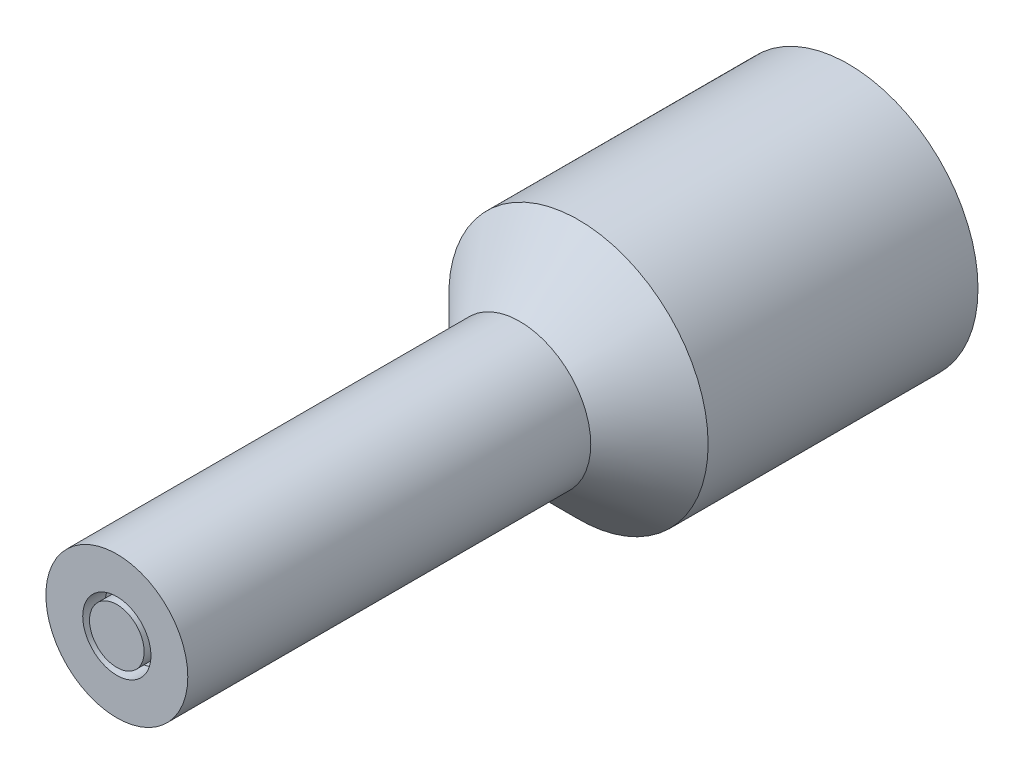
ISO-10303-21;
HEADER;
FILE_DESCRIPTION(('STEP AP214'),'2;1');
FILE_NAME('part.step','',(''),(''),'','','');
FILE_SCHEMA(('AUTOMOTIVE_DESIGN { 1 0 10303 214 1 1 1 1 }'));
ENDSEC;
DATA;
#1=APPLICATION_CONTEXT('core data for automotive mechanical design processes');
#2=APPLICATION_PROTOCOL_DEFINITION('international standard','automotive_design',2000,#1);
#3=PRODUCT_CONTEXT('',#1,'mechanical');
#4=PRODUCT('Part','Part','',(#3));
#5=PRODUCT_RELATED_PRODUCT_CATEGORY('part','',(#4));
#6=PRODUCT_DEFINITION_FORMATION('','',#4);
#7=PRODUCT_DEFINITION_CONTEXT('part definition',#1,'design');
#8=PRODUCT_DEFINITION('design','',#6,#7);
#9=PRODUCT_DEFINITION_SHAPE('','',#8);
#10=(LENGTH_UNIT() NAMED_UNIT(*) SI_UNIT(.MILLI.,.METRE.));
#11=(NAMED_UNIT(*) PLANE_ANGLE_UNIT() SI_UNIT($,.RADIAN.));
#12=(NAMED_UNIT(*) SI_UNIT($,.STERADIAN.) SOLID_ANGLE_UNIT());
#13=UNCERTAINTY_MEASURE_WITH_UNIT(LENGTH_MEASURE(1.E-05),#10,'distance_accuracy_value','');
#14=(GEOMETRIC_REPRESENTATION_CONTEXT(3) GLOBAL_UNCERTAINTY_ASSIGNED_CONTEXT((#13)) GLOBAL_UNIT_ASSIGNED_CONTEXT((#10,
#11,#12)) REPRESENTATION_CONTEXT('',''));
#15=CARTESIAN_POINT('',(0.,0.,0.));
#16=DIRECTION('',(0.,0.,1.));
#17=DIRECTION('',(1.,0.,0.));
#18=AXIS2_PLACEMENT_3D('',#15,#16,#17);
#19=CARTESIAN_POINT('',(0.,16.5100000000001,175.260000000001));
#20=DIRECTION('',(0.,0.,-1.));
#21=DIRECTION('',(-1.,0.,0.));
#22=AXIS2_PLACEMENT_3D('',#19,#20,#21);
#23=PLANE('',#22);
#24=CARTESIAN_POINT('',(0.,0.,175.260000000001));
#25=DIRECTION('',(0.,0.,1.));
#26=DIRECTION('',(1.,0.,0.));
#27=AXIS2_PLACEMENT_3D('',#24,#25,#26);
#28=CIRCLE('',#27,16.5100000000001);
#29=CARTESIAN_POINT('',(16.5100000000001,0.,175.260000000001));
#30=VERTEX_POINT('',#29);
#31=EDGE_CURVE('E806',#30,#30,#28,.T.);
#32=ORIENTED_EDGE('',*,*,#31,.T.);
#33=EDGE_LOOP('',(#32));
#34=FACE_BOUND('',#33,.T.);
#35=CARTESIAN_POINT('',(0.,0.,175.260000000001));
#36=DIRECTION('',(0.,0.,-1.));
#37=DIRECTION('',(-1.,0.,0.));
#38=AXIS2_PLACEMENT_3D('',#35,#36,#37);
#39=CIRCLE('',#38,7.93749999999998);
#40=CARTESIAN_POINT('',(-7.93749999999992,0.,175.260000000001));
#41=VERTEX_POINT('',#40);
#42=EDGE_CURVE('E39',#41,#41,#39,.F.);
#43=ORIENTED_EDGE('',*,*,#42,.F.);
#44=EDGE_LOOP('',(#43));
#45=FACE_BOUND('',#44,.T.);
#46=ADVANCED_FACE('F35',(#34,#45),#23,.F.);
#47=CARTESIAN_POINT('',(0.,0.,67.8640902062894));
#48=DIRECTION('',(0.,0.,-1.));
#49=DIRECTION('',(-1.,0.,0.));
#50=AXIS2_PLACEMENT_3D('',#47,#48,#49);
#51=CONICAL_SURFACE('',#50,30.1625000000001,0.785398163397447);
#52=CARTESIAN_POINT('',(0.,0.,81.5165902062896));
#53=DIRECTION('',(0.,0.,1.));
#54=DIRECTION('',(1.,0.,0.));
#55=AXIS2_PLACEMENT_3D('',#52,#53,#54);
#56=CIRCLE('',#55,16.5099999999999);
#57=CARTESIAN_POINT('',(16.5099999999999,0.,81.5165902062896));
#58=VERTEX_POINT('',#57);
#59=EDGE_CURVE('E809',#58,#58,#56,.T.);
#60=ORIENTED_EDGE('',*,*,#59,.F.);
#61=EDGE_LOOP('',(#60));
#62=FACE_BOUND('',#61,.T.);
#63=CARTESIAN_POINT('',(0.,0.,67.8640902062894));
#64=DIRECTION('',(0.,0.,1.));
#65=DIRECTION('',(1.,0.,0.));
#66=AXIS2_PLACEMENT_3D('',#63,#64,#65);
#67=CIRCLE('',#66,30.1625000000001);
#68=CARTESIAN_POINT('',(30.1625000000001,0.,67.8640902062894));
#69=VERTEX_POINT('',#68);
#70=EDGE_CURVE('E11',#69,#69,#67,.T.);
#71=ORIENTED_EDGE('',*,*,#70,.T.);
#72=EDGE_LOOP('',(#71));
#73=FACE_BOUND('',#72,.T.);
#74=ADVANCED_FACE('F37',(#62,#73),#51,.T.);
#75=CARTESIAN_POINT('',(0.,0.,0.));
#76=DIRECTION('',(0.,0.,1.));
#77=DIRECTION('',(1.,0.,0.));
#78=AXIS2_PLACEMENT_3D('',#75,#76,#77);
#79=CYLINDRICAL_SURFACE('',#78,30.1625000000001);
#80=ORIENTED_EDGE('',*,*,#70,.F.);
#81=EDGE_LOOP('',(#80));
#82=FACE_BOUND('',#81,.T.);
#83=CARTESIAN_POINT('',(0.,0.,5.0799999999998));
#84=DIRECTION('',(0.,0.,1.));
#85=DIRECTION('',(1.,0.,0.));
#86=AXIS2_PLACEMENT_3D('',#83,#84,#85);
#87=CIRCLE('',#86,30.1625000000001);
#88=CARTESIAN_POINT('',(30.1625000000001,0.,5.0799999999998));
#89=VERTEX_POINT('',#88);
#90=EDGE_CURVE('E44',#89,#89,#87,.T.);
#91=ORIENTED_EDGE('',*,*,#90,.T.);
#92=EDGE_LOOP('',(#91));
#93=FACE_BOUND('',#92,.T.);
#94=ADVANCED_FACE('F794',(#82,#93),#79,.T.);
#95=CARTESIAN_POINT('',(0.,30.1625000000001,5.0799999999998));
#96=DIRECTION('',(0.,0.,1.));
#97=DIRECTION('',(1.,0.,0.));
#98=AXIS2_PLACEMENT_3D('',#95,#96,#97);
#99=PLANE('',#98);
#100=ORIENTED_EDGE('',*,*,#90,.F.);
#101=EDGE_LOOP('',(#100));
#102=FACE_BOUND('',#101,.T.);
#103=ADVANCED_FACE('F788',(#102),#99,.F.);
#104=CARTESIAN_POINT('',(0.,0.,0.));
#105=DIRECTION('',(0.,0.,1.));
#106=DIRECTION('',(1.,0.,0.));
#107=AXIS2_PLACEMENT_3D('',#104,#105,#106);
#108=CYLINDRICAL_SURFACE('',#107,16.51);
#109=ORIENTED_EDGE('',*,*,#31,.F.);
#110=EDGE_LOOP('',(#109));
#111=FACE_BOUND('',#110,.T.);
#112=ORIENTED_EDGE('',*,*,#59,.T.);
#113=EDGE_LOOP('',(#112));
#114=FACE_BOUND('',#113,.T.);
#115=ADVANCED_FACE('F695',(#111,#114),#108,.T.);
#116=CARTESIAN_POINT('',(0.,0.,116.8434036));
#117=DIRECTION('',(0.,0.,-1.));
#118=DIRECTION('',(-0.0959236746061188,-0.995388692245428,0.));
#119=AXIS2_PLACEMENT_3D('',#116,#117,#118);
#120=CYLINDRICAL_SURFACE('',#119,7.93749999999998);
#121=CARTESIAN_POINT('',(0.,0.,170.053));
#122=DIRECTION('',(0.,0.,-1.));
#123=DIRECTION('',(0.,1.,0.));
#124=AXIS2_PLACEMENT_3D('',#121,#122,#123);
#125=CIRCLE('',#124,7.93749999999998);
#126=CARTESIAN_POINT('',(0.,7.93750000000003,170.053));
#127=VERTEX_POINT('',#126);
#128=EDGE_CURVE('E832',#127,#127,#125,.T.);
#129=ORIENTED_EDGE('',*,*,#128,.T.);
#130=EDGE_LOOP('',(#129));
#131=FACE_BOUND('',#130,.T.);
#132=ORIENTED_EDGE('',*,*,#42,.T.);
#133=EDGE_LOOP('',(#132));
#134=FACE_BOUND('',#133,.T.);
#135=ADVANCED_FACE('F691',(#131,#134),#120,.F.);
#136=CARTESIAN_POINT('',(0.,0.,116.8434036));
#137=DIRECTION('',(0.,0.,-1.));
#138=DIRECTION('',(-0.0959236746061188,-0.995388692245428,0.));
#139=AXIS2_PLACEMENT_3D('',#136,#137,#138);
#140=CYLINDRICAL_SURFACE('',#139,6.35000000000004);
#141=CARTESIAN_POINT('',(0.,0.,124.768203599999));
#142=DIRECTION('',(0.,0.,-1.));
#143=DIRECTION('',(-1.,0.,0.));
#144=AXIS2_PLACEMENT_3D('',#141,#142,#143);
#145=CIRCLE('',#144,6.35000000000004);
#146=CARTESIAN_POINT('',(-6.35,0.,124.768203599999));
#147=VERTEX_POINT('',#146);
#148=EDGE_CURVE('E1093',#147,#147,#145,.F.);
#149=ORIENTED_EDGE('',*,*,#148,.T.);
#150=EDGE_LOOP('',(#149));
#151=FACE_BOUND('',#150,.T.);
#152=CARTESIAN_POINT('',(-0.609115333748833,-6.32071819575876,143.830903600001));
#153=CARTESIAN_POINT('',(-0.696421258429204,-6.3123032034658,143.830901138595));
#154=CARTESIAN_POINT('',(-0.78357878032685,-6.30206160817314,143.823610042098));
#155=CARTESIAN_POINT('',(-0.955057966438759,-6.2783653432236,143.794681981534));
#156=CARTESIAN_POINT('',(-1.03937799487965,-6.26490885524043,143.773036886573));
#157=CARTESIAN_POINT('',(-1.20272749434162,-6.23560965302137,143.71613872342));
#158=CARTESIAN_POINT('',(-1.28176318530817,-6.21976981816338,143.68090199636));
#159=CARTESIAN_POINT('',(-1.43262481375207,-6.18676466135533,143.597878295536));
#160=CARTESIAN_POINT('',(-1.50445050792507,-6.16959929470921,143.550090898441));
#161=CARTESIAN_POINT('',(-1.64040867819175,-6.13486585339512,143.442282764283));
#162=CARTESIAN_POINT('',(-1.70437436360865,-6.1172962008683,143.382052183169));
#163=CARTESIAN_POINT('',(-1.82146481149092,-6.08346025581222,143.251516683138));
#164=CARTESIAN_POINT('',(-1.87458834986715,-6.067194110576,143.181210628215));
#165=CARTESIAN_POINT('',(-1.96933634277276,-6.03711271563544,143.031231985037));
#166=CARTESIAN_POINT('',(-2.01077824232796,-6.02333746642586,142.95143576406));
#167=CARTESIAN_POINT('',(-2.0799026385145,-5.99982060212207,142.785536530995));
#168=CARTESIAN_POINT('',(-2.10758733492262,-5.99007834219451,142.699434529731));
#169=CARTESIAN_POINT('',(-2.14792283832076,-5.97573266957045,142.525191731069));
#170=CARTESIAN_POINT('',(-2.16086371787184,-5.97103021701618,142.437126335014));
#171=CARTESIAN_POINT('',(-2.17227658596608,-5.96688815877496,142.25994686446));
#172=CARTESIAN_POINT('',(-2.17075092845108,-5.96744769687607,142.170832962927));
#173=CARTESIAN_POINT('',(-2.15350144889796,-5.97369302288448,141.996371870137));
#174=CARTESIAN_POINT('',(-2.1381226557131,-5.97925423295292,141.91098573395));
#175=CARTESIAN_POINT('',(-2.09412103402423,-5.99480578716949,141.744123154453));
#176=CARTESIAN_POINT('',(-2.06549726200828,-6.00479644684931,141.662646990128));
#177=CARTESIAN_POINT('',(-1.99546653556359,-6.02843142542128,141.504964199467));
#178=CARTESIAN_POINT('',(-1.95393345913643,-6.04211160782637,141.42881906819));
#179=CARTESIAN_POINT('',(-1.85927372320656,-6.07190717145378,141.284639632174));
#180=CARTESIAN_POINT('',(-1.80614503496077,-6.08802297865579,141.216606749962));
#181=CARTESIAN_POINT('',(-1.6879180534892,-6.12187160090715,141.088546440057));
#182=CARTESIAN_POINT('',(-1.62252165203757,-6.13963742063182,141.028802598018));
#183=CARTESIAN_POINT('',(-1.48245773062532,-6.17495161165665,140.921311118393));
#184=CARTESIAN_POINT('',(-1.40778992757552,-6.19249997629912,140.873563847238));
#185=CARTESIAN_POINT('',(-1.25082157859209,-6.22610642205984,140.791316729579));
#186=CARTESIAN_POINT('',(-1.16849569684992,-6.24215917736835,140.756862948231));
#187=CARTESIAN_POINT('',(-0.998707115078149,-6.27156257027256,140.702557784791));
#188=CARTESIAN_POINT('',(-0.911245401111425,-6.28491372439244,140.682703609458));
#189=CARTESIAN_POINT('',(-0.736033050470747,-6.30780158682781,140.658594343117));
#190=CARTESIAN_POINT('',(-0.648347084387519,-6.31742716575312,140.65395306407));
#191=CARTESIAN_POINT('',(-0.473102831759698,-6.33296215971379,140.659342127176));
#192=CARTESIAN_POINT('',(-0.385544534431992,-6.33887190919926,140.66937114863));
#193=CARTESIAN_POINT('',(-0.214402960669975,-6.34694948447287,140.703497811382));
#194=CARTESIAN_POINT('',(-0.130780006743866,-6.34917146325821,140.727384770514));
#195=CARTESIAN_POINT('',(0.0315518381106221,-6.35044088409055,140.788308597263));
#196=CARTESIAN_POINT('',(0.110260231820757,-6.34948800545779,140.825346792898));
#197=CARTESIAN_POINT('',(0.262012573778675,-6.34505471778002,140.912270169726));
#198=CARTESIAN_POINT('',(0.334931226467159,-6.34152975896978,140.962371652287));
#199=CARTESIAN_POINT('',(0.47158815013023,-6.33283517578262,141.073722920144));
#200=CARTESIAN_POINT('',(0.535324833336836,-6.32766526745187,141.134974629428));
#201=CARTESIAN_POINT('',(0.653334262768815,-6.3165860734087,141.268680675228));
#202=CARTESIAN_POINT('',(0.707336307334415,-6.31066175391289,141.341373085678));
#203=CARTESIAN_POINT('',(0.802280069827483,-6.29929694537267,141.494878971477));
#204=CARTESIAN_POINT('',(0.843222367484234,-6.29385643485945,141.575692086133));
#205=CARTESIAN_POINT('',(0.910500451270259,-6.28447637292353,141.742712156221));
#206=CARTESIAN_POINT('',(0.936922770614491,-6.2805279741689,141.828883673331));
#207=CARTESIAN_POINT('',(0.974583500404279,-6.27479535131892,142.004547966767));
#208=CARTESIAN_POINT('',(0.985825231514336,-6.27301065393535,142.094040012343));
#209=CARTESIAN_POINT('',(0.992607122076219,-6.27194074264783,142.271048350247));
#210=CARTESIAN_POINT('',(0.98858904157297,-6.27258520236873,142.358547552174));
#211=CARTESIAN_POINT('',(0.965984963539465,-6.2761055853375,142.531591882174));
#212=CARTESIAN_POINT('',(0.947399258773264,-6.27898146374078,142.617137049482));
#213=CARTESIAN_POINT('',(0.896466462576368,-6.28645363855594,142.783374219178));
#214=CARTESIAN_POINT('',(0.864201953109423,-6.29103959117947,142.86409208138));
#215=CARTESIAN_POINT('',(0.786953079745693,-6.30116780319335,143.019125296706));
#216=CARTESIAN_POINT('',(0.741966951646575,-6.30671019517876,143.093439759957));
#217=CARTESIAN_POINT('',(0.639249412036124,-6.31795782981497,143.235648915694));
#218=CARTESIAN_POINT('',(0.5812161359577,-6.32366354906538,143.303325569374));
#219=CARTESIAN_POINT('',(0.454742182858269,-6.33401358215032,143.428257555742));
#220=CARTESIAN_POINT('',(0.386299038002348,-6.33865764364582,143.485510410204));
#221=CARTESIAN_POINT('',(0.239542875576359,-6.34591264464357,143.588980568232));
#222=CARTESIAN_POINT('',(0.161073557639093,-6.34848523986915,143.634979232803));
#223=CARTESIAN_POINT('',(-0.00247044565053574,-6.35052437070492,143.713161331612));
#224=CARTESIAN_POINT('',(-0.0875403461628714,-6.34999313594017,143.745354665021));
#225=CARTESIAN_POINT('',(-0.245328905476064,-6.34565421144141,143.7902337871));
#226=CARTESIAN_POINT('',(-0.317355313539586,-6.34248260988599,143.805451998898));
#227=CARTESIAN_POINT('',(-0.462661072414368,-6.33354099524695,143.825787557));
#228=CARTESIAN_POINT('',(-0.535940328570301,-6.32777117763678,143.830905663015));
#229=CARTESIAN_POINT('',(-0.609115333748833,-6.32071819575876,143.830903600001));
#230=B_SPLINE_CURVE_WITH_KNOTS('',3,(#152,#153,#154,#155,#156,#157,#158,#159,#160,#161,#162,
#163,#164,#165,#166,#167,#168,#169,#170,#171,#172,#173,#174,#175,#176,#177,#178,#179,#180,#181,
#182,#183,#184,#185,#186,#187,#188,#189,#190,#191,#192,#193,#194,#195,#196,#197,#198,#199,#200,
#201,#202,#203,#204,#205,#206,#207,#208,#209,#210,#211,#212,#213,#214,#215,#216,#217,#218,#219,
#220,#221,#222,#223,#224,#225,#226,#227,#228,#229),.UNSPECIFIED.,.T.,.F.,(4,2,2,2,2,2,2,2,2,2,2,
2,2,2,2,2,2,2,2,2,2,2,2,2,2,2,2,2,2,2,2,2,2,2,2,2,2,2,4),(0.,0.262862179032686,
0.525873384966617,0.788569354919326,1.05127418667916,1.31883610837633,1.58642822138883,
1.85799568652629,2.12951971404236,2.39560412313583,2.66164523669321,2.92123809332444,
3.18084944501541,3.44308141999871,3.70535931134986,3.97511588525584,4.24488069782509,
4.51557209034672,4.78621167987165,5.04992543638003,5.31361545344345,5.57339790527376,
5.83320659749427,6.09762546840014,6.36209000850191,6.63304605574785,6.9039900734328,
7.17330136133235,7.4425537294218,7.70407167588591,7.96558436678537,8.22554023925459,
8.48553217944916,8.75230635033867,9.01914386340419,9.29081396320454,9.56228893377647,
9.7826220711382,10.0029386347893),.UNSPECIFIED.);
#231=CARTESIAN_POINT('',(-0.609115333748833,-6.32071819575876,143.830903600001));
#232=VERTEX_POINT('',#231);
#233=EDGE_CURVE('E672',#232,#232,#230,.T.);
#234=ORIENTED_EDGE('',*,*,#233,.F.);
#235=EDGE_LOOP('',(#234));
#236=FACE_BOUND('',#235,.T.);
#237=CARTESIAN_POINT('',(0.609115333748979,6.32071819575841,143.8309036));
#238=CARTESIAN_POINT('',(0.696421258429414,6.31230320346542,143.830901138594));
#239=CARTESIAN_POINT('',(0.783578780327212,6.30206160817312,143.823610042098));
#240=CARTESIAN_POINT('',(0.955057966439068,6.27836534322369,143.794681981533));
#241=CARTESIAN_POINT('',(1.03937799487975,6.26490885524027,143.773036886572));
#242=CARTESIAN_POINT('',(1.20272749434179,6.23560965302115,143.716138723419));
#243=CARTESIAN_POINT('',(1.28176318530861,6.21976981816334,143.68090199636));
#244=CARTESIAN_POINT('',(1.43262481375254,6.18676466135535,143.597878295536));
#245=CARTESIAN_POINT('',(1.50445050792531,6.16959929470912,143.550090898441));
#246=CARTESIAN_POINT('',(1.64040867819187,6.13486585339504,143.442282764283));
#247=CARTESIAN_POINT('',(1.70437436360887,6.11729620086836,143.382052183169));
#248=CARTESIAN_POINT('',(1.82146481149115,6.08346025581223,143.251516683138));
#249=CARTESIAN_POINT('',(1.8745883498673,6.06719411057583,143.181210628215));
#250=CARTESIAN_POINT('',(1.96933634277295,6.03711271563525,143.031231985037));
#251=CARTESIAN_POINT('',(2.01077824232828,6.02333746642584,142.951435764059));
#252=CARTESIAN_POINT('',(2.07990263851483,5.99982060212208,142.785536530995));
#253=CARTESIAN_POINT('',(2.10758733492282,5.99007834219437,142.69943452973));
#254=CARTESIAN_POINT('',(2.1479228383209,5.97573266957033,142.525191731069));
#255=CARTESIAN_POINT('',(2.16086371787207,5.97103021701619,142.437126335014));
#256=CARTESIAN_POINT('',(2.17227658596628,5.966888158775,142.259946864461));
#257=CARTESIAN_POINT('',(2.17075092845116,5.96744769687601,142.170832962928));
#258=CARTESIAN_POINT('',(2.15350144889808,5.97369302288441,141.996371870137));
#259=CARTESIAN_POINT('',(2.1381226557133,5.97925423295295,141.91098573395));
#260=CARTESIAN_POINT('',(2.09412103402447,5.99480578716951,141.744123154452));
#261=CARTESIAN_POINT('',(2.06549726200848,6.00479644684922,141.662646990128));
#262=CARTESIAN_POINT('',(1.99546653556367,6.0284314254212,141.504964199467));
#263=CARTESIAN_POINT('',(1.95393345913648,6.04211160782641,141.428819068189));
#264=CARTESIAN_POINT('',(1.85927372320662,6.0719071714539,141.284639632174));
#265=CARTESIAN_POINT('',(1.80614503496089,6.08802297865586,141.216606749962));
#266=CARTESIAN_POINT('',(1.68791805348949,6.12187160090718,141.088546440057));
#267=CARTESIAN_POINT('',(1.62252165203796,6.13963742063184,141.028802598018));
#268=CARTESIAN_POINT('',(1.48245773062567,6.17495161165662,140.921311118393));
#269=CARTESIAN_POINT('',(1.40778992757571,6.19249997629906,140.873563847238));
#270=CARTESIAN_POINT('',(1.25082157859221,6.22610642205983,140.79131672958));
#271=CARTESIAN_POINT('',(1.16849569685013,6.24215917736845,140.756862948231));
#272=CARTESIAN_POINT('',(0.998707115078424,6.27156257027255,140.702557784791));
#273=CARTESIAN_POINT('',(0.911245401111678,6.28491372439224,140.682703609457));
#274=CARTESIAN_POINT('',(0.736033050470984,6.30780158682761,140.658594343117));
#275=CARTESIAN_POINT('',(0.648347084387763,6.3174271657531,140.65395306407));
#276=CARTESIAN_POINT('',(0.473102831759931,6.33296215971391,140.659342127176));
#277=CARTESIAN_POINT('',(0.385544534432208,6.33887190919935,140.66937114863));
#278=CARTESIAN_POINT('',(0.214402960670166,6.34694948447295,140.703497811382));
#279=CARTESIAN_POINT('',(0.130780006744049,6.34917146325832,140.727384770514));
#280=CARTESIAN_POINT('',(-0.0315518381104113,6.35044088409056,140.788308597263));
#281=CARTESIAN_POINT('',(-0.11026023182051,6.34948800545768,140.825346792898));
#282=CARTESIAN_POINT('',(-0.262012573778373,6.34505471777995,140.912270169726));
#283=CARTESIAN_POINT('',(-0.33493122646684,6.34152975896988,140.962371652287));
#284=CARTESIAN_POINT('',(-0.471588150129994,6.33283517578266,141.073722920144));
#285=CARTESIAN_POINT('',(-0.5353248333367,6.32766526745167,141.134974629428));
#286=CARTESIAN_POINT('',(-0.653334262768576,6.31658607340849,141.268680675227));
#287=CARTESIAN_POINT('',(-0.707336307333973,6.31066175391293,141.341373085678));
#288=CARTESIAN_POINT('',(-0.802280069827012,6.29929694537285,141.494878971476));
#289=CARTESIAN_POINT('',(-0.843222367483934,6.29385643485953,141.575692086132));
#290=CARTESIAN_POINT('',(-0.910500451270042,6.2844763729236,141.74271215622));
#291=CARTESIAN_POINT('',(-0.936922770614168,6.28052797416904,141.828883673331));
#292=CARTESIAN_POINT('',(-0.974583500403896,6.27479535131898,142.004547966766));
#293=CARTESIAN_POINT('',(-0.985825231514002,6.27301065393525,142.094040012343));
#294=CARTESIAN_POINT('',(-0.992607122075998,6.27194074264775,142.271048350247));
#295=CARTESIAN_POINT('',(-0.988589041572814,6.2725852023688,142.358547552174));
#296=CARTESIAN_POINT('',(-0.965984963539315,6.27610558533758,142.531591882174));
#297=CARTESIAN_POINT('',(-0.947399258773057,6.2789814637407,142.617137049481));
#298=CARTESIAN_POINT('',(-0.896466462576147,6.28645363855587,142.783374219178));
#299=CARTESIAN_POINT('',(-0.864201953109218,6.29103959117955,142.86409208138));
#300=CARTESIAN_POINT('',(-0.786953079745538,6.30116780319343,143.019125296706));
#301=CARTESIAN_POINT('',(-0.741966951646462,6.30671019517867,143.093439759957));
#302=CARTESIAN_POINT('',(-0.639249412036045,6.31795782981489,143.235648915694));
#303=CARTESIAN_POINT('',(-0.581216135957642,6.32366354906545,143.303325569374));
#304=CARTESIAN_POINT('',(-0.454742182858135,6.33401358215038,143.428257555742));
#305=CARTESIAN_POINT('',(-0.386299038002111,6.33865764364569,143.485510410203));
#306=CARTESIAN_POINT('',(-0.23954287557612,6.34591264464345,143.588980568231));
#307=CARTESIAN_POINT('',(-0.161073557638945,6.34848523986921,143.634979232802));
#308=CARTESIAN_POINT('',(0.00247044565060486,6.35052437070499,143.713161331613));
#309=CARTESIAN_POINT('',(0.0875403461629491,6.34999313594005,143.745354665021));
#310=CARTESIAN_POINT('',(0.245328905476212,6.34565421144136,143.7902337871));
#311=CARTESIAN_POINT('',(0.317355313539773,6.34248260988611,143.805451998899));
#312=CARTESIAN_POINT('',(0.462661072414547,6.33354099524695,143.825787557));
#313=CARTESIAN_POINT('',(0.535940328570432,6.32777117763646,143.830905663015));
#314=CARTESIAN_POINT('',(0.609115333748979,6.32071819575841,143.8309036));
#315=B_SPLINE_CURVE_WITH_KNOTS('',3,(#237,#238,#239,#240,#241,#242,#243,#244,#245,#246,#247,
#248,#249,#250,#251,#252,#253,#254,#255,#256,#257,#258,#259,#260,#261,#262,#263,#264,#265,#266,
#267,#268,#269,#270,#271,#272,#273,#274,#275,#276,#277,#278,#279,#280,#281,#282,#283,#284,#285,
#286,#287,#288,#289,#290,#291,#292,#293,#294,#295,#296,#297,#298,#299,#300,#301,#302,#303,#304,
#305,#306,#307,#308,#309,#310,#311,#312,#313,#314),.UNSPECIFIED.,.T.,.F.,(4,2,2,2,2,2,2,2,2,2,2,
2,2,2,2,2,2,2,2,2,2,2,2,2,2,2,2,2,2,2,2,2,2,2,2,2,2,2,4),(0.,0.262862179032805,
0.525873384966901,0.788569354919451,1.05127418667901,1.31883610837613,1.58642822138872,
1.85799568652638,2.12951971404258,2.39560412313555,2.66164523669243,2.92123809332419,
3.18084944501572,3.44308141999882,3.70535931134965,3.97511588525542,4.24488069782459,
4.51557209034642,4.78621167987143,5.04992543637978,5.31361545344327,5.57339790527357,
5.83320659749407,6.09762546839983,6.3620900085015,6.63304605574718,6.90399007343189,
7.17330136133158,7.4425537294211,7.70407167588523,7.96558436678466,8.22554023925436,
8.48553217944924,8.75230635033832,9.01914386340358,9.29081396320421,9.5622889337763,
9.78262207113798,10.002938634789),.UNSPECIFIED.);
#316=CARTESIAN_POINT('',(0.609115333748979,6.32071819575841,143.8309036));
#317=VERTEX_POINT('',#316);
#318=EDGE_CURVE('E664',#317,#317,#315,.T.);
#319=ORIENTED_EDGE('',*,*,#318,.F.);
#320=EDGE_LOOP('',(#319));
#321=FACE_BOUND('',#320,.T.);
#322=CARTESIAN_POINT('',(0.,0.,175.260000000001));
#323=DIRECTION('',(0.,0.,-1.));
#324=DIRECTION('',(-1.,0.,0.));
#325=AXIS2_PLACEMENT_3D('',#322,#323,#324);
#326=CIRCLE('',#325,6.35000000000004);
#327=CARTESIAN_POINT('',(-6.34999999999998,0.,175.260000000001));
#328=VERTEX_POINT('',#327);
#329=EDGE_CURVE('E812',#328,#328,#326,.T.);
#330=ORIENTED_EDGE('',*,*,#329,.T.);
#331=EDGE_LOOP('',(#330));
#332=FACE_BOUND('',#331,.T.);
#333=ADVANCED_FACE('F658',(#151,#236,#321,#332),#140,.T.);
#334=CARTESIAN_POINT('',(20.955,-20.955,57.7850000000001));
#335=DIRECTION('',(0.,0.,1.));
#336=DIRECTION('',(1.,0.,0.));
#337=AXIS2_PLACEMENT_3D('',#334,#335,#336);
#338=PLANE('',#337);
#339=CARTESIAN_POINT('',(-15.4939999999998,15.501470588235,57.7850000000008));
#340=DIRECTION('',(0.,0.,1.));
#341=DIRECTION('',(0.999999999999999,0.,0.));
#342=AXIS2_PLACEMENT_3D('',#339,#340,#341);
#343=CIRCLE('',#342,1.4097);
#344=CARTESIAN_POINT('',(-16.4756474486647,14.4897283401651,57.7850000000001));
#345=VERTEX_POINT('',#344);
#346=CARTESIAN_POINT('',(-14.588552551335,16.5819422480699,57.7850000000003));
#347=VERTEX_POINT('',#346);
#348=EDGE_CURVE('E398',#345,#347,#343,.T.);
#349=ORIENTED_EDGE('',*,*,#348,.F.);
#350=CARTESIAN_POINT('',(-15.5702,15.5702,57.7850000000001));
#351=DIRECTION('',(0.,0.,1.));
#352=DIRECTION('',(1.,0.,0.));
#353=AXIS2_PLACEMENT_3D('',#350,#351,#352);
#354=CIRCLE('',#353,1.4097);
#355=EDGE_CURVE('E901',#345,#347,#354,.T.);
#356=ORIENTED_EDGE('',*,*,#355,.T.);
#357=EDGE_LOOP('',(#349,#356));
#358=FACE_BOUND('',#357,.T.);
#359=ADVANCED_FACE('F771',(#358),#338,.F.);
#360=CARTESIAN_POINT('',(15.4940000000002,15.5014705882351,57.7850000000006));
#361=DIRECTION('',(0.,0.,1.));
#362=DIRECTION('',(0.999999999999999,0.,0.));
#363=AXIS2_PLACEMENT_3D('',#360,#361,#362);
#364=CIRCLE('',#363,1.4097);
#365=CARTESIAN_POINT('',(14.5885525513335,16.5819422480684,57.7850000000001));
#366=VERTEX_POINT('',#365);
#367=CARTESIAN_POINT('',(16.4756474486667,14.4897283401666,57.7850000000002));
#368=VERTEX_POINT('',#367);
#369=EDGE_CURVE('E392',#366,#368,#364,.T.);
#370=ORIENTED_EDGE('',*,*,#369,.F.);
#371=CARTESIAN_POINT('',(15.5702,15.5702,57.7850000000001));
#372=DIRECTION('',(0.,0.,-1.));
#373=DIRECTION('',(-1.,0.,0.));
#374=AXIS2_PLACEMENT_3D('',#371,#372,#373);
#375=CIRCLE('',#374,1.4097);
#376=EDGE_CURVE('E870',#368,#366,#375,.T.);
#377=ORIENTED_EDGE('',*,*,#376,.F.);
#378=EDGE_LOOP('',(#370,#377));
#379=FACE_BOUND('',#378,.T.);
#380=ADVANCED_FACE('F1566',(#379),#338,.F.);
#381=CARTESIAN_POINT('',(15.4940000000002,-15.4939999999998,57.7850000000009));
#382=DIRECTION('',(0.,0.,1.));
#383=DIRECTION('',(0.999999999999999,0.,0.));
#384=AXIS2_PLACEMENT_3D('',#381,#382,#383);
#385=CIRCLE('',#384,1.4097);
#386=CARTESIAN_POINT('',(16.5281800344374,-14.5360199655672,57.7850000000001));
#387=VERTEX_POINT('',#386);
#388=CARTESIAN_POINT('',(14.5360199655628,-16.5281800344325,57.7850000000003));
#389=VERTEX_POINT('',#388);
#390=EDGE_CURVE('E385',#387,#389,#385,.T.);
#391=ORIENTED_EDGE('',*,*,#390,.F.);
#392=CARTESIAN_POINT('',(15.5702,-15.5702,57.7850000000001));
#393=DIRECTION('',(0.,0.,1.));
#394=DIRECTION('',(1.,0.,0.));
#395=AXIS2_PLACEMENT_3D('',#392,#393,#394);
#396=CIRCLE('',#395,1.4097);
#397=EDGE_CURVE('E859',#387,#389,#396,.T.);
#398=ORIENTED_EDGE('',*,*,#397,.T.);
#399=EDGE_LOOP('',(#391,#398));
#400=FACE_BOUND('',#399,.T.);
#401=ADVANCED_FACE('F1574',(#400),#338,.F.);
#402=CARTESIAN_POINT('',(-15.4939999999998,-15.4939999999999,57.7850000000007));
#403=DIRECTION('',(0.,0.,1.));
#404=DIRECTION('',(0.999999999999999,0.,0.));
#405=AXIS2_PLACEMENT_3D('',#402,#403,#404);
#406=CIRCLE('',#405,1.4097);
#407=CARTESIAN_POINT('',(-14.5360199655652,-16.5281800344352,57.7850000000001));
#408=VERTEX_POINT('',#407);
#409=CARTESIAN_POINT('',(-16.5281800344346,-14.5360199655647,57.7850000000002));
#410=VERTEX_POINT('',#409);
#411=EDGE_CURVE('E377',#408,#410,#406,.T.);
#412=ORIENTED_EDGE('',*,*,#411,.F.);
#413=CARTESIAN_POINT('',(-15.5702,-15.5702,57.7850000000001));
#414=DIRECTION('',(0.,0.,-1.));
#415=DIRECTION('',(-1.,0.,0.));
#416=AXIS2_PLACEMENT_3D('',#413,#414,#415);
#417=CIRCLE('',#416,1.4097);
#418=EDGE_CURVE('E904',#410,#408,#417,.T.);
#419=ORIENTED_EDGE('',*,*,#418,.F.);
#420=EDGE_LOOP('',(#412,#419));
#421=FACE_BOUND('',#420,.T.);
#422=ADVANCED_FACE('F766',(#421),#338,.F.);
#423=CARTESIAN_POINT('',(20.955,-20.955,10.1600000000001));
#424=DIRECTION('',(0.,0.,1.));
#425=DIRECTION('',(1.,0.,0.));
#426=AXIS2_PLACEMENT_3D('',#423,#424,#425);
#427=PLANE('',#426);
#428=DIRECTION('',(0.707106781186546,0.707106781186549,0.));
#429=VECTOR('',#428,1.);
#430=CARTESIAN_POINT('',(-20.740974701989,15.9044852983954,10.1600000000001));
#431=LINE('',#430,#429);
#432=CARTESIAN_POINT('',(-20.955,15.6904600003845,10.1600000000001));
#433=VERTEX_POINT('',#432);
#434=CARTESIAN_POINT('',(-15.6904600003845,20.955,10.1600000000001));
#435=VERTEX_POINT('',#434);
#436=EDGE_CURVE('E869',#433,#435,#431,.T.);
#437=ORIENTED_EDGE('',*,*,#436,.F.);
#438=DIRECTION('',(0.,1.,0.));
#439=VECTOR('',#438,1.);
#440=CARTESIAN_POINT('',(-20.955,-20.955,10.1600000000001));
#441=LINE('',#440,#439);
#442=CARTESIAN_POINT('',(-20.955,-15.6904600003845,10.1600000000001));
#443=VERTEX_POINT('',#442);
#444=EDGE_CURVE('E922',#443,#433,#441,.T.);
#445=ORIENTED_EDGE('',*,*,#444,.F.);
#446=DIRECTION('',(0.707106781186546,-0.707106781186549,0.));
#447=VECTOR('',#446,1.);
#448=CARTESIAN_POINT('',(-20.740974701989,-15.9044852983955,10.1600000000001));
#449=LINE('',#448,#447);
#450=CARTESIAN_POINT('',(-15.6904600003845,-20.955,10.1600000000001));
#451=VERTEX_POINT('',#450);
#452=EDGE_CURVE('E906',#443,#451,#449,.T.);
#453=ORIENTED_EDGE('',*,*,#452,.T.);
#454=DIRECTION('',(1.,0.,0.));
#455=VECTOR('',#454,1.);
#456=CARTESIAN_POINT('',(-20.955,-20.955,10.1600000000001));
#457=LINE('',#456,#455);
#458=CARTESIAN_POINT('',(15.6904600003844,-20.955,10.1600000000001));
#459=VERTEX_POINT('',#458);
#460=EDGE_CURVE('E919',#451,#459,#457,.T.);
#461=ORIENTED_EDGE('',*,*,#460,.T.);
#462=DIRECTION('',(0.707106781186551,0.707106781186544,0.));
#463=VECTOR('',#462,1.);
#464=CARTESIAN_POINT('',(15.9044852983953,-20.740974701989,10.1600000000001));
#465=LINE('',#464,#463);
#466=CARTESIAN_POINT('',(20.955,-15.6904600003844,10.1600000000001));
#467=VERTEX_POINT('',#466);
#468=EDGE_CURVE('E881',#459,#467,#465,.T.);
#469=ORIENTED_EDGE('',*,*,#468,.T.);
#470=DIRECTION('',(0.,-1.,0.));
#471=VECTOR('',#470,1.);
#472=CARTESIAN_POINT('',(20.955,20.955,10.1600000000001));
#473=LINE('',#472,#471);
#474=CARTESIAN_POINT('',(20.955,15.6904600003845,10.1600000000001));
#475=VERTEX_POINT('',#474);
#476=EDGE_CURVE('E916',#475,#467,#473,.T.);
#477=ORIENTED_EDGE('',*,*,#476,.F.);
#478=DIRECTION('',(-0.707106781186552,0.707106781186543,0.));
#479=VECTOR('',#478,1.);
#480=CARTESIAN_POINT('',(15.9044852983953,20.740974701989,10.1600000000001));
#481=LINE('',#480,#479);
#482=CARTESIAN_POINT('',(15.6904600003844,20.955,10.1600000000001));
#483=VERTEX_POINT('',#482);
#484=EDGE_CURVE('E888',#475,#483,#481,.T.);
#485=ORIENTED_EDGE('',*,*,#484,.T.);
#486=DIRECTION('',(-1.,0.,0.));
#487=VECTOR('',#486,1.);
#488=CARTESIAN_POINT('',(20.955,20.955,10.1600000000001));
#489=LINE('',#488,#487);
#490=EDGE_CURVE('E925',#483,#435,#489,.T.);
#491=ORIENTED_EDGE('',*,*,#490,.T.);
#492=EDGE_LOOP('',(#437,#445,#453,#461,#469,#477,#485,#491));
#493=FACE_BOUND('',#492,.T.);
#494=CARTESIAN_POINT('',(-15.5702,-15.5702,10.1600000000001));
#495=DIRECTION('',(0.,0.,-1.));
#496=DIRECTION('',(-1.,0.,0.));
#497=AXIS2_PLACEMENT_3D('',#494,#495,#496);
#498=CIRCLE('',#497,1.4097);
#499=CARTESIAN_POINT('',(-16.9799,-15.5702,10.1600000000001));
#500=VERTEX_POINT('',#499);
#501=EDGE_CURVE('E900',#500,#500,#498,.T.);
#502=ORIENTED_EDGE('',*,*,#501,.T.);
#503=EDGE_LOOP('',(#502));
#504=FACE_BOUND('',#503,.T.);
#505=CARTESIAN_POINT('',(-15.5702,15.5702,10.1600000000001));
#506=DIRECTION('',(0.,0.,1.));
#507=DIRECTION('',(1.,0.,0.));
#508=AXIS2_PLACEMENT_3D('',#505,#506,#507);
#509=CIRCLE('',#508,1.4097);
#510=CARTESIAN_POINT('',(-14.1605,15.5702,10.1600000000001));
#511=VERTEX_POINT('',#510);
#512=EDGE_CURVE('E896',#511,#511,#509,.T.);
#513=ORIENTED_EDGE('',*,*,#512,.F.);
#514=EDGE_LOOP('',(#513));
#515=FACE_BOUND('',#514,.T.);
#516=CARTESIAN_POINT('',(15.5702,15.5702,10.1600000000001));
#517=DIRECTION('',(0.,0.,-1.));
#518=DIRECTION('',(-1.,0.,0.));
#519=AXIS2_PLACEMENT_3D('',#516,#517,#518);
#520=CIRCLE('',#519,1.4097);
#521=CARTESIAN_POINT('',(14.1605,15.5702,10.1600000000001));
#522=VERTEX_POINT('',#521);
#523=EDGE_CURVE('E862',#522,#522,#520,.T.);
#524=ORIENTED_EDGE('',*,*,#523,.T.);
#525=EDGE_LOOP('',(#524));
#526=FACE_BOUND('',#525,.T.);
#527=CARTESIAN_POINT('',(15.5702,-15.5702,10.1600000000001));
#528=DIRECTION('',(0.,0.,1.));
#529=DIRECTION('',(1.,0.,0.));
#530=AXIS2_PLACEMENT_3D('',#527,#528,#529);
#531=CIRCLE('',#530,1.4097);
#532=CARTESIAN_POINT('',(16.9799,-15.5702,10.1600000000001));
#533=VERTEX_POINT('',#532);
#534=EDGE_CURVE('E858',#533,#533,#531,.T.);
#535=ORIENTED_EDGE('',*,*,#534,.F.);
#536=EDGE_LOOP('',(#535));
#537=FACE_BOUND('',#536,.T.);
#538=ADVANCED_FACE('F762',(#493,#504,#515,#526,#537),#427,.T.);
#539=CARTESIAN_POINT('',(-20.955,-20.955,10.1600000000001));
#540=DIRECTION('',(1.,0.,0.));
#541=DIRECTION('',(0.,0.,-1.));
#542=AXIS2_PLACEMENT_3D('',#539,#540,#541);
#543=PLANE('',#542);
#544=DIRECTION('',(0.,0.,1.));
#545=VECTOR('',#544,1.);
#546=CARTESIAN_POINT('',(-20.955,15.6904600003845,10.1600000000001));
#547=LINE('',#546,#545);
#548=CARTESIAN_POINT('',(-20.9549999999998,15.6904600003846,57.7850000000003));
#549=VERTEX_POINT('',#548);
#550=EDGE_CURVE('E876',#433,#549,#547,.T.);
#551=ORIENTED_EDGE('',*,*,#550,.T.);
#552=DIRECTION('',(0.,-0.999999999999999,0.));
#553=VECTOR('',#552,1.);
#554=CARTESIAN_POINT('',(-20.9549999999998,-15.8744919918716,57.7850000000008));
#555=LINE('',#554,#553);
#556=CARTESIAN_POINT('',(-20.9549999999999,15.8744919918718,57.7850000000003));
#557=VERTEX_POINT('',#556);
#558=EDGE_CURVE('E404',#557,#549,#555,.T.);
#559=ORIENTED_EDGE('',*,*,#558,.F.);
#560=DIRECTION('',(0.,0.,-1.));
#561=VECTOR('',#560,1.);
#562=CARTESIAN_POINT('',(-20.9549999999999,15.8744919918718,170.053000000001));
#563=LINE('',#562,#561);
#564=CARTESIAN_POINT('',(-20.9549999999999,15.8744919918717,60.9599999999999));
#565=VERTEX_POINT('',#564);
#566=EDGE_CURVE('E437',#565,#557,#563,.T.);
#567=ORIENTED_EDGE('',*,*,#566,.F.);
#568=DIRECTION('',(0.,-0.999999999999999,0.));
#569=VECTOR('',#568,1.);
#570=CARTESIAN_POINT('',(-20.9549999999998,26.2890000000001,60.9600000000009));
#571=LINE('',#570,#569);
#572=CARTESIAN_POINT('',(-20.9549999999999,-15.8744919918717,60.9600000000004));
#573=VERTEX_POINT('',#572);
#574=EDGE_CURVE('E448',#565,#573,#571,.T.);
#575=ORIENTED_EDGE('',*,*,#574,.T.);
#576=DIRECTION('',(0.,0.,-1.));
#577=VECTOR('',#576,1.);
#578=CARTESIAN_POINT('',(-20.9549999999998,-15.8744919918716,170.053));
#579=LINE('',#578,#577);
#580=CARTESIAN_POINT('',(-20.9549999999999,-15.8744919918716,57.7850000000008));
#581=VERTEX_POINT('',#580);
#582=EDGE_CURVE('E434',#573,#581,#579,.T.);
#583=ORIENTED_EDGE('',*,*,#582,.T.);
#584=CARTESIAN_POINT('',(-20.9549999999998,-15.6904600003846,57.7850000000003));
#585=VERTEX_POINT('',#584);
#586=EDGE_CURVE('E403',#585,#581,#555,.T.);
#587=ORIENTED_EDGE('',*,*,#586,.F.);
#588=DIRECTION('',(0.,0.,1.));
#589=VECTOR('',#588,1.);
#590=CARTESIAN_POINT('',(-20.955,-15.6904600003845,10.1600000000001));
#591=LINE('',#590,#589);
#592=EDGE_CURVE('E910',#443,#585,#591,.T.);
#593=ORIENTED_EDGE('',*,*,#592,.F.);
#594=ORIENTED_EDGE('',*,*,#444,.T.);
#595=EDGE_LOOP('',(#551,#559,#567,#575,#583,#587,#593,#594));
#596=FACE_BOUND('',#595,.T.);
#597=ADVANCED_FACE('F765',(#596),#543,.T.);
#598=CARTESIAN_POINT('',(20.955,20.955,10.1600000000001));
#599=DIRECTION('',(0.,1.,0.));
#600=DIRECTION('',(1.,0.,0.));
#601=AXIS2_PLACEMENT_3D('',#598,#599,#600);
#602=PLANE('',#601);
#603=ORIENTED_EDGE('',*,*,#490,.F.);
#604=DIRECTION('',(0.,0.,1.));
#605=VECTOR('',#604,1.);
#606=CARTESIAN_POINT('',(15.6904600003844,20.955,10.1600000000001));
#607=LINE('',#606,#605);
#608=CARTESIAN_POINT('',(15.6904600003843,20.9550000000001,57.7850000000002));
#609=VERTEX_POINT('',#608);
#610=EDGE_CURVE('E931',#483,#609,#607,.T.);
#611=ORIENTED_EDGE('',*,*,#610,.T.);
#612=DIRECTION('',(-0.999999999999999,0.,0.));
#613=VECTOR('',#612,1.);
#614=CARTESIAN_POINT('',(-15.8744919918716,20.9550000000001,57.7850000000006));
#615=LINE('',#614,#613);
#616=CARTESIAN_POINT('',(15.8744919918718,20.9550000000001,57.785));
#617=VERTEX_POINT('',#616);
#618=EDGE_CURVE('E416',#617,#609,#615,.T.);
#619=ORIENTED_EDGE('',*,*,#618,.F.);
#620=DIRECTION('',(0.,0.,-1.));
#621=VECTOR('',#620,1.);
#622=CARTESIAN_POINT('',(15.8744919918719,20.9550000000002,170.053));
#623=LINE('',#622,#621);
#624=CARTESIAN_POINT('',(15.8744919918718,20.9550000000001,60.96));
#625=VERTEX_POINT('',#624);
#626=EDGE_CURVE('E422',#625,#617,#623,.T.);
#627=ORIENTED_EDGE('',*,*,#626,.F.);
#628=DIRECTION('',(-0.999999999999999,0.,0.));
#629=VECTOR('',#628,1.);
#630=CARTESIAN_POINT('',(1.63368899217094E-13,20.9550000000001,60.96));
#631=LINE('',#630,#629);
#632=CARTESIAN_POINT('',(-15.8744919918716,20.955,60.9600000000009));
#633=VERTEX_POINT('',#632);
#634=EDGE_CURVE('E439',#625,#633,#631,.T.);
#635=ORIENTED_EDGE('',*,*,#634,.T.);
#636=DIRECTION('',(0.,0.,-1.));
#637=VECTOR('',#636,1.);
#638=CARTESIAN_POINT('',(-15.8744919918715,20.9550000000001,170.053000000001));
#639=LINE('',#638,#637);
#640=CARTESIAN_POINT('',(-15.8744919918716,20.9550000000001,57.7850000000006));
#641=VERTEX_POINT('',#640);
#642=EDGE_CURVE('E419',#633,#641,#639,.T.);
#643=ORIENTED_EDGE('',*,*,#642,.T.);
#644=CARTESIAN_POINT('',(-15.6904600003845,20.955,57.7850000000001));
#645=VERTEX_POINT('',#644);
#646=EDGE_CURVE('E415',#645,#641,#615,.T.);
#647=ORIENTED_EDGE('',*,*,#646,.F.);
#648=DIRECTION('',(0.,0.,1.));
#649=VECTOR('',#648,1.);
#650=CARTESIAN_POINT('',(-15.6904600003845,20.955,10.1600000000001));
#651=LINE('',#650,#649);
#652=EDGE_CURVE('E824',#435,#645,#651,.T.);
#653=ORIENTED_EDGE('',*,*,#652,.F.);
#654=EDGE_LOOP('',(#603,#611,#619,#627,#635,#643,#647,#653));
#655=FACE_BOUND('',#654,.T.);
#656=ADVANCED_FACE('F772',(#655),#602,.F.);
#657=CARTESIAN_POINT('',(20.955,20.955,10.1600000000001));
#658=DIRECTION('',(-1.,0.,0.));
#659=DIRECTION('',(0.,1.,0.));
#660=AXIS2_PLACEMENT_3D('',#657,#658,#659);
#661=PLANE('',#660);
#662=DIRECTION('',(0.,0.,1.));
#663=VECTOR('',#662,1.);
#664=CARTESIAN_POINT('',(20.955,15.6904600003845,10.1600000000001));
#665=LINE('',#664,#663);
#666=CARTESIAN_POINT('',(20.955,15.6904600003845,57.7850000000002));
#667=VERTEX_POINT('',#666);
#668=EDGE_CURVE('E892',#475,#667,#665,.T.);
#669=ORIENTED_EDGE('',*,*,#668,.F.);
#670=ORIENTED_EDGE('',*,*,#476,.T.);
#671=DIRECTION('',(0.,0.,-1.));
#672=VECTOR('',#671,1.);
#673=CARTESIAN_POINT('',(20.955,-15.6904600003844,10.1600000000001));
#674=LINE('',#673,#672);
#675=CARTESIAN_POINT('',(20.9550000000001,-15.6904600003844,57.7850000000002));
#676=VERTEX_POINT('',#675);
#677=EDGE_CURVE('E884',#676,#467,#674,.T.);
#678=ORIENTED_EDGE('',*,*,#677,.F.);
#679=DIRECTION('',(0.,0.999999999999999,0.));
#680=VECTOR('',#679,1.);
#681=CARTESIAN_POINT('',(20.955,15.8744919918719,57.7850000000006));
#682=LINE('',#681,#680);
#683=CARTESIAN_POINT('',(20.9550000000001,-15.8744919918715,57.7850000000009));
#684=VERTEX_POINT('',#683);
#685=EDGE_CURVE('E412',#684,#676,#682,.T.);
#686=ORIENTED_EDGE('',*,*,#685,.F.);
#687=DIRECTION('',(0.,0.,-1.));
#688=VECTOR('',#687,1.);
#689=CARTESIAN_POINT('',(20.9550000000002,-15.8744919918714,170.053));
#690=LINE('',#689,#688);
#691=CARTESIAN_POINT('',(20.9550000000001,-15.8744919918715,60.9600000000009));
#692=VERTEX_POINT('',#691);
#693=EDGE_CURVE('E427',#692,#684,#690,.T.);
#694=ORIENTED_EDGE('',*,*,#693,.F.);
#695=DIRECTION('',(0.,0.999999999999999,0.));
#696=VECTOR('',#695,1.);
#697=CARTESIAN_POINT('',(20.9550000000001,26.289,60.9600000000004));
#698=LINE('',#697,#696);
#699=CARTESIAN_POINT('',(20.955,15.8744919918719,60.9600000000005));
#700=VERTEX_POINT('',#699);
#701=EDGE_CURVE('E442',#692,#700,#698,.T.);
#702=ORIENTED_EDGE('',*,*,#701,.T.);
#703=DIRECTION('',(0.,0.,-1.));
#704=VECTOR('',#703,1.);
#705=CARTESIAN_POINT('',(20.9550000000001,15.8744919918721,170.053));
#706=LINE('',#705,#704);
#707=CARTESIAN_POINT('',(20.955,15.8744919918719,57.7850000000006));
#708=VERTEX_POINT('',#707);
#709=EDGE_CURVE('E424',#700,#708,#706,.T.);
#710=ORIENTED_EDGE('',*,*,#709,.T.);
#711=EDGE_CURVE('E411',#667,#708,#682,.T.);
#712=ORIENTED_EDGE('',*,*,#711,.F.);
#713=EDGE_LOOP('',(#669,#670,#678,#686,#694,#702,#710,#712));
#714=FACE_BOUND('',#713,.T.);
#715=ADVANCED_FACE('F775',(#714),#661,.T.);
#716=CARTESIAN_POINT('',(-20.955,-20.955,10.1600000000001));
#717=DIRECTION('',(0.,-1.,0.));
#718=DIRECTION('',(-1.,0.,0.));
#719=AXIS2_PLACEMENT_3D('',#716,#717,#718);
#720=PLANE('',#719);
#721=CARTESIAN_POINT('',(0.,-20.955,15.23125));
#722=DIRECTION('',(0.,-1.,0.));
#723=DIRECTION('',(-1.,0.,0.));
#724=AXIS2_PLACEMENT_3D('',#721,#722,#723);
#725=CIRCLE('',#724,2.8956);
#726=CARTESIAN_POINT('',(-2.8956,-20.955,15.23125));
#727=VERTEX_POINT('',#726);
#728=EDGE_CURVE('E819',#727,#727,#725,.T.);
#729=ORIENTED_EDGE('',*,*,#728,.T.);
#730=EDGE_LOOP('',(#729));
#731=FACE_BOUND('',#730,.T.);
#732=DIRECTION('',(0.,0.,-1.));
#733=VECTOR('',#732,1.);
#734=CARTESIAN_POINT('',(15.6904600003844,-20.955,10.1600000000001));
#735=LINE('',#734,#733);
#736=CARTESIAN_POINT('',(15.6904600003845,-20.9549999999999,57.7849999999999));
#737=VERTEX_POINT('',#736);
#738=EDGE_CURVE('E934',#737,#459,#735,.T.);
#739=ORIENTED_EDGE('',*,*,#738,.T.);
#740=ORIENTED_EDGE('',*,*,#460,.F.);
#741=DIRECTION('',(0.,0.,1.));
#742=VECTOR('',#741,1.);
#743=CARTESIAN_POINT('',(-15.6904600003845,-20.955,10.1600000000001));
#744=LINE('',#743,#742);
#745=CARTESIAN_POINT('',(-15.6904600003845,-20.9549999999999,57.7849999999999));
#746=VERTEX_POINT('',#745);
#747=EDGE_CURVE('E913',#451,#746,#744,.T.);
#748=ORIENTED_EDGE('',*,*,#747,.T.);
#749=DIRECTION('',(0.999999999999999,0.,0.));
#750=VECTOR('',#749,1.);
#751=CARTESIAN_POINT('',(15.8744919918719,-20.9549999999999,57.7850000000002));
#752=LINE('',#751,#750);
#753=CARTESIAN_POINT('',(-15.8744919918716,-20.9549999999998,57.7850000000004));
#754=VERTEX_POINT('',#753);
#755=EDGE_CURVE('E408',#754,#746,#752,.T.);
#756=ORIENTED_EDGE('',*,*,#755,.F.);
#757=DIRECTION('',(0.,0.,-1.));
#758=VECTOR('',#757,1.);
#759=CARTESIAN_POINT('',(-15.8744919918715,-20.9549999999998,170.053));
#760=LINE('',#759,#758);
#761=CARTESIAN_POINT('',(-15.8744919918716,-20.9549999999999,60.9600000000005));
#762=VERTEX_POINT('',#761);
#763=EDGE_CURVE('E432',#762,#754,#760,.T.);
#764=ORIENTED_EDGE('',*,*,#763,.F.);
#765=DIRECTION('',(0.999999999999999,0.,0.));
#766=VECTOR('',#765,1.);
#767=CARTESIAN_POINT('',(1.63313853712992E-13,-20.9549999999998,60.9600000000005));
#768=LINE('',#767,#766);
#769=CARTESIAN_POINT('',(15.8744919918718,-20.9549999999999,60.960000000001));
#770=VERTEX_POINT('',#769);
#771=EDGE_CURVE('E445',#762,#770,#768,.T.);
#772=ORIENTED_EDGE('',*,*,#771,.T.);
#773=DIRECTION('',(0.,0.,-1.));
#774=VECTOR('',#773,1.);
#775=CARTESIAN_POINT('',(15.8744919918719,-20.9549999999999,170.053000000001));
#776=LINE('',#775,#774);
#777=CARTESIAN_POINT('',(15.8744919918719,-20.9549999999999,57.7850000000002));
#778=VERTEX_POINT('',#777);
#779=EDGE_CURVE('E429',#770,#778,#776,.T.);
#780=ORIENTED_EDGE('',*,*,#779,.T.);
#781=EDGE_CURVE('E407',#737,#778,#752,.T.);
#782=ORIENTED_EDGE('',*,*,#781,.F.);
#783=EDGE_LOOP('',(#739,#740,#748,#756,#764,#772,#780,#782));
#784=FACE_BOUND('',#783,.T.);
#785=ADVANCED_FACE('F760',(#731,#784),#720,.F.);
#786=CARTESIAN_POINT('',(-20.740974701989,-15.9044852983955,57.7850000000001));
#787=DIRECTION('',(0.707106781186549,0.707106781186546,0.));
#788=DIRECTION('',(0.707106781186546,-0.707106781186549,0.));
#789=AXIS2_PLACEMENT_3D('',#786,#787,#788);
#790=PLANE('',#789);
#791=ORIENTED_EDGE('',*,*,#747,.F.);
#792=ORIENTED_EDGE('',*,*,#452,.F.);
#793=ORIENTED_EDGE('',*,*,#592,.T.);
#794=DIRECTION('',(-0.707106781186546,0.707106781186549,0.));
#795=VECTOR('',#794,1.);
#796=CARTESIAN_POINT('',(2.63226999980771,-39.2777300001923,57.7850000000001));
#797=LINE('',#796,#795);
#798=EDGE_CURVE('E928',#746,#585,#797,.T.);
#799=ORIENTED_EDGE('',*,*,#798,.F.);
#800=EDGE_LOOP('',(#791,#792,#793,#799));
#801=FACE_BOUND('',#800,.T.);
#802=ADVANCED_FACE('F756',(#801),#790,.T.);
#803=CARTESIAN_POINT('',(-15.5702,-15.5702,57.7850000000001));
#804=DIRECTION('',(0.,0.,-1.));
#805=DIRECTION('',(-1.,0.,0.));
#806=AXIS2_PLACEMENT_3D('',#803,#804,#805);
#807=CYLINDRICAL_SURFACE('',#806,1.4097);
#808=ORIENTED_EDGE('',*,*,#418,.T.);
#809=CARTESIAN_POINT('',(-15.5702,-15.5702,57.7849999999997));
#810=DIRECTION('',(0.,0.,1.));
#811=DIRECTION('',(0.,-1.,0.));
#812=AXIS2_PLACEMENT_3D('',#809,#810,#811);
#813=CIRCLE('',#812,1.4097);
#814=EDGE_CURVE('E51',#408,#410,#813,.F.);
#815=ORIENTED_EDGE('',*,*,#814,.T.);
#816=EDGE_LOOP('',(#808,#815));
#817=FACE_BOUND('',#816,.T.);
#818=ORIENTED_EDGE('',*,*,#501,.F.);
#819=EDGE_LOOP('',(#818));
#820=FACE_BOUND('',#819,.T.);
#821=ADVANCED_FACE('F752',(#817,#820),#807,.T.);
#822=CARTESIAN_POINT('',(-15.5702,15.5702,57.7850000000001));
#823=DIRECTION('',(0.,0.,-1.));
#824=DIRECTION('',(-1.,0.,0.));
#825=AXIS2_PLACEMENT_3D('',#822,#823,#824);
#826=CYLINDRICAL_SURFACE('',#825,1.4097);
#827=EDGE_CURVE('E897',#347,#345,#354,.T.);
#828=ORIENTED_EDGE('',*,*,#827,.F.);
#829=ORIENTED_EDGE('',*,*,#355,.F.);
#830=EDGE_LOOP('',(#828,#829));
#831=FACE_BOUND('',#830,.T.);
#832=ORIENTED_EDGE('',*,*,#512,.T.);
#833=EDGE_LOOP('',(#832));
#834=FACE_BOUND('',#833,.T.);
#835=ADVANCED_FACE('F748',(#831,#834),#826,.T.);
#836=CARTESIAN_POINT('',(15.9044852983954,20.740974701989,57.7850000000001));
#837=DIRECTION('',(-0.707106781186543,-0.707106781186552,0.));
#838=DIRECTION('',(-0.707106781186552,0.707106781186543,0.));
#839=AXIS2_PLACEMENT_3D('',#836,#837,#838);
#840=PLANE('',#839);
#841=ORIENTED_EDGE('',*,*,#484,.F.);
#842=ORIENTED_EDGE('',*,*,#668,.T.);
#843=DIRECTION('',(0.707106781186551,-0.707106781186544,0.));
#844=VECTOR('',#843,1.);
#845=CARTESIAN_POINT('',(15.9044852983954,20.740974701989,57.7850000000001));
#846=LINE('',#845,#844);
#847=EDGE_CURVE('E889',#609,#667,#846,.T.);
#848=ORIENTED_EDGE('',*,*,#847,.F.);
#849=ORIENTED_EDGE('',*,*,#610,.F.);
#850=EDGE_LOOP('',(#841,#842,#848,#849));
#851=FACE_BOUND('',#850,.T.);
#852=ADVANCED_FACE('F744',(#851),#840,.T.);
#853=CARTESIAN_POINT('',(15.9044852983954,-20.740974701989,57.7850000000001));
#854=DIRECTION('',(-0.707106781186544,0.707106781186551,0.));
#855=DIRECTION('',(0.707106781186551,0.707106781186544,0.));
#856=AXIS2_PLACEMENT_3D('',#853,#854,#855);
#857=PLANE('',#856);
#858=DIRECTION('',(0.707106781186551,0.707106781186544,0.));
#859=VECTOR('',#858,1.);
#860=CARTESIAN_POINT('',(20.7045449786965,-15.940915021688,57.7850000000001));
#861=LINE('',#860,#859);
#862=EDGE_CURVE('E882',#737,#676,#861,.T.);
#863=ORIENTED_EDGE('',*,*,#862,.T.);
#864=ORIENTED_EDGE('',*,*,#677,.T.);
#865=ORIENTED_EDGE('',*,*,#468,.F.);
#866=ORIENTED_EDGE('',*,*,#738,.F.);
#867=EDGE_LOOP('',(#863,#864,#865,#866));
#868=FACE_BOUND('',#867,.T.);
#869=ADVANCED_FACE('F740',(#868),#857,.T.);
#870=CARTESIAN_POINT('',(-20.740974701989,15.9044852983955,57.7850000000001));
#871=DIRECTION('',(-0.707106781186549,0.707106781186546,0.));
#872=DIRECTION('',(0.707106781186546,0.707106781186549,0.));
#873=AXIS2_PLACEMENT_3D('',#870,#871,#872);
#874=PLANE('',#873);
#875=ORIENTED_EDGE('',*,*,#550,.F.);
#876=ORIENTED_EDGE('',*,*,#436,.T.);
#877=ORIENTED_EDGE('',*,*,#652,.T.);
#878=DIRECTION('',(0.707106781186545,0.70710678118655,0.));
#879=VECTOR('',#878,1.);
#880=CARTESIAN_POINT('',(-15.9409150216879,20.7045449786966,57.7850000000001));
#881=LINE('',#880,#879);
#882=EDGE_CURVE('E873',#549,#645,#881,.T.);
#883=ORIENTED_EDGE('',*,*,#882,.F.);
#884=EDGE_LOOP('',(#875,#876,#877,#883));
#885=FACE_BOUND('',#884,.T.);
#886=ADVANCED_FACE('F736',(#885),#874,.F.);
#887=CARTESIAN_POINT('',(15.5702,15.5702,57.7850000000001));
#888=DIRECTION('',(0.,0.,-1.));
#889=DIRECTION('',(-1.,0.,0.));
#890=AXIS2_PLACEMENT_3D('',#887,#888,#889);
#891=CYLINDRICAL_SURFACE('',#890,1.4097);
#892=EDGE_CURVE('E866',#366,#368,#375,.T.);
#893=ORIENTED_EDGE('',*,*,#892,.T.);
#894=ORIENTED_EDGE('',*,*,#376,.T.);
#895=EDGE_LOOP('',(#893,#894));
#896=FACE_BOUND('',#895,.T.);
#897=ORIENTED_EDGE('',*,*,#523,.F.);
#898=EDGE_LOOP('',(#897));
#899=FACE_BOUND('',#898,.T.);
#900=ADVANCED_FACE('F732',(#896,#899),#891,.T.);
#901=CARTESIAN_POINT('',(15.5702,-15.5702,57.7850000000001));
#902=DIRECTION('',(0.,0.,-1.));
#903=DIRECTION('',(-1.,0.,0.));
#904=AXIS2_PLACEMENT_3D('',#901,#902,#903);
#905=CYLINDRICAL_SURFACE('',#904,1.4097);
#906=ORIENTED_EDGE('',*,*,#397,.F.);
#907=EDGE_CURVE('E863',#389,#387,#396,.T.);
#908=ORIENTED_EDGE('',*,*,#907,.F.);
#909=EDGE_LOOP('',(#906,#908));
#910=FACE_BOUND('',#909,.T.);
#911=ORIENTED_EDGE('',*,*,#534,.T.);
#912=EDGE_LOOP('',(#911));
#913=FACE_BOUND('',#912,.T.);
#914=ADVANCED_FACE('F728',(#910,#913),#905,.T.);
#915=CARTESIAN_POINT('',(0.,-27.305,15.23125));
#916=DIRECTION('',(0.,1.,0.));
#917=DIRECTION('',(1.,0.,0.));
#918=AXIS2_PLACEMENT_3D('',#915,#916,#917);
#919=CYLINDRICAL_SURFACE('',#918,2.8956);
#920=CARTESIAN_POINT('',(0.,-27.305,15.23125));
#921=DIRECTION('',(0.,1.,0.));
#922=DIRECTION('',(1.,0.,0.));
#923=AXIS2_PLACEMENT_3D('',#920,#921,#922);
#924=CIRCLE('',#923,2.8956);
#925=CARTESIAN_POINT('',(2.89560000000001,-27.305,15.23125));
#926=VERTEX_POINT('',#925);
#927=EDGE_CURVE('E855',#926,#926,#924,.T.);
#928=ORIENTED_EDGE('',*,*,#927,.F.);
#929=EDGE_LOOP('',(#928));
#930=FACE_BOUND('',#929,.T.);
#931=ORIENTED_EDGE('',*,*,#728,.F.);
#932=EDGE_LOOP('',(#931));
#933=FACE_BOUND('',#932,.T.);
#934=ADVANCED_FACE('F724',(#930,#933),#919,.F.);
#935=CARTESIAN_POINT('',(0.,-27.305,15.23125));
#936=DIRECTION('',(0.,1.,0.));
#937=DIRECTION('',(1.,0.,0.));
#938=AXIS2_PLACEMENT_3D('',#935,#936,#937);
#939=PLANE('',#938);
#940=ORIENTED_EDGE('',*,*,#927,.T.);
#941=EDGE_LOOP('',(#940));
#942=FACE_BOUND('',#941,.T.);
#943=ADVANCED_FACE('F720',(#942),#939,.T.);
#944=CARTESIAN_POINT('',(1.51417003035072E-13,14.2748000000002,57.7849999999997));
#945=DIRECTION('',(0.,0.,1.));
#946=DIRECTION('',(0.999999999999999,0.,0.));
#947=AXIS2_PLACEMENT_3D('',#944,#945,#946);
#948=PLANE('',#947);
#949=ORIENTED_EDGE('',*,*,#586,.T.);
#950=CARTESIAN_POINT('',(1.28369537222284E-13,1.87350135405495E-13,57.7850000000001));
#951=DIRECTION('',(0.,0.,-1.));
#952=DIRECTION('',(-0.999999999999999,0.,0.));
#953=AXIS2_PLACEMENT_3D('',#950,#951,#952);
#954=CIRCLE('',#953,26.289);
#955=EDGE_CURVE('E451',#754,#581,#954,.T.);
#956=ORIENTED_EDGE('',*,*,#955,.F.);
#957=ORIENTED_EDGE('',*,*,#755,.T.);
#958=ORIENTED_EDGE('',*,*,#798,.T.);
#959=EDGE_LOOP('',(#949,#956,#957,#958));
#960=FACE_BOUND('',#959,.T.);
#961=ADVANCED_FACE('F723',(#960),#948,.T.);
#962=ORIENTED_EDGE('',*,*,#827,.T.);
#963=EDGE_CURVE('E58',#347,#345,#343,.T.);
#964=ORIENTED_EDGE('',*,*,#963,.F.);
#965=EDGE_LOOP('',(#962,#964));
#966=FACE_BOUND('',#965,.T.);
#967=ADVANCED_FACE('F1707',(#966),#948,.T.);
#968=EDGE_CURVE('E378',#410,#408,#406,.T.);
#969=ORIENTED_EDGE('',*,*,#968,.F.);
#970=ORIENTED_EDGE('',*,*,#814,.F.);
#971=EDGE_LOOP('',(#969,#970));
#972=FACE_BOUND('',#971,.T.);
#973=ADVANCED_FACE('F1714',(#972),#948,.T.);
#974=ORIENTED_EDGE('',*,*,#711,.T.);
#975=EDGE_CURVE('E456',#617,#708,#954,.T.);
#976=ORIENTED_EDGE('',*,*,#975,.F.);
#977=ORIENTED_EDGE('',*,*,#618,.T.);
#978=ORIENTED_EDGE('',*,*,#847,.T.);
#979=EDGE_LOOP('',(#974,#976,#977,#978));
#980=FACE_BOUND('',#979,.T.);
#981=ADVANCED_FACE('F956',(#980),#948,.T.);
#982=ORIENTED_EDGE('',*,*,#882,.T.);
#983=ORIENTED_EDGE('',*,*,#646,.T.);
#984=EDGE_CURVE('E452',#557,#641,#954,.T.);
#985=ORIENTED_EDGE('',*,*,#984,.F.);
#986=ORIENTED_EDGE('',*,*,#558,.T.);
#987=EDGE_LOOP('',(#982,#983,#985,#986));
#988=FACE_BOUND('',#987,.T.);
#989=ADVANCED_FACE('F940',(#988),#948,.T.);
#990=ORIENTED_EDGE('',*,*,#781,.T.);
#991=EDGE_CURVE('E958',#684,#778,#954,.T.);
#992=ORIENTED_EDGE('',*,*,#991,.F.);
#993=ORIENTED_EDGE('',*,*,#685,.T.);
#994=ORIENTED_EDGE('',*,*,#862,.F.);
#995=EDGE_LOOP('',(#990,#992,#993,#994));
#996=FACE_BOUND('',#995,.T.);
#997=ADVANCED_FACE('F990',(#996),#948,.T.);
#998=ORIENTED_EDGE('',*,*,#907,.T.);
#999=EDGE_CURVE('E384',#389,#387,#385,.T.);
#1000=ORIENTED_EDGE('',*,*,#999,.F.);
#1001=EDGE_LOOP('',(#998,#1000));
#1002=FACE_BOUND('',#1001,.T.);
#1003=ADVANCED_FACE('F992',(#1002),#948,.T.);
#1004=CARTESIAN_POINT('',(1.33854065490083E-13,26.2890000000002,60.9600000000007));
#1005=DIRECTION('',(0.,0.,-1.));
#1006=DIRECTION('',(-0.999999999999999,0.,0.));
#1007=AXIS2_PLACEMENT_3D('',#1004,#1005,#1006);
#1008=PLANE('',#1007);
#1009=CARTESIAN_POINT('',(15.4940000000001,-15.4939999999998,60.9600000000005));
#1010=DIRECTION('',(0.,0.,-1.));
#1011=DIRECTION('',(-0.999999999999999,0.,0.));
#1012=AXIS2_PLACEMENT_3D('',#1009,#1010,#1011);
#1013=CIRCLE('',#1012,1.4097);
#1014=CARTESIAN_POINT('',(14.0843000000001,-15.4939999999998,60.9600000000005));
#1015=VERTEX_POINT('',#1014);
#1016=EDGE_CURVE('E388',#1015,#1015,#1013,.F.);
#1017=ORIENTED_EDGE('',*,*,#1016,.T.);
#1018=EDGE_LOOP('',(#1017));
#1019=FACE_BOUND('',#1018,.T.);
#1020=CARTESIAN_POINT('',(-15.4939999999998,15.5014705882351,60.9600000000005));
#1021=DIRECTION('',(0.,0.,-1.));
#1022=DIRECTION('',(-0.999999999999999,0.,0.));
#1023=AXIS2_PLACEMENT_3D('',#1020,#1021,#1022);
#1024=CIRCLE('',#1023,1.4097);
#1025=CARTESIAN_POINT('',(-16.9036999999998,15.5014705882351,60.9600000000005));
#1026=VERTEX_POINT('',#1025);
#1027=EDGE_CURVE('E400',#1026,#1026,#1024,.F.);
#1028=ORIENTED_EDGE('',*,*,#1027,.T.);
#1029=EDGE_LOOP('',(#1028));
#1030=FACE_BOUND('',#1029,.T.);
#1031=CARTESIAN_POINT('',(1.42524694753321E-13,1.88995392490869E-13,60.9600000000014));
#1032=DIRECTION('',(0.,0.,-1.));
#1033=DIRECTION('',(-0.999999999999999,0.,0.));
#1034=AXIS2_PLACEMENT_3D('',#1031,#1032,#1033);
#1035=CIRCLE('',#1034,26.289);
#1036=EDGE_CURVE('E469',#565,#633,#1035,.T.);
#1037=ORIENTED_EDGE('',*,*,#1036,.T.);
#1038=ORIENTED_EDGE('',*,*,#634,.F.);
#1039=EDGE_CURVE('E473',#625,#700,#1035,.T.);
#1040=ORIENTED_EDGE('',*,*,#1039,.T.);
#1041=ORIENTED_EDGE('',*,*,#701,.F.);
#1042=EDGE_CURVE('E976',#692,#770,#1035,.T.);
#1043=ORIENTED_EDGE('',*,*,#1042,.T.);
#1044=ORIENTED_EDGE('',*,*,#771,.F.);
#1045=EDGE_CURVE('E468',#762,#573,#1035,.T.);
#1046=ORIENTED_EDGE('',*,*,#1045,.T.);
#1047=ORIENTED_EDGE('',*,*,#574,.F.);
#1048=EDGE_LOOP('',(#1037,#1038,#1040,#1041,#1043,#1044,#1046,#1047));
#1049=FACE_BOUND('',#1048,.T.);
#1050=CARTESIAN_POINT('',(1.42524694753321E-13,1.88995392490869E-13,60.9600000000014));
#1051=DIRECTION('',(0.,0.,-1.));
#1052=DIRECTION('',(-0.999999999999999,0.,0.));
#1053=AXIS2_PLACEMENT_3D('',#1050,#1051,#1052);
#1054=CIRCLE('',#1053,15.875);
#1055=CARTESIAN_POINT('',(-15.8749999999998,1.85081364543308E-13,60.9600000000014));
#1056=VERTEX_POINT('',#1055);
#1057=EDGE_CURVE('E465',#1056,#1056,#1054,.T.);
#1058=ORIENTED_EDGE('',*,*,#1057,.F.);
#1059=EDGE_LOOP('',(#1058));
#1060=FACE_BOUND('',#1059,.T.);
#1061=CARTESIAN_POINT('',(15.4940000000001,15.501470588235,60.9600000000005));
#1062=DIRECTION('',(0.,0.,-1.));
#1063=DIRECTION('',(-0.999999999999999,0.,0.));
#1064=AXIS2_PLACEMENT_3D('',#1061,#1062,#1063);
#1065=CIRCLE('',#1064,1.4097);
#1066=CARTESIAN_POINT('',(14.0843000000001,15.501470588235,60.9600000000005));
#1067=VERTEX_POINT('',#1066);
#1068=EDGE_CURVE('E395',#1067,#1067,#1065,.F.);
#1069=ORIENTED_EDGE('',*,*,#1068,.T.);
#1070=EDGE_LOOP('',(#1069));
#1071=FACE_BOUND('',#1070,.T.);
#1072=CARTESIAN_POINT('',(-15.4939999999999,-15.4939999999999,60.9600000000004));
#1073=DIRECTION('',(0.,0.,-1.));
#1074=DIRECTION('',(-0.999999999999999,0.,0.));
#1075=AXIS2_PLACEMENT_3D('',#1072,#1073,#1074);
#1076=CIRCLE('',#1075,1.4097);
#1077=CARTESIAN_POINT('',(-16.9036999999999,-15.4939999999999,60.9600000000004));
#1078=VERTEX_POINT('',#1077);
#1079=EDGE_CURVE('E381',#1078,#1078,#1076,.F.);
#1080=ORIENTED_EDGE('',*,*,#1079,.T.);
#1081=EDGE_LOOP('',(#1080));
#1082=FACE_BOUND('',#1081,.T.);
#1083=ADVANCED_FACE('F973',(#1019,#1030,#1049,#1060,#1071,#1082),#1008,.T.);
#1084=EDGE_CURVE('E391',#368,#366,#364,.T.);
#1085=ORIENTED_EDGE('',*,*,#1084,.F.);
#1086=ORIENTED_EDGE('',*,*,#892,.F.);
#1087=EDGE_LOOP('',(#1085,#1086));
#1088=FACE_BOUND('',#1087,.T.);
#1089=ADVANCED_FACE('F999',(#1088),#948,.T.);
#1090=CARTESIAN_POINT('',(1.28369537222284E-13,1.87350135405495E-13,57.7850000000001));
#1091=DIRECTION('',(0.,0.,-1.));
#1092=DIRECTION('',(-0.999999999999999,0.,0.));
#1093=AXIS2_PLACEMENT_3D('',#1090,#1091,#1092);
#1094=CYLINDRICAL_SURFACE('',#1093,26.289);
#1095=ORIENTED_EDGE('',*,*,#1045,.F.);
#1096=ORIENTED_EDGE('',*,*,#763,.T.);
#1097=ORIENTED_EDGE('',*,*,#955,.T.);
#1098=ORIENTED_EDGE('',*,*,#582,.F.);
#1099=EDGE_LOOP('',(#1095,#1096,#1097,#1098));
#1100=FACE_BOUND('',#1099,.T.);
#1101=ADVANCED_FACE('F966',(#1100),#1094,.F.);
#1102=ORIENTED_EDGE('',*,*,#1042,.F.);
#1103=ORIENTED_EDGE('',*,*,#693,.T.);
#1104=ORIENTED_EDGE('',*,*,#991,.T.);
#1105=ORIENTED_EDGE('',*,*,#779,.F.);
#1106=EDGE_LOOP('',(#1102,#1103,#1104,#1105));
#1107=FACE_BOUND('',#1106,.T.);
#1108=ADVANCED_FACE('F983',(#1107),#1094,.F.);
#1109=ORIENTED_EDGE('',*,*,#1039,.F.);
#1110=ORIENTED_EDGE('',*,*,#626,.T.);
#1111=ORIENTED_EDGE('',*,*,#975,.T.);
#1112=ORIENTED_EDGE('',*,*,#709,.F.);
#1113=EDGE_LOOP('',(#1109,#1110,#1111,#1112));
#1114=FACE_BOUND('',#1113,.T.);
#1115=ADVANCED_FACE('F980',(#1114),#1094,.F.);
#1116=ORIENTED_EDGE('',*,*,#984,.T.);
#1117=ORIENTED_EDGE('',*,*,#642,.F.);
#1118=ORIENTED_EDGE('',*,*,#1036,.F.);
#1119=ORIENTED_EDGE('',*,*,#566,.T.);
#1120=EDGE_LOOP('',(#1116,#1117,#1118,#1119));
#1121=FACE_BOUND('',#1120,.T.);
#1122=ADVANCED_FACE('F515',(#1121),#1094,.F.);
#1123=CARTESIAN_POINT('',(1.28369537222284E-13,1.87350135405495E-13,57.7850000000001));
#1124=DIRECTION('',(0.,0.,-1.));
#1125=DIRECTION('',(-0.999999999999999,0.,0.));
#1126=AXIS2_PLACEMENT_3D('',#1123,#1124,#1125);
#1127=CYLINDRICAL_SURFACE('',#1126,15.875);
#1128=CARTESIAN_POINT('',(-15.8749999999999,1.16928808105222E-13,146.240500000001));
#1129=CARTESIAN_POINT('',(-15.8749989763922,-0.0889323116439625,146.240496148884));
#1130=CARTESIAN_POINT('',(-15.8742447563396,-0.177923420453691,146.233001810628));
#1131=CARTESIAN_POINT('',(-15.8713085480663,-0.353438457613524,146.203218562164));
#1132=CARTESIAN_POINT('',(-15.86912498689,-0.439959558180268,146.180913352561));
#1133=CARTESIAN_POINT('',(-15.8635765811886,-0.60796753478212,146.122164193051));
#1134=CARTESIAN_POINT('',(-15.8602124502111,-0.689457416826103,146.085728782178));
#1135=CARTESIAN_POINT('',(-15.8526790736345,-0.845147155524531,145.999770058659));
#1136=CARTESIAN_POINT('',(-15.8485099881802,-0.919348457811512,145.9502493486));
#1137=CARTESIAN_POINT('',(-15.8398169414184,-1.05863953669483,145.839334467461));
#1138=CARTESIAN_POINT('',(-15.835291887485,-1.12369940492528,145.77790281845));
#1139=CARTESIAN_POINT('',(-15.8264059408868,-1.24260375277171,145.644989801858));
#1140=CARTESIAN_POINT('',(-15.822045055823,-1.2964477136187,145.573507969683));
#1141=CARTESIAN_POINT('',(-15.8139700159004,-1.3914976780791,145.422336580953));
#1142=CARTESIAN_POINT('',(-15.8102572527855,-1.43267662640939,145.3426299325));
#1143=CARTESIAN_POINT('',(-15.8039123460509,-1.50105488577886,145.177390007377));
#1144=CARTESIAN_POINT('',(-15.8012801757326,-1.52825454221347,145.091856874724));
#1145=CARTESIAN_POINT('',(-15.7974043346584,-1.56781347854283,144.917696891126));
#1146=CARTESIAN_POINT('',(-15.7961560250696,-1.5802223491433,144.829081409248));
#1147=CARTESIAN_POINT('',(-15.7951748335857,-1.59000076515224,144.65101742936));
#1148=CARTESIAN_POINT('',(-15.7954419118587,-1.58737070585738,144.561568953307));
#1149=CARTESIAN_POINT('',(-15.7974570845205,-1.56718679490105,144.384719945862));
#1150=CARTESIAN_POINT('',(-15.7991998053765,-1.54968709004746,144.297313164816));
#1151=CARTESIAN_POINT('',(-15.8039615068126,-1.50034489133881,144.126683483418));
#1152=CARTESIAN_POINT('',(-15.8069805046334,-1.46850220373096,144.043460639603));
#1153=CARTESIAN_POINT('',(-15.8139607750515,-1.39131816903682,143.883390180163));
#1154=CARTESIAN_POINT('',(-15.8179237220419,-1.34595279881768,143.806554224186));
#1155=CARTESIAN_POINT('',(-15.8263439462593,-1.24302841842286,143.661566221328));
#1156=CARTESIAN_POINT('',(-15.8308012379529,-1.18546905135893,143.593414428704));
#1157=CARTESIAN_POINT('',(-15.8397318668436,-1.05948815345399,143.467414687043));
#1158=CARTESIAN_POINT('',(-15.8442051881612,-0.991019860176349,143.409613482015));
#1159=CARTESIAN_POINT('',(-15.8526452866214,-0.845327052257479,143.306317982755));
#1160=CARTESIAN_POINT('',(-15.856612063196,-0.768102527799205,143.260823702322));
#1161=CARTESIAN_POINT('',(-15.8635934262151,-0.607056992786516,143.183435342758));
#1162=CARTESIAN_POINT('',(-15.8666078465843,-0.52323483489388,143.151543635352));
#1163=CARTESIAN_POINT('',(-15.8713431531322,-0.351388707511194,143.102299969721));
#1164=CARTESIAN_POINT('',(-15.8730640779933,-0.263364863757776,143.08494757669));
#1165=CARTESIAN_POINT('',(-15.8750135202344,-0.086018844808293,143.065334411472));
#1166=CARTESIAN_POINT('',(-15.8752484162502,0.00329612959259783,143.0630091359));
#1167=CARTESIAN_POINT('',(-15.874216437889,0.18104452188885,143.07334679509));
#1168=CARTESIAN_POINT('',(-15.8729495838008,0.269477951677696,143.086009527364));
#1169=CARTESIAN_POINT('',(-15.8690605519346,0.442766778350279,143.125910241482));
#1170=CARTESIAN_POINT('',(-15.8664411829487,0.527629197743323,143.153118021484));
#1171=CARTESIAN_POINT('',(-15.860140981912,0.691585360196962,143.221305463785));
#1172=CARTESIAN_POINT('',(-15.8564601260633,0.770678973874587,143.262285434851));
#1173=CARTESIAN_POINT('',(-15.8484327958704,0.921143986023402,143.35701395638));
#1174=CARTESIAN_POINT('',(-15.8440841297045,0.99248858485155,143.41080488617));
#1175=CARTESIAN_POINT('',(-15.8352161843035,1.12515907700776,143.529567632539));
#1176=CARTESIAN_POINT('',(-15.8306969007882,1.18648471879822,143.594539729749));
#1177=CARTESIAN_POINT('',(-15.8219778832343,1.29760044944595,143.734101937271));
#1178=CARTESIAN_POINT('',(-15.8177793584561,1.34734820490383,143.808725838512));
#1179=CARTESIAN_POINT('',(-15.8101955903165,1.43360498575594,143.965306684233));
#1180=CARTESIAN_POINT('',(-15.806810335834,1.47011419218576,144.047263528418));
#1181=CARTESIAN_POINT('',(-15.8012439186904,1.52878664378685,144.216038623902));
#1182=CARTESIAN_POINT('',(-15.7990606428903,1.55097507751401,144.302848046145));
#1183=CARTESIAN_POINT('',(-15.7961387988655,1.58045786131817,144.478983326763));
#1184=CARTESIAN_POINT('',(-15.7954001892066,1.58775263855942,144.568309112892));
#1185=CARTESIAN_POINT('',(-15.7954521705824,1.58723510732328,144.746520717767));
#1186=CARTESIAN_POINT('',(-15.7962360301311,1.57948929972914,144.835406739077));
#1187=CARTESIAN_POINT('',(-15.7992302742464,1.54924990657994,145.010608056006));
#1188=CARTESIAN_POINT('',(-15.8014406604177,1.52675630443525,145.096923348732));
#1189=CARTESIAN_POINT('',(-15.807037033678,1.46767817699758,145.264532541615));
#1190=CARTESIAN_POINT('',(-15.8104228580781,1.43109560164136,145.345827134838));
#1191=CARTESIAN_POINT('',(-15.8179889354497,1.34488484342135,145.501132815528));
#1192=CARTESIAN_POINT('',(-15.8221691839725,1.29525673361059,145.575143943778));
#1193=CARTESIAN_POINT('',(-15.8308752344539,1.18411395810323,145.714122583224));
#1194=CARTESIAN_POINT('',(-15.835402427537,1.12254974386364,145.779050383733));
#1195=CARTESIAN_POINT('',(-15.8442795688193,0.989380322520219,145.897682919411));
#1196=CARTESIAN_POINT('',(-15.8486294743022,0.917772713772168,145.95138496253));
#1197=CARTESIAN_POINT('',(-15.8566732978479,0.766352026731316,146.046147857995));
#1198=CARTESIAN_POINT('',(-15.8603655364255,0.686518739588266,146.087176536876));
#1199=CARTESIAN_POINT('',(-15.866659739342,0.521110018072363,146.155191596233));
#1200=CARTESIAN_POINT('',(-15.8692629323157,0.435541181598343,146.182193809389));
#1201=CARTESIAN_POINT('',(-15.872431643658,0.291239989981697,146.214656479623));
#1202=CARTESIAN_POINT('',(-15.8733902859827,0.233430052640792,146.224334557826));
#1203=CARTESIAN_POINT('',(-15.8746747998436,0.117088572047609,146.237257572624));
#1204=CARTESIAN_POINT('',(-15.8750006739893,0.058557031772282,146.240502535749));
#1205=CARTESIAN_POINT('',(-15.8749999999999,1.16928808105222E-13,146.240500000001));
#1206=B_SPLINE_CURVE_WITH_KNOTS('',3,(#1128,#1129,#1130,#1131,#1132,#1133,#1134,#1135,#1136,
#1137,#1138,#1139,#1140,#1141,#1142,#1143,#1144,#1145,#1146,#1147,#1148,#1149,#1150,#1151,#1152,
#1153,#1154,#1155,#1156,#1157,#1158,#1159,#1160,#1161,#1162,#1163,#1164,#1165,#1166,#1167,#1168,
#1169,#1170,#1171,#1172,#1173,#1174,#1175,#1176,#1177,#1178,#1179,#1180,#1181,#1182,#1183,#1184,
#1185,#1186,#1187,#1188,#1189,#1190,#1191,#1192,#1193,#1194,#1195,#1196,#1197,#1198,#1199,#1200,
#1201,#1202,#1203,#1204,#1205),.UNSPECIFIED.,.T.,.F.,(4,2,2,2,2,2,2,2,2,2,2,2,2,2,2,2,2,2,2,2,2,
2,2,2,2,2,2,2,2,2,2,2,2,2,2,2,2,2,4),(0.,0.266583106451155,0.53346007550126,0.800176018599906,
1.06683895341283,1.33435497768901,1.60188337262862,1.86997936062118,2.13806872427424,
2.40525668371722,2.67243762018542,2.93864978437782,3.20486554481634,3.47155708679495,
3.73825643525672,4.00613140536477,4.27400667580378,4.54192863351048,4.80984257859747,
5.07660574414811,5.3433653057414,5.60957309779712,5.87578685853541,6.1428938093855,
6.41000746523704,6.67808296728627,6.9461548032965,7.21375383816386,7.48134519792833,
7.74775611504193,8.01416733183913,8.28054169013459,8.5469145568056,8.81441781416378,
9.08198514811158,9.35022626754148,9.6181639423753,9.79369496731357,9.96922526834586),.UNSPECIFIED.);
#1207=CARTESIAN_POINT('',(-15.8749999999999,1.16928808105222E-13,146.240500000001));
#1208=VERTEX_POINT('',#1207);
#1209=EDGE_CURVE('E478',#1208,#1208,#1206,.T.);
#1210=ORIENTED_EDGE('',*,*,#1209,.F.);
#1211=EDGE_LOOP('',(#1210));
#1212=FACE_BOUND('',#1211,.T.);
#1213=CARTESIAN_POINT('',(15.8750000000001,1.27400582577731E-13,146.2405));
#1214=CARTESIAN_POINT('',(15.8749989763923,0.0889323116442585,146.240496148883));
#1215=CARTESIAN_POINT('',(15.8742447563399,0.177923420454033,146.233001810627));
#1216=CARTESIAN_POINT('',(15.8713085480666,0.353438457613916,146.203218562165));
#1217=CARTESIAN_POINT('',(15.8691249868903,0.439959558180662,146.180913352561));
#1218=CARTESIAN_POINT('',(15.8635765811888,0.607967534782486,146.122164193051));
#1219=CARTESIAN_POINT('',(15.8602124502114,0.689457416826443,146.085728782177));
#1220=CARTESIAN_POINT('',(15.8526790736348,0.84514715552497,145.999770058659));
#1221=CARTESIAN_POINT('',(15.8485099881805,0.919348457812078,145.9502493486));
#1222=CARTESIAN_POINT('',(15.8398169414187,1.05863953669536,145.839334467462));
#1223=CARTESIAN_POINT('',(15.8352918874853,1.12369940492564,145.77790281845));
#1224=CARTESIAN_POINT('',(15.826405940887,1.24260375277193,145.644989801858));
#1225=CARTESIAN_POINT('',(15.8220450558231,1.29644771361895,145.573507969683));
#1226=CARTESIAN_POINT('',(15.8139700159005,1.39149767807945,145.422336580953));
#1227=CARTESIAN_POINT('',(15.8102572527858,1.43267662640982,145.3426299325));
#1228=CARTESIAN_POINT('',(15.8039123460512,1.50105488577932,145.177390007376));
#1229=CARTESIAN_POINT('',(15.8012801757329,1.52825454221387,145.091856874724));
#1230=CARTESIAN_POINT('',(15.7974043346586,1.56781347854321,144.917696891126));
#1231=CARTESIAN_POINT('',(15.7961560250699,1.58022234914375,144.829081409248));
#1232=CARTESIAN_POINT('',(15.795174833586,1.5900007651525,144.65101742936));
#1233=CARTESIAN_POINT('',(15.795441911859,1.58737070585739,144.561568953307));
#1234=CARTESIAN_POINT('',(15.7974570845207,1.56718679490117,144.384719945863));
#1235=CARTESIAN_POINT('',(15.7991998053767,1.54968709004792,144.297313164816));
#1236=CARTESIAN_POINT('',(15.8039615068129,1.50034489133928,144.126683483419));
#1237=CARTESIAN_POINT('',(15.8069805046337,1.4685022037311,144.043460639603));
#1238=CARTESIAN_POINT('',(15.8139607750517,1.39131816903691,143.883390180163));
#1239=CARTESIAN_POINT('',(15.8179237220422,1.34595279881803,143.806554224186));
#1240=CARTESIAN_POINT('',(15.8263439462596,1.2430284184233,143.661566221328));
#1241=CARTESIAN_POINT('',(15.830801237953,1.18546905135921,143.593414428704));
#1242=CARTESIAN_POINT('',(15.8397318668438,1.05948815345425,143.467414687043));
#1243=CARTESIAN_POINT('',(15.8442051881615,0.991019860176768,143.409613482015));
#1244=CARTESIAN_POINT('',(15.8526452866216,0.845327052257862,143.306317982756));
#1245=CARTESIAN_POINT('',(15.8566120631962,0.768102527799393,143.260823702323));
#1246=CARTESIAN_POINT('',(15.8635934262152,0.60705699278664,143.183435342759));
#1247=CARTESIAN_POINT('',(15.8666078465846,0.523234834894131,143.151543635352));
#1248=CARTESIAN_POINT('',(15.8713431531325,0.351388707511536,143.10229996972));
#1249=CARTESIAN_POINT('',(15.8730640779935,0.263364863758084,143.08494757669));
#1250=CARTESIAN_POINT('',(15.8750135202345,0.0860188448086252,143.065334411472));
#1251=CARTESIAN_POINT('',(15.8752484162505,-0.00329612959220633,143.0630091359));
#1252=CARTESIAN_POINT('',(15.8742164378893,-0.181044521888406,143.07334679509));
#1253=CARTESIAN_POINT('',(15.872949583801,-0.269477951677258,143.086009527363));
#1254=CARTESIAN_POINT('',(15.8690605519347,-0.442766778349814,143.125910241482));
#1255=CARTESIAN_POINT('',(15.866441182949,-0.527629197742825,143.153118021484));
#1256=CARTESIAN_POINT('',(15.8601409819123,-0.691585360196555,143.221305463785));
#1257=CARTESIAN_POINT('',(15.8564601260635,-0.770678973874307,143.26228543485));
#1258=CARTESIAN_POINT('',(15.8484327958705,-0.921143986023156,143.357013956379));
#1259=CARTESIAN_POINT('',(15.8440841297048,-0.992488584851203,143.41080488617));
#1260=CARTESIAN_POINT('',(15.8352161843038,-1.12515907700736,143.529567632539));
#1261=CARTESIAN_POINT('',(15.8306969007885,-1.18648471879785,143.59453972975));
#1262=CARTESIAN_POINT('',(15.8219778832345,-1.29760044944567,143.734101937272));
#1263=CARTESIAN_POINT('',(15.8177793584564,-1.34734820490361,143.808725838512));
#1264=CARTESIAN_POINT('',(15.8101955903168,-1.43360498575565,143.965306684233));
#1265=CARTESIAN_POINT('',(15.8068103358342,-1.47011419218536,144.047263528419));
#1266=CARTESIAN_POINT('',(15.8012439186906,-1.52878664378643,144.216038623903));
#1267=CARTESIAN_POINT('',(15.7990606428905,-1.55097507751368,144.302848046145));
#1268=CARTESIAN_POINT('',(15.7961387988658,-1.58045786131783,144.478983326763));
#1269=CARTESIAN_POINT('',(15.7954001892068,-1.58775263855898,144.568309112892));
#1270=CARTESIAN_POINT('',(15.7954521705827,-1.58723510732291,144.746520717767));
#1271=CARTESIAN_POINT('',(15.7962360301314,-1.57948929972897,144.835406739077));
#1272=CARTESIAN_POINT('',(15.7992302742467,-1.54924990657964,145.010608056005));
#1273=CARTESIAN_POINT('',(15.8014406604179,-1.5267563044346,145.096923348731));
#1274=CARTESIAN_POINT('',(15.8070370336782,-1.46767817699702,145.264532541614));
#1275=CARTESIAN_POINT('',(15.8104228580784,-1.43109560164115,145.345827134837));
#1276=CARTESIAN_POINT('',(15.8179889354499,-1.34488484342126,145.501132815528));
#1277=CARTESIAN_POINT('',(15.8221691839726,-1.29525673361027,145.575143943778));
#1278=CARTESIAN_POINT('',(15.830875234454,-1.18411395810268,145.714122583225));
#1279=CARTESIAN_POINT('',(15.8354024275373,-1.12254974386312,145.779050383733));
#1280=CARTESIAN_POINT('',(15.8442795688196,-0.989380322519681,145.897682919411));
#1281=CARTESIAN_POINT('',(15.8486294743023,-0.917772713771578,145.95138496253));
#1282=CARTESIAN_POINT('',(15.856673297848,-0.766352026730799,146.046147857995));
#1283=CARTESIAN_POINT('',(15.8603655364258,-0.686518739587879,146.087176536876));
#1284=CARTESIAN_POINT('',(15.8666597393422,-0.521110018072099,146.155191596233));
#1285=CARTESIAN_POINT('',(15.8692629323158,-0.435541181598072,146.182193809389));
#1286=CARTESIAN_POINT('',(15.8724316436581,-0.291239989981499,146.214656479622));
#1287=CARTESIAN_POINT('',(15.873390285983,-0.233430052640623,146.224334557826));
#1288=CARTESIAN_POINT('',(15.8746747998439,-0.117088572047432,146.237257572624));
#1289=CARTESIAN_POINT('',(15.8750006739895,-0.0585570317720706,146.240502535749));
#1290=CARTESIAN_POINT('',(15.8750000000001,1.27400582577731E-13,146.2405));
#1291=B_SPLINE_CURVE_WITH_KNOTS('',3,(#1213,#1214,#1215,#1216,#1217,#1218,#1219,#1220,#1221,
#1222,#1223,#1224,#1225,#1226,#1227,#1228,#1229,#1230,#1231,#1232,#1233,#1234,#1235,#1236,#1237,
#1238,#1239,#1240,#1241,#1242,#1243,#1244,#1245,#1246,#1247,#1248,#1249,#1250,#1251,#1252,#1253,
#1254,#1255,#1256,#1257,#1258,#1259,#1260,#1261,#1262,#1263,#1264,#1265,#1266,#1267,#1268,#1269,
#1270,#1271,#1272,#1273,#1274,#1275,#1276,#1277,#1278,#1279,#1280,#1281,#1282,#1283,#1284,#1285,
#1286,#1287,#1288,#1289,#1290),.UNSPECIFIED.,.T.,.F.,(4,2,2,2,2,2,2,2,2,2,2,2,2,2,2,2,2,2,2,2,2,
2,2,2,2,2,2,2,2,2,2,2,2,2,2,2,2,2,4),(0.,0.266583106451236,0.533460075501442,0.800176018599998,
1.06683895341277,1.33435497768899,1.6018833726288,1.86997936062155,2.13806872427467,
2.40525668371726,2.67243762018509,2.93864978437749,3.20486554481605,3.47155708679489,
3.73825643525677,4.00613140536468,4.27400667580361,4.54192863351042,4.80984257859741,
5.07660574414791,5.34336530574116,5.60957309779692,5.87578685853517,6.14289380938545,
6.41000746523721,6.67808296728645,6.94615480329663,7.2137538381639,7.48134519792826,
7.74775611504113,8.0141673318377,8.28054169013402,8.54691455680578,8.81441781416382,
9.08198514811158,9.35022626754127,9.61816394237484,9.79369496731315,9.96922526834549),.UNSPECIFIED.);
#1292=CARTESIAN_POINT('',(15.8750000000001,1.27400582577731E-13,146.2405));
#1293=VERTEX_POINT('',#1292);
#1294=EDGE_CURVE('E1028',#1293,#1293,#1291,.T.);
#1295=ORIENTED_EDGE('',*,*,#1294,.F.);
#1296=EDGE_LOOP('',(#1295));
#1297=FACE_BOUND('',#1296,.T.);
#1298=CARTESIAN_POINT('',(-15.8749999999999,0.,84.7725000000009));
#1299=CARTESIAN_POINT('',(-15.8749989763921,-0.0889323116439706,84.7724961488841));
#1300=CARTESIAN_POINT('',(-15.8742447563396,-0.177923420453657,84.7650018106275));
#1301=CARTESIAN_POINT('',(-15.8713085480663,-0.353438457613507,84.7352185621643));
#1302=CARTESIAN_POINT('',(-15.86912498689,-0.439959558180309,84.7129133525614));
#1303=CARTESIAN_POINT('',(-15.8635765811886,-0.607967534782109,84.6541641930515));
#1304=CARTESIAN_POINT('',(-15.8602124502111,-0.689457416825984,84.6177287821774));
#1305=CARTESIAN_POINT('',(-15.8526790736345,-0.845147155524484,84.531770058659));
#1306=CARTESIAN_POINT('',(-15.8485099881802,-0.919348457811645,84.4822493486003));
#1307=CARTESIAN_POINT('',(-15.8398169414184,-1.05863953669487,84.3713344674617));
#1308=CARTESIAN_POINT('',(-15.835291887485,-1.12369940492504,84.3099028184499));
#1309=CARTESIAN_POINT('',(-15.8264059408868,-1.24260375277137,84.1769898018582));
#1310=CARTESIAN_POINT('',(-15.8220450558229,-1.29644771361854,84.1055079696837));
#1311=CARTESIAN_POINT('',(-15.8139700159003,-1.39149767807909,83.9543365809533));
#1312=CARTESIAN_POINT('',(-15.8102572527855,-1.43267662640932,83.8746299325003));
#1313=CARTESIAN_POINT('',(-15.8039123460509,-1.50105488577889,83.7093900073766));
#1314=CARTESIAN_POINT('',(-15.8012801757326,-1.52825454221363,83.6238568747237));
#1315=CARTESIAN_POINT('',(-15.7974043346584,-1.56781347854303,83.4496968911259));
#1316=CARTESIAN_POINT('',(-15.7961560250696,-1.58022234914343,83.3610814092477));
#1317=CARTESIAN_POINT('',(-15.7951748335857,-1.59000076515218,83.1830174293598));
#1318=CARTESIAN_POINT('',(-15.7954419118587,-1.58737070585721,83.0935689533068));
#1319=CARTESIAN_POINT('',(-15.7974570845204,-1.56718679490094,82.9167199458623));
#1320=CARTESIAN_POINT('',(-15.7991998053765,-1.54968709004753,82.8293131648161));
#1321=CARTESIAN_POINT('',(-15.8039615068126,-1.50034489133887,82.6586834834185));
#1322=CARTESIAN_POINT('',(-15.8069805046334,-1.46850220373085,82.5754606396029));
#1323=CARTESIAN_POINT('',(-15.8139607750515,-1.3913181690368,82.4153901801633));
#1324=CARTESIAN_POINT('',(-15.8179237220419,-1.34595279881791,82.3385542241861));
#1325=CARTESIAN_POINT('',(-15.8263439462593,-1.24302841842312,82.1935662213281));
#1326=CARTESIAN_POINT('',(-15.8308012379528,-1.18546905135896,82.1254144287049));
#1327=CARTESIAN_POINT('',(-15.8397318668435,-1.0594881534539,81.9994146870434));
#1328=CARTESIAN_POINT('',(-15.8442051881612,-0.991019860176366,81.941613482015));
#1329=CARTESIAN_POINT('',(-15.8526452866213,-0.845327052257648,81.838317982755));
#1330=CARTESIAN_POINT('',(-15.8566120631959,-0.768102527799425,81.7928237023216));
#1331=CARTESIAN_POINT('',(-15.863593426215,-0.607056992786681,81.7154353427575));
#1332=CARTESIAN_POINT('',(-15.8666078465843,-0.523234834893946,81.6835436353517));
#1333=CARTESIAN_POINT('',(-15.8713431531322,-0.35138870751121,81.6342999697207));
#1334=CARTESIAN_POINT('',(-15.8730640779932,-0.26336486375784,81.6169475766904));
#1335=CARTESIAN_POINT('',(-15.8750135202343,-0.0860188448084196,81.5973344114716));
#1336=CARTESIAN_POINT('',(-15.8752484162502,0.00329612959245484,81.5950091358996));
#1337=CARTESIAN_POINT('',(-15.874216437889,0.181044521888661,81.6053467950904));
#1338=CARTESIAN_POINT('',(-15.8729495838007,0.269477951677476,81.6180095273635));
#1339=CARTESIAN_POINT('',(-15.8690605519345,0.442766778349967,81.6579102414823));
#1340=CARTESIAN_POINT('',(-15.8664411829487,0.527629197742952,81.6851180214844));
#1341=CARTESIAN_POINT('',(-15.8601409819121,0.69158536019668,81.7533054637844));
#1342=CARTESIAN_POINT('',(-15.8564601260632,0.770678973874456,81.79428543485));
#1343=CARTESIAN_POINT('',(-15.8484327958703,0.921143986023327,81.8890139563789));
#1344=CARTESIAN_POINT('',(-15.8440841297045,0.992488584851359,81.9428048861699));
#1345=CARTESIAN_POINT('',(-15.8352161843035,1.12515907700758,82.0615676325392));
#1346=CARTESIAN_POINT('',(-15.8306969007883,1.18648471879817,82.1265397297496));
#1347=CARTESIAN_POINT('',(-15.8219778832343,1.29760044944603,82.2661019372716));
#1348=CARTESIAN_POINT('',(-15.8177793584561,1.34734820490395,82.3407258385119));
#1349=CARTESIAN_POINT('',(-15.8101955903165,1.43360498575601,82.4973066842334));
#1350=CARTESIAN_POINT('',(-15.806810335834,1.47011419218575,82.5792635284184));
#1351=CARTESIAN_POINT('',(-15.8012439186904,1.52878664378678,82.7480386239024));
#1352=CARTESIAN_POINT('',(-15.7990606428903,1.55097507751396,82.834848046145));
#1353=CARTESIAN_POINT('',(-15.7961387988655,1.58045786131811,83.0109833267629));
#1354=CARTESIAN_POINT('',(-15.7954001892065,1.58775263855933,83.100309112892));
#1355=CARTESIAN_POINT('',(-15.7954521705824,1.58723510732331,83.2785207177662));
#1356=CARTESIAN_POINT('',(-15.7962360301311,1.57948929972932,83.3674067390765));
#1357=CARTESIAN_POINT('',(-15.7992302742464,1.54924990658,83.5426080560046));
#1358=CARTESIAN_POINT('',(-15.8014406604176,1.52675630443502,83.6289233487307));
#1359=CARTESIAN_POINT('',(-15.8070370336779,1.46767817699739,83.7965325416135));
#1360=CARTESIAN_POINT('',(-15.8104228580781,1.43109560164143,83.8778271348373));
#1361=CARTESIAN_POINT('',(-15.8179889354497,1.34488484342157,84.0331328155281));
#1362=CARTESIAN_POINT('',(-15.8221691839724,1.29525673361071,84.1071439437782));
#1363=CARTESIAN_POINT('',(-15.8308752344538,1.18411395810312,84.2461225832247));
#1364=CARTESIAN_POINT('',(-15.835402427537,1.12254974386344,84.3110503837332));
#1365=CARTESIAN_POINT('',(-15.8442795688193,0.989380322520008,84.4296829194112));
#1366=CARTESIAN_POINT('',(-15.8486294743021,0.917772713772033,84.48338496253));
#1367=CARTESIAN_POINT('',(-15.8566732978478,0.766352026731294,84.5781478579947));
#1368=CARTESIAN_POINT('',(-15.8603655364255,0.686518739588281,84.619176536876));
#1369=CARTESIAN_POINT('',(-15.8666597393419,0.521110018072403,84.6871915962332));
#1370=CARTESIAN_POINT('',(-15.8692629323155,0.435541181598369,84.7141938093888));
#1371=CARTESIAN_POINT('',(-15.8724316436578,0.291239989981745,84.7466564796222));
#1372=CARTESIAN_POINT('',(-15.8733902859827,0.233430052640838,84.7563345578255));
#1373=CARTESIAN_POINT('',(-15.8746747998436,0.117088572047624,84.7692575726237));
#1374=CARTESIAN_POINT('',(-15.8750006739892,0.0585570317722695,84.7725025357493));
#1375=CARTESIAN_POINT('',(-15.8749999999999,0.,84.7725000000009));
#1376=B_SPLINE_CURVE_WITH_KNOTS('',3,(#1298,#1299,#1300,#1301,#1302,#1303,#1304,#1305,#1306,
#1307,#1308,#1309,#1310,#1311,#1312,#1313,#1314,#1315,#1316,#1317,#1318,#1319,#1320,#1321,#1322,
#1323,#1324,#1325,#1326,#1327,#1328,#1329,#1330,#1331,#1332,#1333,#1334,#1335,#1336,#1337,#1338,
#1339,#1340,#1341,#1342,#1343,#1344,#1345,#1346,#1347,#1348,#1349,#1350,#1351,#1352,#1353,#1354,
#1355,#1356,#1357,#1358,#1359,#1360,#1361,#1362,#1363,#1364,#1365,#1366,#1367,#1368,#1369,#1370,
#1371,#1372,#1373,#1374,#1375),.UNSPECIFIED.,.T.,.F.,(4,2,2,2,2,2,2,2,2,2,2,2,2,2,2,2,2,2,2,2,2,
2,2,2,2,2,2,2,2,2,2,2,2,2,2,2,2,2,4),(0.,0.2665831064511,0.533460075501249,0.800176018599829,
1.06683895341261,1.33435497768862,1.60188337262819,1.86997936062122,2.13806872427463,
2.40525668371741,2.67243762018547,2.93864978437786,3.2048655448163,3.47155708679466,
3.7382564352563,4.00613140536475,4.27400667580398,4.54192863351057,4.80984257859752,
5.07660574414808,5.34336530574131,5.6095730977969,5.87578685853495,6.14289380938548,
6.41000746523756,6.67808296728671,6.94615480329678,7.21375383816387,7.48134519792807,
7.74775611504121,8.01416733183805,8.28054169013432,8.54691455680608,8.81441781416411,
9.08198514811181,9.35022626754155,9.61816394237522,9.7936949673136,9.96922526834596),.UNSPECIFIED.);
#1377=CARTESIAN_POINT('',(-15.8749999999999,0.,84.7725000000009));
#1378=VERTEX_POINT('',#1377);
#1379=EDGE_CURVE('E1060',#1378,#1378,#1376,.T.);
#1380=ORIENTED_EDGE('',*,*,#1379,.F.);
#1381=EDGE_LOOP('',(#1380));
#1382=FACE_BOUND('',#1381,.T.);
#1383=CARTESIAN_POINT('',(15.8750000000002,2.06570707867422E-13,84.7725000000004));
#1384=CARTESIAN_POINT('',(15.8749989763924,0.0889323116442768,84.7724961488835));
#1385=CARTESIAN_POINT('',(15.8742447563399,0.177923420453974,84.7650018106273));
#1386=CARTESIAN_POINT('',(15.8713085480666,0.353438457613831,84.7352185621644));
#1387=CARTESIAN_POINT('',(15.8691249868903,0.439959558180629,84.7129133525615));
#1388=CARTESIAN_POINT('',(15.8635765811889,0.607967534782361,84.6541641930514));
#1389=CARTESIAN_POINT('',(15.8602124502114,0.689457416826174,84.6177287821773));
#1390=CARTESIAN_POINT('',(15.8526790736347,0.845147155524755,84.5317700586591));
#1391=CARTESIAN_POINT('',(15.8485099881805,0.919348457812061,84.4822493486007));
#1392=CARTESIAN_POINT('',(15.8398169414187,1.05863953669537,84.3713344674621));
#1393=CARTESIAN_POINT('',(15.8352918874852,1.12369940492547,84.30990281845));
#1394=CARTESIAN_POINT('',(15.8264059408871,1.24260375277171,84.1769898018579));
#1395=CARTESIAN_POINT('',(15.8220450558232,1.29644771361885,84.1055079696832));
#1396=CARTESIAN_POINT('',(15.8139700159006,1.39149767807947,83.9543365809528));
#1397=CARTESIAN_POINT('',(15.8102572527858,1.43267662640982,83.8746299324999));
#1398=CARTESIAN_POINT('',(15.8039123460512,1.50105488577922,83.7093900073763));
#1399=CARTESIAN_POINT('',(15.8012801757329,1.52825454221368,83.6238568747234));
#1400=CARTESIAN_POINT('',(15.7974043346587,1.56781347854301,83.4496968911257));
#1401=CARTESIAN_POINT('',(15.7961560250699,1.58022234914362,83.3610814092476));
#1402=CARTESIAN_POINT('',(15.795174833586,1.59000076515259,83.1830174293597));
#1403=CARTESIAN_POINT('',(15.795441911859,1.58737070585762,83.0935689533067));
#1404=CARTESIAN_POINT('',(15.7974570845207,1.56718679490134,82.9167199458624));
#1405=CARTESIAN_POINT('',(15.7991998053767,1.54968709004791,82.8293131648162));
#1406=CARTESIAN_POINT('',(15.8039615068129,1.50034489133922,82.6586834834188));
#1407=CARTESIAN_POINT('',(15.8069805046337,1.46850220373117,82.5754606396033));
#1408=CARTESIAN_POINT('',(15.8139607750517,1.39131816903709,82.4153901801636));
#1409=CARTESIAN_POINT('',(15.8179237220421,1.34595279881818,82.3385542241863));
#1410=CARTESIAN_POINT('',(15.8263439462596,1.24302841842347,82.193566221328));
#1411=CARTESIAN_POINT('',(15.8308012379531,1.18546905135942,82.1254144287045));
#1412=CARTESIAN_POINT('',(15.8397318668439,1.05948815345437,81.999414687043));
#1413=CARTESIAN_POINT('',(15.8442051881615,0.991019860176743,81.9416134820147));
#1414=CARTESIAN_POINT('',(15.8526452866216,0.845327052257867,81.8383179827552));
#1415=CARTESIAN_POINT('',(15.8566120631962,0.768102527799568,81.7928237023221));
#1416=CARTESIAN_POINT('',(15.8635934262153,0.607056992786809,81.7154353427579));
#1417=CARTESIAN_POINT('',(15.8666078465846,0.52323483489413,81.6835436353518));
#1418=CARTESIAN_POINT('',(15.8713431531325,0.351388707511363,81.6342999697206));
#1419=CARTESIAN_POINT('',(15.8730640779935,0.263364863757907,81.6169475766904));
#1420=CARTESIAN_POINT('',(15.8750135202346,0.0860188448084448,81.5973344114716));
#1421=CARTESIAN_POINT('',(15.8752484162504,-0.00329612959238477,81.5950091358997));
#1422=CARTESIAN_POINT('',(15.8742164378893,-0.181044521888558,81.6053467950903));
#1423=CARTESIAN_POINT('',(15.8729495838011,-0.269477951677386,81.6180095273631));
#1424=CARTESIAN_POINT('',(15.8690605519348,-0.442766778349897,81.6579102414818));
#1425=CARTESIAN_POINT('',(15.866441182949,-0.527629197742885,81.6851180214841));
#1426=CARTESIAN_POINT('',(15.8601409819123,-0.691585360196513,81.7533054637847));
#1427=CARTESIAN_POINT('',(15.8564601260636,-0.770678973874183,81.7942854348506));
#1428=CARTESIAN_POINT('',(15.8484327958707,-0.921143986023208,81.8890139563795));
#1429=CARTESIAN_POINT('',(15.8440841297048,-0.992488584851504,81.9428048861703));
#1430=CARTESIAN_POINT('',(15.8352161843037,-1.12515907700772,82.0615676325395));
#1431=CARTESIAN_POINT('',(15.8306969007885,-1.18648471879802,82.1265397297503));
#1432=CARTESIAN_POINT('',(15.8219778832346,-1.29760044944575,82.2661019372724));
#1433=CARTESIAN_POINT('',(15.8177793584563,-1.34734820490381,82.3407258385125));
#1434=CARTESIAN_POINT('',(15.8101955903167,-1.43360498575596,82.4973066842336));
#1435=CARTESIAN_POINT('',(15.8068103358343,-1.47011419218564,82.5792635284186));
#1436=CARTESIAN_POINT('',(15.8012439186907,-1.52878664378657,82.7480386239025));
#1437=CARTESIAN_POINT('',(15.7990606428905,-1.5509750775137,82.8348480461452));
#1438=CARTESIAN_POINT('',(15.7961387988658,-1.58045786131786,83.0109833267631));
#1439=CARTESIAN_POINT('',(15.7954001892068,-1.58775263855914,83.1003091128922));
#1440=CARTESIAN_POINT('',(15.7954521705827,-1.58723510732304,83.2785207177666));
#1441=CARTESIAN_POINT('',(15.7962360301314,-1.57948929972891,83.3674067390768));
#1442=CARTESIAN_POINT('',(15.7992302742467,-1.54924990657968,83.5426080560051));
#1443=CARTESIAN_POINT('',(15.8014406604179,-1.52675630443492,83.6289233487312));
#1444=CARTESIAN_POINT('',(15.8070370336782,-1.46767817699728,83.796532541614));
#1445=CARTESIAN_POINT('',(15.8104228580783,-1.4310956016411,83.8778271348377));
#1446=CARTESIAN_POINT('',(15.81798893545,-1.3448848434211,84.0331328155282));
#1447=CARTESIAN_POINT('',(15.8221691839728,-1.2952567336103,84.1071439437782));
#1448=CARTESIAN_POINT('',(15.8308752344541,-1.1841139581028,84.2461225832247));
#1449=CARTESIAN_POINT('',(15.8354024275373,-1.12254974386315,84.3110503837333));
#1450=CARTESIAN_POINT('',(15.8442795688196,-0.989380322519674,84.4296829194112));
#1451=CARTESIAN_POINT('',(15.8486294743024,-0.917772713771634,84.4833849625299));
#1452=CARTESIAN_POINT('',(15.8566732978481,-0.766352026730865,84.5781478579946));
#1453=CARTESIAN_POINT('',(15.8603655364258,-0.686518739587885,84.619176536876));
#1454=CARTESIAN_POINT('',(15.8666597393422,-0.521110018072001,84.6871915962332));
#1455=CARTESIAN_POINT('',(15.8692629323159,-0.435541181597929,84.7141938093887));
#1456=CARTESIAN_POINT('',(15.8724316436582,-0.29123998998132,84.7466564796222));
#1457=CARTESIAN_POINT('',(15.873390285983,-0.233430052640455,84.7563345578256));
#1458=CARTESIAN_POINT('',(15.8746747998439,-0.117088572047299,84.7692575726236));
#1459=CARTESIAN_POINT('',(15.8750006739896,-0.0585570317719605,84.7725025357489));
#1460=CARTESIAN_POINT('',(15.8750000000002,2.06570707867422E-13,84.7725000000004));
#1461=B_SPLINE_CURVE_WITH_KNOTS('',3,(#1383,#1384,#1385,#1386,#1387,#1388,#1389,#1390,#1391,
#1392,#1393,#1394,#1395,#1396,#1397,#1398,#1399,#1400,#1401,#1402,#1403,#1404,#1405,#1406,#1407,
#1408,#1409,#1410,#1411,#1412,#1413,#1414,#1415,#1416,#1417,#1418,#1419,#1420,#1421,#1422,#1423,
#1424,#1425,#1426,#1427,#1428,#1429,#1430,#1431,#1432,#1433,#1434,#1435,#1436,#1437,#1438,#1439,
#1440,#1441,#1442,#1443,#1444,#1445,#1446,#1447,#1448,#1449,#1450,#1451,#1452,#1453,#1454,#1455,
#1456,#1457,#1458,#1459,#1460),.UNSPECIFIED.,.T.,.F.,(4,2,2,2,2,2,2,2,2,2,2,2,2,2,2,2,2,2,2,2,2,
2,2,2,2,2,2,2,2,2,2,2,2,2,2,2,2,2,4),(0.,0.266583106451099,0.53346007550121,0.80017601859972,
1.06683895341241,1.33435497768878,1.60188337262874,1.86997936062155,2.13806872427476,
2.40525668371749,2.67243762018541,2.93864978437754,3.20486554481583,3.4715570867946,
3.73825643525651,4.00613140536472,4.27400667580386,4.54192863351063,4.80984257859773,
5.07660574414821,5.34336530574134,5.60957309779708,5.87578685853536,6.14289380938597,
6.41000746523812,6.67808296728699,6.94615480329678,7.21375383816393,7.48134519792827,
7.74775611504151,8.01416733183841,8.28054169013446,8.54691455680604,8.81441781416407,
9.08198514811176,9.35022626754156,9.61816394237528,9.79369496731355,9.96922526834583),.UNSPECIFIED.);
#1462=CARTESIAN_POINT('',(15.8750000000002,2.06570707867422E-13,84.7725000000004));
#1463=VERTEX_POINT('',#1462);
#1464=EDGE_CURVE('E1054',#1463,#1463,#1461,.T.);
#1465=ORIENTED_EDGE('',*,*,#1464,.F.);
#1466=EDGE_LOOP('',(#1465));
#1467=FACE_BOUND('',#1466,.T.);
#1468=ORIENTED_EDGE('',*,*,#1057,.T.);
#1469=EDGE_LOOP('',(#1468));
#1470=FACE_BOUND('',#1469,.T.);
#1471=CARTESIAN_POINT('',(1.65932906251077E-13,2.45526425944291E-13,170.053));
#1472=DIRECTION('',(0.,0.,-1.));
#1473=DIRECTION('',(-0.999999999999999,0.,0.));
#1474=AXIS2_PLACEMENT_3D('',#1471,#1472,#1473);
#1475=CIRCLE('',#1474,15.875);
#1476=CARTESIAN_POINT('',(-15.8749999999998,2.41612397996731E-13,170.053));
#1477=VERTEX_POINT('',#1476);
#1478=EDGE_CURVE('E462',#1477,#1477,#1475,.T.);
#1479=ORIENTED_EDGE('',*,*,#1478,.F.);
#1480=EDGE_LOOP('',(#1479));
#1481=FACE_BOUND('',#1480,.T.);
#1482=ADVANCED_FACE('F1047',(#1212,#1297,#1382,#1467,#1470,#1481),#1127,.F.);
#1483=CARTESIAN_POINT('',(1.74574806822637E-13,15.8750000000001,170.053));
#1484=DIRECTION('',(0.,0.,-1.));
#1485=DIRECTION('',(-0.999999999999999,0.,0.));
#1486=AXIS2_PLACEMENT_3D('',#1483,#1484,#1485);
#1487=PLANE('',#1486);
#1488=ORIENTED_EDGE('',*,*,#1478,.T.);
#1489=EDGE_LOOP('',(#1488));
#1490=FACE_BOUND('',#1489,.T.);
#1491=ORIENTED_EDGE('',*,*,#128,.F.);
#1492=EDGE_LOOP('',(#1491));
#1493=FACE_BOUND('',#1492,.T.);
#1494=ADVANCED_FACE('F1050',(#1490,#1493),#1487,.T.);
#1495=CARTESIAN_POINT('',(2.04016363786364E-13,7.93750000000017,159.385000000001));
#1496=DIRECTION('',(0.,0.,1.));
#1497=DIRECTION('',(0.999999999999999,0.,0.));
#1498=AXIS2_PLACEMENT_3D('',#1495,#1496,#1497);
#1499=PLANE('',#1498);
#1500=CARTESIAN_POINT('',(0.,0.,159.385000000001));
#1501=DIRECTION('',(0.,0.,1.));
#1502=DIRECTION('',(0.,-1.,0.));
#1503=AXIS2_PLACEMENT_3D('',#1500,#1501,#1502);
#1504=CIRCLE('',#1503,7.93749999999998);
#1505=CARTESIAN_POINT('',(0.,-7.93749999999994,159.385000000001));
#1506=VERTEX_POINT('',#1505);
#1507=EDGE_CURVE('E1088',#1506,#1506,#1504,.T.);
#1508=ORIENTED_EDGE('',*,*,#1507,.F.);
#1509=EDGE_LOOP('',(#1508));
#1510=FACE_BOUND('',#1509,.T.);
#1511=CARTESIAN_POINT('',(1.92756519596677E-13,2.39998362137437E-13,159.385));
#1512=DIRECTION('',(0.,0.,-1.));
#1513=DIRECTION('',(-0.999999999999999,0.,0.));
#1514=AXIS2_PLACEMENT_3D('',#1511,#1512,#1513);
#1515=CIRCLE('',#1514,14.2748);
#1516=CARTESIAN_POINT('',(-14.2747999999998,2.36478868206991E-13,159.385));
#1517=VERTEX_POINT('',#1516);
#1518=EDGE_CURVE('E459',#1517,#1517,#1515,.T.);
#1519=ORIENTED_EDGE('',*,*,#1518,.F.);
#1520=EDGE_LOOP('',(#1519));
#1521=FACE_BOUND('',#1520,.T.);
#1522=ADVANCED_FACE('F1010',(#1510,#1521),#1499,.T.);
#1523=CARTESIAN_POINT('',(1.28369537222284E-13,1.87350135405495E-13,57.7850000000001));
#1524=DIRECTION('',(0.,0.,-1.));
#1525=DIRECTION('',(-0.999999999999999,0.,0.));
#1526=AXIS2_PLACEMENT_3D('',#1523,#1524,#1525);
#1527=CYLINDRICAL_SURFACE('',#1526,14.2748);
#1528=CARTESIAN_POINT('',(14.2748000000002,2.93406258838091E-13,146.240500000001));
#1529=CARTESIAN_POINT('',(14.2747988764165,-0.0888761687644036,146.240496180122));
#1530=CARTESIAN_POINT('',(14.2739611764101,-0.177809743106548,146.233011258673));
#1531=CARTESIAN_POINT('',(14.2706999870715,-0.353207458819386,146.203267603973));
#1532=CARTESIAN_POINT('',(14.2682747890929,-0.439668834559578,146.180992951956));
#1533=CARTESIAN_POINT('',(14.2621121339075,-0.607557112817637,146.122329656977));
#1534=CARTESIAN_POINT('',(14.2583755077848,-0.688987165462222,146.085949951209));
#1535=CARTESIAN_POINT('',(14.2500068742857,-0.844568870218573,146.00012754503));
#1536=CARTESIAN_POINT('',(14.2453750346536,-0.918721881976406,145.950687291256));
#1537=CARTESIAN_POINT('',(14.2357112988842,-1.05798789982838,145.839913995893));
#1538=CARTESIAN_POINT('',(14.2306779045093,-1.1230642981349,145.778535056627));
#1539=CARTESIAN_POINT('',(14.2207906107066,-1.24201487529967,145.645724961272));
#1540=CARTESIAN_POINT('',(14.2159367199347,-1.29588851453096,145.57429332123));
#1541=CARTESIAN_POINT('',(14.2069429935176,-1.39103705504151,145.423172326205));
#1542=CARTESIAN_POINT('',(14.2028050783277,-1.4322782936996,145.343461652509));
#1543=CARTESIAN_POINT('',(14.1957309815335,-1.50077639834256,145.178192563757));
#1544=CARTESIAN_POINT('',(14.1927947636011,-1.52803368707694,145.092634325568));
#1545=CARTESIAN_POINT('',(14.1884704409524,-1.56768036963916,144.918475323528));
#1546=CARTESIAN_POINT('',(14.1870759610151,-1.58013100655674,144.829888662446));
#1547=CARTESIAN_POINT('',(14.1859733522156,-1.59000035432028,144.651872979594));
#1548=CARTESIAN_POINT('',(14.1862651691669,-1.58741954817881,144.562443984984));
#1549=CARTESIAN_POINT('',(14.1884963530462,-1.56734965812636,144.385706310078));
#1550=CARTESIAN_POINT('',(14.190428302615,-1.54992769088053,144.298389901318));
#1551=CARTESIAN_POINT('',(14.1957104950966,-1.50077457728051,144.12792795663));
#1552=CARTESIAN_POINT('',(14.1990607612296,-1.46904319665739,144.044782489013));
#1553=CARTESIAN_POINT('',(14.2068105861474,-1.39209873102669,143.884812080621));
#1554=CARTESIAN_POINT('',(14.2112124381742,-1.34685612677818,143.808001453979));
#1555=CARTESIAN_POINT('',(14.2205675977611,-1.24419465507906,143.663037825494));
#1556=CARTESIAN_POINT('',(14.2255209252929,-1.18677534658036,143.594885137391));
#1557=CARTESIAN_POINT('',(14.2354539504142,-1.06101674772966,143.468782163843));
#1558=CARTESIAN_POINT('',(14.2404336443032,-0.992619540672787,143.410889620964));
#1559=CARTESIAN_POINT('',(14.2498328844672,-0.847047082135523,143.307398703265));
#1560=CARTESIAN_POINT('',(14.2542524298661,-0.769871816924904,143.261800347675));
#1561=CARTESIAN_POINT('',(14.2620353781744,-0.608892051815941,143.184193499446));
#1562=CARTESIAN_POINT('',(14.2653985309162,-0.525085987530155,143.152188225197));
#1563=CARTESIAN_POINT('',(14.2706873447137,-0.353243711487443,143.102719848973));
#1564=CARTESIAN_POINT('',(14.2726130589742,-0.265207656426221,143.085256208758));
#1565=CARTESIAN_POINT('',(14.274803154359,-0.0879041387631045,143.065440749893));
#1566=CARTESIAN_POINT('',(14.2750762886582,0.00135432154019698,143.063009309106));
#1567=CARTESIAN_POINT('',(14.2739539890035,0.179007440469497,143.07311772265));
#1568=CARTESIAN_POINT('',(14.2725585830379,0.267402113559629,143.085657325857));
#1569=CARTESIAN_POINT('',(14.268261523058,0.44058648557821,143.125285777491));
#1570=CARTESIAN_POINT('',(14.2653637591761,0.525384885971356,143.152337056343));
#1571=CARTESIAN_POINT('',(14.2583867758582,0.689240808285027,143.220182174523));
#1572=CARTESIAN_POINT('',(14.2543075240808,0.768298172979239,143.260976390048));
#1573=CARTESIAN_POINT('',(14.2454013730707,0.918786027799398,143.355344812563));
#1574=CARTESIAN_POINT('',(14.2405714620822,0.990183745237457,143.408970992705));
#1575=CARTESIAN_POINT('',(14.2307148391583,1.12299313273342,143.527406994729));
#1576=CARTESIAN_POINT('',(14.2256881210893,1.18440449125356,143.592217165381));
#1577=CARTESIAN_POINT('',(14.2159778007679,1.29577693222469,143.731530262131));
#1578=CARTESIAN_POINT('',(14.2112958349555,1.34568553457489,143.806075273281));
#1579=CARTESIAN_POINT('',(14.2028309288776,1.43227422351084,143.962535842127));
#1580=CARTESIAN_POINT('',(14.1990479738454,1.4689545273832,144.044451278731));
#1581=CARTESIAN_POINT('',(14.1928200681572,1.52795875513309,144.213151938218));
#1582=CARTESIAN_POINT('',(14.190372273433,1.55031321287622,144.299926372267));
#1583=CARTESIAN_POINT('',(14.1870833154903,1.58012996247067,144.476025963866));
#1584=CARTESIAN_POINT('',(14.1862420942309,1.58759279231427,144.56535102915));
#1585=CARTESIAN_POINT('',(14.1862629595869,1.58740596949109,144.743494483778));
#1586=CARTESIAN_POINT('',(14.1871157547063,1.57983875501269,144.832312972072));
#1587=CARTESIAN_POINT('',(14.1904086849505,1.54998022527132,145.007408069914));
#1588=CARTESIAN_POINT('',(14.1928488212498,1.52768889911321,145.093684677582));
#1589=CARTESIAN_POINT('',(14.1990387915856,1.469038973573,145.261241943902));
#1590=CARTESIAN_POINT('',(14.2027883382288,1.43268346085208,145.342523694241));
#1591=CARTESIAN_POINT('',(14.2111751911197,1.34694542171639,145.497845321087));
#1592=CARTESIAN_POINT('',(14.2158124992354,1.29756286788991,145.571885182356));
#1593=CARTESIAN_POINT('',(14.2254828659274,1.18686425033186,145.711043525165));
#1594=CARTESIAN_POINT('',(14.2305178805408,1.12548669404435,145.776112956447));
#1595=CARTESIAN_POINT('',(14.2403986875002,0.992665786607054,145.895062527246));
#1596=CARTESIAN_POINT('',(14.2452444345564,0.921220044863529,145.948940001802));
#1597=CARTESIAN_POINT('',(14.2542165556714,0.770046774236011,146.044110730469));
#1598=CARTESIAN_POINT('',(14.2583406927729,0.690294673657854,146.085365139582));
#1599=CARTESIAN_POINT('',(14.2653814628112,0.524997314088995,146.153839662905));
#1600=CARTESIAN_POINT('',(14.268299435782,0.439458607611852,146.181075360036));
#1601=CARTESIAN_POINT('',(14.2718783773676,0.294543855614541,146.214061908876));
#1602=CARTESIAN_POINT('',(14.2729687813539,0.236089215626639,146.223962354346));
#1603=CARTESIAN_POINT('',(14.2744299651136,0.118431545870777,146.237182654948));
#1604=CARTESIAN_POINT('',(14.2748007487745,0.0592285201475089,146.24050254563));
#1605=CARTESIAN_POINT('',(14.2748000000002,2.93406258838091E-13,146.240500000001));
#1606=B_SPLINE_CURVE_WITH_KNOTS('',3,(#1528,#1529,#1530,#1531,#1532,#1533,#1534,#1535,#1536,
#1537,#1538,#1539,#1540,#1541,#1542,#1543,#1544,#1545,#1546,#1547,#1548,#1549,#1550,#1551,#1552,
#1553,#1554,#1555,#1556,#1557,#1558,#1559,#1560,#1561,#1562,#1563,#1564,#1565,#1566,#1567,#1568,
#1569,#1570,#1571,#1572,#1573,#1574,#1575,#1576,#1577,#1578,#1579,#1580,#1581,#1582,#1583,#1584,
#1585,#1586,#1587,#1588,#1589,#1590,#1591,#1592,#1593,#1594,#1595,#1596,#1597,#1598,#1599,#1600,
#1601,#1602,#1603,#1604,#1605),.UNSPECIFIED.,.T.,.F.,(4,2,2,2,2,2,2,2,2,2,2,2,2,2,2,2,2,2,2,2,2,
2,2,2,2,2,2,2,2,2,2,2,2,2,2,2,2,2,4),(0.,0.266412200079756,0.533111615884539,0.799642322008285,
1.06612313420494,1.33364942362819,1.60118859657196,1.8694346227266,2.1376725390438,
2.40479707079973,2.67191301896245,2.93782735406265,3.20374604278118,3.47025001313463,
3.73676363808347,4.00473256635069,4.27270191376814,4.54073467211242,4.80875750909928,
5.0753594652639,5.34195694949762,5.60786754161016,5.87378541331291,6.14079912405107,
6.40782116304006,6.67603835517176,6.94425114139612,7.21189034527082,7.47951987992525,
7.74568554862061,8.01185141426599,8.27795889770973,8.54406694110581,8.8115767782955,
9.07915024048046,9.34753901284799,9.61562880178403,9.7931711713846,9.97071258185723),.UNSPECIFIED.);
#1607=CARTESIAN_POINT('',(14.2748000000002,2.93406258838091E-13,146.240500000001));
#1608=VERTEX_POINT('',#1607);
#1609=EDGE_CURVE('E482',#1608,#1608,#1606,.T.);
#1610=ORIENTED_EDGE('',*,*,#1609,.F.);
#1611=EDGE_LOOP('',(#1610));
#1612=FACE_BOUND('',#1611,.T.);
#1613=CARTESIAN_POINT('',(14.2748000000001,1.5053177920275E-13,84.7725000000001));
#1614=CARTESIAN_POINT('',(14.2747988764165,-0.0888761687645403,84.7724961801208));
#1615=CARTESIAN_POINT('',(14.27396117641,-0.177809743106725,84.765011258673));
#1616=CARTESIAN_POINT('',(14.2706999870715,-0.353207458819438,84.7352676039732));
#1617=CARTESIAN_POINT('',(14.2682747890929,-0.439668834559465,84.7129929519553));
#1618=CARTESIAN_POINT('',(14.2621121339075,-0.607557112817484,84.6543296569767));
#1619=CARTESIAN_POINT('',(14.2583755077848,-0.688987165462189,84.6179499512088));
#1620=CARTESIAN_POINT('',(14.2500068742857,-0.844568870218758,84.5321275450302));
#1621=CARTESIAN_POINT('',(14.2453750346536,-0.918721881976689,84.4826872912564));
#1622=CARTESIAN_POINT('',(14.2357112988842,-1.05798789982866,84.371913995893));
#1623=CARTESIAN_POINT('',(14.2306779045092,-1.12306429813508,84.310535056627));
#1624=CARTESIAN_POINT('',(14.2207906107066,-1.24201487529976,84.1777249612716));
#1625=CARTESIAN_POINT('',(14.2159367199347,-1.29588851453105,84.1062933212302));
#1626=CARTESIAN_POINT('',(14.2069429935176,-1.39103705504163,83.9551723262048));
#1627=CARTESIAN_POINT('',(14.2028050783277,-1.43227829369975,83.875461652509));
#1628=CARTESIAN_POINT('',(14.1957309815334,-1.50077639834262,83.710192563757));
#1629=CARTESIAN_POINT('',(14.1927947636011,-1.52803368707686,83.6246343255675));
#1630=CARTESIAN_POINT('',(14.1884704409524,-1.56768036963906,83.4504753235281));
#1631=CARTESIAN_POINT('',(14.1870759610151,-1.58013100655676,83.3618886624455));
#1632=CARTESIAN_POINT('',(14.1859733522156,-1.59000035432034,83.1838729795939));
#1633=CARTESIAN_POINT('',(14.1862651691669,-1.58741954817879,83.0944439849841));
#1634=CARTESIAN_POINT('',(14.1884963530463,-1.56734965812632,82.917706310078));
#1635=CARTESIAN_POINT('',(14.190428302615,-1.54992769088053,82.8303899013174));
#1636=CARTESIAN_POINT('',(14.1957104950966,-1.5007745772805,82.6599279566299));
#1637=CARTESIAN_POINT('',(14.1990607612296,-1.46904319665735,82.576782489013));
#1638=CARTESIAN_POINT('',(14.2068105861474,-1.39209873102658,82.4168120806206));
#1639=CARTESIAN_POINT('',(14.2112124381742,-1.34685612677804,82.3400014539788));
#1640=CARTESIAN_POINT('',(14.2205675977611,-1.24419465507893,82.1950378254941));
#1641=CARTESIAN_POINT('',(14.2255209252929,-1.18677534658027,82.1268851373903));
#1642=CARTESIAN_POINT('',(14.2354539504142,-1.06101674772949,82.0007821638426));
#1643=CARTESIAN_POINT('',(14.2404336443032,-0.992619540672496,81.9428896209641));
#1644=CARTESIAN_POINT('',(14.2498328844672,-0.84704708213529,81.8393987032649));
#1645=CARTESIAN_POINT('',(14.2542524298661,-0.769871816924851,81.7938003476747));
#1646=CARTESIAN_POINT('',(14.2620353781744,-0.608892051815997,81.7161934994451));
#1647=CARTESIAN_POINT('',(14.2653985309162,-0.525085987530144,81.6841882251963));
#1648=CARTESIAN_POINT('',(14.2706873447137,-0.353243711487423,81.6347198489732));
#1649=CARTESIAN_POINT('',(14.2726130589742,-0.265207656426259,81.6172562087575));
#1650=CARTESIAN_POINT('',(14.274803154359,-0.0879041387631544,81.5974407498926));
#1651=CARTESIAN_POINT('',(14.2750762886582,0.00135432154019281,81.5950093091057));
#1652=CARTESIAN_POINT('',(14.2739539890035,0.179007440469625,81.60511772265));
#1653=CARTESIAN_POINT('',(14.2725585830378,0.267402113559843,81.6176573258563));
#1654=CARTESIAN_POINT('',(14.268261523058,0.440586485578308,81.6572857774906));
#1655=CARTESIAN_POINT('',(14.2653637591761,0.525384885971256,81.684337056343));
#1656=CARTESIAN_POINT('',(14.2583867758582,0.689240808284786,81.752182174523));
#1657=CARTESIAN_POINT('',(14.2543075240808,0.768298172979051,81.7929763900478));
#1658=CARTESIAN_POINT('',(14.2454013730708,0.918786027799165,81.8873448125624));
#1659=CARTESIAN_POINT('',(14.2405714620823,0.990183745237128,81.940970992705));
#1660=CARTESIAN_POINT('',(14.2307148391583,1.12299313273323,82.059406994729));
#1661=CARTESIAN_POINT('',(14.2256881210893,1.18440449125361,82.1242171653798));
#1662=CARTESIAN_POINT('',(14.2159778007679,1.29577693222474,82.2635302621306));
#1663=CARTESIAN_POINT('',(14.2112958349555,1.34568553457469,82.3380752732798));
#1664=CARTESIAN_POINT('',(14.2028309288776,1.43227422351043,82.4945358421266));
#1665=CARTESIAN_POINT('',(14.1990479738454,1.46895452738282,82.5764512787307));
#1666=CARTESIAN_POINT('',(14.1928200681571,1.52795875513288,82.7451519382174));
#1667=CARTESIAN_POINT('',(14.190372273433,1.55031321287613,82.8319263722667));
#1668=CARTESIAN_POINT('',(14.1870833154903,1.58012996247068,83.0080259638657));
#1669=CARTESIAN_POINT('',(14.1862420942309,1.58759279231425,83.0973510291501));
#1670=CARTESIAN_POINT('',(14.1862629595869,1.58740596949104,83.275494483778));
#1671=CARTESIAN_POINT('',(14.1871157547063,1.57983875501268,83.3643129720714));
#1672=CARTESIAN_POINT('',(14.1904086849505,1.54998022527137,83.5394080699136));
#1673=CARTESIAN_POINT('',(14.1928488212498,1.5276888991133,83.6256846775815));
#1674=CARTESIAN_POINT('',(14.1990387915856,1.46903897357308,83.7932419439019));
#1675=CARTESIAN_POINT('',(14.2027883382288,1.43268346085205,83.8745236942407));
#1676=CARTESIAN_POINT('',(14.2111751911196,1.34694542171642,84.0298453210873));
#1677=CARTESIAN_POINT('',(14.2158124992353,1.29756286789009,84.103885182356));
#1678=CARTESIAN_POINT('',(14.2254828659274,1.18686425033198,84.2430435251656));
#1679=CARTESIAN_POINT('',(14.2305178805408,1.12548669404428,84.3081129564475));
#1680=CARTESIAN_POINT('',(14.2403986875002,0.992665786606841,84.4270625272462));
#1681=CARTESIAN_POINT('',(14.2452444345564,0.92122004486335,84.480940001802));
#1682=CARTESIAN_POINT('',(14.2542165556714,0.770046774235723,84.5761107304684));
#1683=CARTESIAN_POINT('',(14.258340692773,0.690294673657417,84.6173651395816));
#1684=CARTESIAN_POINT('',(14.2653814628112,0.524997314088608,84.6858396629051));
#1685=CARTESIAN_POINT('',(14.268299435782,0.439458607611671,84.7130753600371));
#1686=CARTESIAN_POINT('',(14.2718783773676,0.294543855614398,84.7460619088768));
#1687=CARTESIAN_POINT('',(14.2729687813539,0.236089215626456,84.7559623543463));
#1688=CARTESIAN_POINT('',(14.2744299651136,0.118431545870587,84.7691826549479));
#1689=CARTESIAN_POINT('',(14.2748007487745,0.0592285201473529,84.7725025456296));
#1690=CARTESIAN_POINT('',(14.2748000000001,1.5053177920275E-13,84.7725000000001));
#1691=B_SPLINE_CURVE_WITH_KNOTS('',3,(#1613,#1614,#1615,#1616,#1617,#1618,#1619,#1620,#1621,
#1622,#1623,#1624,#1625,#1626,#1627,#1628,#1629,#1630,#1631,#1632,#1633,#1634,#1635,#1636,#1637,
#1638,#1639,#1640,#1641,#1642,#1643,#1644,#1645,#1646,#1647,#1648,#1649,#1650,#1651,#1652,#1653,
#1654,#1655,#1656,#1657,#1658,#1659,#1660,#1661,#1662,#1663,#1664,#1665,#1666,#1667,#1668,#1669,
#1670,#1671,#1672,#1673,#1674,#1675,#1676,#1677,#1678,#1679,#1680,#1681,#1682,#1683,#1684,#1685,
#1686,#1687,#1688,#1689,#1690),.UNSPECIFIED.,.T.,.F.,(4,2,2,2,2,2,2,2,2,2,2,2,2,2,2,2,2,2,2,2,2,
2,2,2,2,2,2,2,2,2,2,2,2,2,2,2,2,2,4),(0.,0.266412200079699,0.533111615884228,0.799642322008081,
1.06612313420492,1.33364942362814,1.60118859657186,1.86943462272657,2.13767253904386,
2.40479707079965,2.6719130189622,2.93782735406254,3.20374604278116,3.47025001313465,
3.73676363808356,4.00473256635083,4.27270191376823,4.5407346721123,4.80875750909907,
5.07535946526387,5.34195694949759,5.60786754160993,5.87378541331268,6.14079912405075,
6.4078211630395,6.67603835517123,6.94425114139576,7.2118903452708,7.47951987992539,
7.74568554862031,8.01185141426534,8.2779588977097,8.54406694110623,8.81157677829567,
9.07915024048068,9.34753901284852,9.61562880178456,9.79317117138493,9.9707125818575),.UNSPECIFIED.);
#1692=CARTESIAN_POINT('',(14.2748000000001,1.5053177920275E-13,84.7725000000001));
#1693=VERTEX_POINT('',#1692);
#1694=EDGE_CURVE('E477',#1693,#1693,#1691,.T.);
#1695=ORIENTED_EDGE('',*,*,#1694,.F.);
#1696=EDGE_LOOP('',(#1695));
#1697=FACE_BOUND('',#1696,.T.);
#1698=DIRECTION('',(0.,0.,-1.));
#1699=VECTOR('',#1698,1.);
#1700=CARTESIAN_POINT('',(-12.7846554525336,-6.34999999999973,156.21));
#1701=LINE('',#1700,#1699);
#1702=CARTESIAN_POINT('',(-12.7846554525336,-6.34999999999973,156.21));
#1703=VERTEX_POINT('',#1702);
#1704=CARTESIAN_POINT('',(-12.7846554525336,-6.34999999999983,67.3100000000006));
#1705=VERTEX_POINT('',#1704);
#1706=EDGE_CURVE('E353',#1703,#1705,#1701,.T.);
#1707=ORIENTED_EDGE('',*,*,#1706,.T.);
#1708=CARTESIAN_POINT('',(1.8471279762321E-13,1.92285906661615E-13,67.3100000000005));
#1709=DIRECTION('',(0.,0.,1.));
#1710=DIRECTION('',(0.999999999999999,0.,0.));
#1711=AXIS2_PLACEMENT_3D('',#1708,#1709,#1710);
#1712=CIRCLE('',#1711,14.2748);
#1713=CARTESIAN_POINT('',(-12.7846554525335,6.35000000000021,67.3100000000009));
#1714=VERTEX_POINT('',#1713);
#1715=EDGE_CURVE('E342',#1714,#1705,#1712,.T.);
#1716=ORIENTED_EDGE('',*,*,#1715,.F.);
#1717=DIRECTION('',(0.,0.,-1.));
#1718=VECTOR('',#1717,1.);
#1719=CARTESIAN_POINT('',(-12.7846554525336,6.3500000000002,156.210000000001));
#1720=LINE('',#1719,#1718);
#1721=CARTESIAN_POINT('',(-12.7846554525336,6.3500000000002,156.210000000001));
#1722=VERTEX_POINT('',#1721);
#1723=EDGE_CURVE('E373',#1722,#1714,#1720,.T.);
#1724=ORIENTED_EDGE('',*,*,#1723,.F.);
#1725=CARTESIAN_POINT('',(1.64723574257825E-13,2.38353105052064E-13,156.21));
#1726=DIRECTION('',(0.,0.,1.));
#1727=DIRECTION('',(0.999999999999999,0.,0.));
#1728=AXIS2_PLACEMENT_3D('',#1725,#1726,#1727);
#1729=CIRCLE('',#1728,14.2748);
#1730=EDGE_CURVE('E361',#1722,#1703,#1729,.T.);
#1731=ORIENTED_EDGE('',*,*,#1730,.T.);
#1732=EDGE_LOOP('',(#1707,#1716,#1724,#1731));
#1733=FACE_BOUND('',#1732,.T.);
#1734=ORIENTED_EDGE('',*,*,#1518,.T.);
#1735=EDGE_LOOP('',(#1734));
#1736=FACE_BOUND('',#1735,.T.);
#1737=CARTESIAN_POINT('',(1.28369537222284E-13,1.87350135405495E-13,57.7850000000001));
#1738=DIRECTION('',(0.,0.,-1.));
#1739=DIRECTION('',(-0.999999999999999,0.,0.));
#1740=AXIS2_PLACEMENT_3D('',#1737,#1738,#1739);
#1741=CIRCLE('',#1740,14.2748);
#1742=CARTESIAN_POINT('',(-14.2747999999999,1.83830641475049E-13,57.7850000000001));
#1743=VERTEX_POINT('',#1742);
#1744=EDGE_CURVE('E455',#1743,#1743,#1741,.T.);
#1745=ORIENTED_EDGE('',*,*,#1744,.F.);
#1746=EDGE_LOOP('',(#1745));
#1747=FACE_BOUND('',#1746,.T.);
#1748=ADVANCED_FACE('F1006',(#1612,#1697,#1733,#1736,#1747),#1527,.T.);
#1749=CARTESIAN_POINT('',(-15.4939999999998,15.501470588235,170.053000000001));
#1750=DIRECTION('',(0.,0.,-1.));
#1751=DIRECTION('',(-0.999999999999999,0.,0.));
#1752=AXIS2_PLACEMENT_3D('',#1749,#1750,#1751);
#1753=CYLINDRICAL_SURFACE('',#1752,1.4097);
#1754=ORIENTED_EDGE('',*,*,#963,.T.);
#1755=ORIENTED_EDGE('',*,*,#348,.T.);
#1756=EDGE_LOOP('',(#1754,#1755));
#1757=FACE_BOUND('',#1756,.T.);
#1758=ORIENTED_EDGE('',*,*,#1027,.F.);
#1759=EDGE_LOOP('',(#1758));
#1760=FACE_BOUND('',#1759,.T.);
#1761=ADVANCED_FACE('F1004',(#1757,#1760),#1753,.T.);
#1762=CARTESIAN_POINT('',(15.4940000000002,15.501470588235,170.053));
#1763=DIRECTION('',(0.,0.,-1.));
#1764=DIRECTION('',(-0.999999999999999,0.,0.));
#1765=AXIS2_PLACEMENT_3D('',#1762,#1763,#1764);
#1766=CYLINDRICAL_SURFACE('',#1765,1.4097);
#1767=ORIENTED_EDGE('',*,*,#369,.T.);
#1768=ORIENTED_EDGE('',*,*,#1084,.T.);
#1769=EDGE_LOOP('',(#1767,#1768));
#1770=FACE_BOUND('',#1769,.T.);
#1771=ORIENTED_EDGE('',*,*,#1068,.F.);
#1772=EDGE_LOOP('',(#1771));
#1773=FACE_BOUND('',#1772,.T.);
#1774=ADVANCED_FACE('F1804',(#1770,#1773),#1766,.T.);
#1775=CARTESIAN_POINT('',(15.4940000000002,-15.4939999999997,170.053));
#1776=DIRECTION('',(0.,0.,-1.));
#1777=DIRECTION('',(-0.999999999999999,0.,0.));
#1778=AXIS2_PLACEMENT_3D('',#1775,#1776,#1777);
#1779=CYLINDRICAL_SURFACE('',#1778,1.4097);
#1780=ORIENTED_EDGE('',*,*,#390,.T.);
#1781=ORIENTED_EDGE('',*,*,#999,.T.);
#1782=EDGE_LOOP('',(#1780,#1781));
#1783=FACE_BOUND('',#1782,.T.);
#1784=ORIENTED_EDGE('',*,*,#1016,.F.);
#1785=EDGE_LOOP('',(#1784));
#1786=FACE_BOUND('',#1785,.T.);
#1787=ADVANCED_FACE('F1811',(#1783,#1786),#1779,.T.);
#1788=CARTESIAN_POINT('',(-15.4939999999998,-15.4939999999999,170.053));
#1789=DIRECTION('',(0.,0.,-1.));
#1790=DIRECTION('',(-0.999999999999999,0.,0.));
#1791=AXIS2_PLACEMENT_3D('',#1788,#1789,#1790);
#1792=CYLINDRICAL_SURFACE('',#1791,1.4097);
#1793=ORIENTED_EDGE('',*,*,#968,.T.);
#1794=ORIENTED_EDGE('',*,*,#411,.T.);
#1795=EDGE_LOOP('',(#1793,#1794));
#1796=FACE_BOUND('',#1795,.T.);
#1797=ORIENTED_EDGE('',*,*,#1079,.F.);
#1798=EDGE_LOOP('',(#1797));
#1799=FACE_BOUND('',#1798,.T.);
#1800=ADVANCED_FACE('F1819',(#1796,#1799),#1792,.T.);
#1801=CARTESIAN_POINT('',(-11.1759999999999,-6.34999999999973,156.210000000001));
#1802=DIRECTION('',(0.,0.999999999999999,0.));
#1803=DIRECTION('',(-0.999999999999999,0.,0.));
#1804=AXIS2_PLACEMENT_3D('',#1801,#1802,#1803);
#1805=PLANE('',#1804);
#1806=DIRECTION('',(0.999999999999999,0.,0.));
#1807=VECTOR('',#1806,1.);
#1808=CARTESIAN_POINT('',(-11.1759999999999,-6.34999999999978,67.3100000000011));
#1809=LINE('',#1808,#1807);
#1810=CARTESIAN_POINT('',(-11.1759999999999,-6.34999999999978,67.3100000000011));
#1811=VERTEX_POINT('',#1810);
#1812=EDGE_CURVE('E334',#1705,#1811,#1809,.T.);
#1813=ORIENTED_EDGE('',*,*,#1812,.F.);
#1814=ORIENTED_EDGE('',*,*,#1706,.F.);
#1815=DIRECTION('',(0.999999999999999,0.,0.));
#1816=VECTOR('',#1815,1.);
#1817=CARTESIAN_POINT('',(-11.1759999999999,-6.34999999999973,156.210000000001));
#1818=LINE('',#1817,#1816);
#1819=CARTESIAN_POINT('',(-11.1759999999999,-6.34999999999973,156.210000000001));
#1820=VERTEX_POINT('',#1819);
#1821=EDGE_CURVE('E350',#1703,#1820,#1818,.T.);
#1822=ORIENTED_EDGE('',*,*,#1821,.T.);
#1823=DIRECTION('',(0.,0.,-1.));
#1824=VECTOR('',#1823,1.);
#1825=CARTESIAN_POINT('',(-11.1759999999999,-6.34999999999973,156.210000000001));
#1826=LINE('',#1825,#1824);
#1827=EDGE_CURVE('E347',#1820,#1811,#1826,.T.);
#1828=ORIENTED_EDGE('',*,*,#1827,.T.);
#1829=EDGE_LOOP('',(#1813,#1814,#1822,#1828));
#1830=FACE_BOUND('',#1829,.T.);
#1831=ADVANCED_FACE('F348',(#1830),#1805,.T.);
#1832=CARTESIAN_POINT('',(-11.1759999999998,6.35000000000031,156.21));
#1833=DIRECTION('',(-1.,0.,0.));
#1834=DIRECTION('',(0.,-0.999999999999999,0.));
#1835=AXIS2_PLACEMENT_3D('',#1832,#1833,#1834);
#1836=PLANE('',#1835);
#1837=CARTESIAN_POINT('',(-11.1759999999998,2.28678304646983E-13,144.653));
#1838=DIRECTION('',(-1.,0.,0.));
#1839=DIRECTION('',(0.,-0.999999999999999,0.));
#1840=AXIS2_PLACEMENT_3D('',#1837,#1838,#1839);
#1841=CIRCLE('',#1840,1.5875);
#1842=CARTESIAN_POINT('',(-11.1759999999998,-1.58749999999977,144.653));
#1843=VERTEX_POINT('',#1842);
#1844=EDGE_CURVE('E479',#1843,#1843,#1841,.T.);
#1845=ORIENTED_EDGE('',*,*,#1844,.F.);
#1846=EDGE_LOOP('',(#1845));
#1847=FACE_BOUND('',#1846,.T.);
#1848=CARTESIAN_POINT('',(-11.1759999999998,0.,83.1850000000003));
#1849=DIRECTION('',(-1.,0.,0.));
#1850=DIRECTION('',(0.,-0.999999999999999,0.));
#1851=AXIS2_PLACEMENT_3D('',#1848,#1849,#1850);
#1852=CIRCLE('',#1851,1.5875);
#1853=CARTESIAN_POINT('',(-11.1759999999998,-1.58749999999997,83.1850000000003));
#1854=VERTEX_POINT('',#1853);
#1855=EDGE_CURVE('E474',#1854,#1854,#1852,.T.);
#1856=ORIENTED_EDGE('',*,*,#1855,.F.);
#1857=EDGE_LOOP('',(#1856));
#1858=FACE_BOUND('',#1857,.T.);
#1859=DIRECTION('',(0.,0.999999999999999,0.));
#1860=VECTOR('',#1859,1.);
#1861=CARTESIAN_POINT('',(-11.1759999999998,6.35000000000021,67.31));
#1862=LINE('',#1861,#1860);
#1863=CARTESIAN_POINT('',(-11.1759999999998,6.35000000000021,67.31));
#1864=VERTEX_POINT('',#1863);
#1865=EDGE_CURVE('E339',#1811,#1864,#1862,.T.);
#1866=ORIENTED_EDGE('',*,*,#1865,.F.);
#1867=ORIENTED_EDGE('',*,*,#1827,.F.);
#1868=DIRECTION('',(0.,0.999999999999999,0.));
#1869=VECTOR('',#1868,1.);
#1870=CARTESIAN_POINT('',(-11.1759999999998,6.35000000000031,156.21));
#1871=LINE('',#1870,#1869);
#1872=CARTESIAN_POINT('',(-11.1759999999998,6.35000000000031,156.21));
#1873=VERTEX_POINT('',#1872);
#1874=EDGE_CURVE('E368',#1820,#1873,#1871,.T.);
#1875=ORIENTED_EDGE('',*,*,#1874,.T.);
#1876=DIRECTION('',(0.,0.,-1.));
#1877=VECTOR('',#1876,1.);
#1878=CARTESIAN_POINT('',(-11.1759999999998,6.35000000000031,156.21));
#1879=LINE('',#1878,#1877);
#1880=EDGE_CURVE('E354',#1873,#1864,#1879,.T.);
#1881=ORIENTED_EDGE('',*,*,#1880,.T.);
#1882=EDGE_LOOP('',(#1866,#1867,#1875,#1881));
#1883=FACE_BOUND('',#1882,.T.);
#1884=ADVANCED_FACE('F356',(#1847,#1858,#1883),#1836,.T.);
#1885=CARTESIAN_POINT('',(-12.7846554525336,6.3500000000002,156.210000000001));
#1886=DIRECTION('',(0.,-0.999999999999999,0.));
#1887=DIRECTION('',(0.999999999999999,0.,0.));
#1888=AXIS2_PLACEMENT_3D('',#1885,#1886,#1887);
#1889=PLANE('',#1888);
#1890=DIRECTION('',(-0.999999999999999,0.,0.));
#1891=VECTOR('',#1890,1.);
#1892=CARTESIAN_POINT('',(-12.7846554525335,6.35000000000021,67.3100000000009));
#1893=LINE('',#1892,#1891);
#1894=EDGE_CURVE('E359',#1864,#1714,#1893,.T.);
#1895=ORIENTED_EDGE('',*,*,#1894,.F.);
#1896=ORIENTED_EDGE('',*,*,#1880,.F.);
#1897=DIRECTION('',(-0.999999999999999,0.,0.));
#1898=VECTOR('',#1897,1.);
#1899=CARTESIAN_POINT('',(-12.7846554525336,6.3500000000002,156.210000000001));
#1900=LINE('',#1899,#1898);
#1901=EDGE_CURVE('E370',#1873,#1722,#1900,.T.);
#1902=ORIENTED_EDGE('',*,*,#1901,.T.);
#1903=ORIENTED_EDGE('',*,*,#1723,.T.);
#1904=EDGE_LOOP('',(#1895,#1896,#1902,#1903));
#1905=FACE_BOUND('',#1904,.T.);
#1906=ADVANCED_FACE('F1843',(#1905),#1889,.T.);
#1907=CARTESIAN_POINT('',(1.64723574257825E-13,2.38353105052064E-13,156.21));
#1908=DIRECTION('',(0.,0.,1.));
#1909=DIRECTION('',(0.999999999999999,0.,0.));
#1910=AXIS2_PLACEMENT_3D('',#1907,#1908,#1909);
#1911=PLANE('',#1910);
#1912=ORIENTED_EDGE('',*,*,#1730,.F.);
#1913=ORIENTED_EDGE('',*,*,#1901,.F.);
#1914=ORIENTED_EDGE('',*,*,#1874,.F.);
#1915=ORIENTED_EDGE('',*,*,#1821,.F.);
#1916=EDGE_LOOP('',(#1912,#1913,#1914,#1915));
#1917=FACE_BOUND('',#1916,.T.);
#1918=ADVANCED_FACE('F1852',(#1917),#1911,.F.);
#1919=CARTESIAN_POINT('',(1.8471279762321E-13,1.92285906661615E-13,67.3100000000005));
#1920=DIRECTION('',(0.,0.,1.));
#1921=DIRECTION('',(0.999999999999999,0.,0.));
#1922=AXIS2_PLACEMENT_3D('',#1919,#1920,#1921);
#1923=PLANE('',#1922);
#1924=ORIENTED_EDGE('',*,*,#1715,.T.);
#1925=ORIENTED_EDGE('',*,*,#1812,.T.);
#1926=ORIENTED_EDGE('',*,*,#1865,.T.);
#1927=ORIENTED_EDGE('',*,*,#1894,.T.);
#1928=EDGE_LOOP('',(#1924,#1925,#1926,#1927));
#1929=FACE_BOUND('',#1928,.T.);
#1930=ADVANCED_FACE('F336',(#1929),#1923,.T.);
#1931=CARTESIAN_POINT('',(20.9550000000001,1.51912412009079E-13,83.1850000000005));
#1932=DIRECTION('',(-0.999999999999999,0.,0.));
#1933=DIRECTION('',(0.,0.,1.));
#1934=AXIS2_PLACEMENT_3D('',#1931,#1932,#1933);
#1935=CYLINDRICAL_SURFACE('',#1934,1.5875);
#1936=ORIENTED_EDGE('',*,*,#1855,.T.);
#1937=EDGE_LOOP('',(#1936));
#1938=FACE_BOUND('',#1937,.T.);
#1939=ORIENTED_EDGE('',*,*,#1379,.T.);
#1940=EDGE_LOOP('',(#1939));
#1941=FACE_BOUND('',#1940,.T.);
#1942=ADVANCED_FACE('F1038',(#1938,#1941),#1935,.T.);
#1943=ORIENTED_EDGE('',*,*,#1694,.T.);
#1944=EDGE_LOOP('',(#1943));
#1945=FACE_BOUND('',#1944,.T.);
#1946=ORIENTED_EDGE('',*,*,#1464,.T.);
#1947=EDGE_LOOP('',(#1946));
#1948=FACE_BOUND('',#1947,.T.);
#1949=ADVANCED_FACE('F1036',(#1945,#1948),#1935,.T.);
#1950=CARTESIAN_POINT('',(20.9550000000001,1.83764589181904E-13,144.653000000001));
#1951=DIRECTION('',(-0.999999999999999,0.,0.));
#1952=DIRECTION('',(0.,0.,1.));
#1953=AXIS2_PLACEMENT_3D('',#1950,#1951,#1952);
#1954=CYLINDRICAL_SURFACE('',#1953,1.5875);
#1955=ORIENTED_EDGE('',*,*,#1844,.T.);
#1956=EDGE_LOOP('',(#1955));
#1957=FACE_BOUND('',#1956,.T.);
#1958=ORIENTED_EDGE('',*,*,#1209,.T.);
#1959=EDGE_LOOP('',(#1958));
#1960=FACE_BOUND('',#1959,.T.);
#1961=ADVANCED_FACE('F1033',(#1957,#1960),#1954,.T.);
#1962=ORIENTED_EDGE('',*,*,#1609,.T.);
#1963=EDGE_LOOP('',(#1962));
#1964=FACE_BOUND('',#1963,.T.);
#1965=ORIENTED_EDGE('',*,*,#1294,.T.);
#1966=EDGE_LOOP('',(#1965));
#1967=FACE_BOUND('',#1966,.T.);
#1968=ADVANCED_FACE('F656',(#1964,#1967),#1954,.T.);
#1969=CARTESIAN_POINT('',(0.76139416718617,7.90089774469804,142.2434036));
#1970=DIRECTION('',(-0.0959236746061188,-0.995388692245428,0.));
#1971=DIRECTION('',(0.,0.,1.));
#1972=AXIS2_PLACEMENT_3D('',#1969,#1970,#1971);
#1973=CYLINDRICAL_SURFACE('',#1972,1.5875);
#1974=ORIENTED_EDGE('',*,*,#233,.T.);
#1975=EDGE_LOOP('',(#1974));
#1976=FACE_BOUND('',#1975,.T.);
#1977=CARTESIAN_POINT('',(-0.761394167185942,-7.90089774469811,143.830903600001));
#1978=CARTESIAN_POINT('',(-0.673572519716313,-7.90935931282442,143.83090035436));
#1979=CARTESIAN_POINT('',(-0.585567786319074,-7.91634877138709,143.823523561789));
#1980=CARTESIAN_POINT('',(-0.411772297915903,-7.92729152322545,143.794234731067));
#1981=CARTESIAN_POINT('',(-0.325983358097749,-7.93124239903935,143.772311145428));
#1982=CARTESIAN_POINT('',(-0.159195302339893,-7.93634174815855,143.714633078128));
#1983=CARTESIAN_POINT('',(-0.0781916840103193,-7.93749289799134,143.678891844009));
#1984=CARTESIAN_POINT('',(0.0768547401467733,-7.9375070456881,143.594632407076));
#1985=CARTESIAN_POINT('',(0.150897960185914,-7.93637017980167,143.546114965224));
#1986=CARTESIAN_POINT('',(0.290866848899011,-7.93248200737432,143.436983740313));
#1987=CARTESIAN_POINT('',(0.356683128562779,-7.92971128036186,143.376230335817));
#1988=CARTESIAN_POINT('',(0.477295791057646,-7.92336741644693,143.244651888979));
#1989=CARTESIAN_POINT('',(0.532091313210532,-7.91979421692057,143.173826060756));
#1990=CARTESIAN_POINT('',(0.629512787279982,-7.91265035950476,143.023316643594));
#1991=CARTESIAN_POINT('',(0.672023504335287,-7.90908002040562,142.943558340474));
#1992=CARTESIAN_POINT('',(0.742863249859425,-7.90274215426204,142.777943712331));
#1993=CARTESIAN_POINT('',(0.771193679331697,-7.89997454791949,142.692087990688));
#1994=CARTESIAN_POINT('',(0.812457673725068,-7.89583734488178,142.517907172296));
#1995=CARTESIAN_POINT('',(0.82558816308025,-7.89444990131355,142.429629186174));
#1996=CARTESIAN_POINT('',(0.836669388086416,-7.89328346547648,142.252119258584));
#1997=CARTESIAN_POINT('',(0.834621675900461,-7.89350430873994,142.162887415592));
#1998=CARTESIAN_POINT('',(0.815567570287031,-7.89549504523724,141.987424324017));
#1999=CARTESIAN_POINT('',(0.79878720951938,-7.89724152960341,141.901168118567));
#2000=CARTESIAN_POINT('',(0.751127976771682,-7.90191629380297,141.732679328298));
#2001=CARTESIAN_POINT('',(0.720248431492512,-7.9048446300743,141.650446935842));
#2002=CARTESIAN_POINT('',(0.645098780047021,-7.91133227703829,141.491698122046));
#2003=CARTESIAN_POINT('',(0.600739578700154,-7.91489571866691,141.415224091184));
#2004=CARTESIAN_POINT('',(0.500015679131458,-7.92189571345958,141.270629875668));
#2005=CARTESIAN_POINT('',(0.443649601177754,-7.92533225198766,141.202510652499));
#2006=CARTESIAN_POINT('',(0.319377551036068,-7.93131983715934,141.0752744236));
#2007=CARTESIAN_POINT('',(0.251282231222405,-7.93385384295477,141.016341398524));
#2008=CARTESIAN_POINT('',(0.106200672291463,-7.93712063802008,140.910611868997));
#2009=CARTESIAN_POINT('',(0.029214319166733,-7.93785340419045,140.863815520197));
#2010=CARTESIAN_POINT('',(-0.131603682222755,-7.93681640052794,140.783653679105));
#2011=CARTESIAN_POINT('',(-0.215445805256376,-7.93504273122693,140.75030921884));
#2012=CARTESIAN_POINT('',(-0.387431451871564,-7.92850554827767,140.698193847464));
#2013=CARTESIAN_POINT('',(-0.475574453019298,-7.92374239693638,140.679421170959));
#2014=CARTESIAN_POINT('',(-0.652051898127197,-7.91115848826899,140.657242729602));
#2015=CARTESIAN_POINT('',(-0.740358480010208,-7.90339020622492,140.65358518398));
#2016=CARTESIAN_POINT('',(-0.916034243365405,-7.88495955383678,140.661062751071));
#2017=CARTESIAN_POINT('',(-1.00340347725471,-7.87429734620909,140.672197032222));
#2018=CARTESIAN_POINT('',(-1.17393689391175,-7.85067687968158,140.708733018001));
#2019=CARTESIAN_POINT('',(-1.25713182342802,-7.83774012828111,140.73400553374));
#2020=CARTESIAN_POINT('',(-1.41791060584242,-7.8102556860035,140.797959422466));
#2021=CARTESIAN_POINT('',(-1.49549403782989,-7.79570787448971,140.83664180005));
#2022=CARTESIAN_POINT('',(-1.64394835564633,-7.76576787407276,140.92686205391));
#2023=CARTESIAN_POINT('',(-1.71472543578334,-7.75036752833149,140.9785515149));
#2024=CARTESIAN_POINT('',(-1.8466718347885,-7.71999363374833,141.093115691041));
#2025=CARTESIAN_POINT('',(-1.90784012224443,-7.70502013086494,141.155991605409));
#2026=CARTESIAN_POINT('',(-2.01985691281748,-7.67642394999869,141.292290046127));
#2027=CARTESIAN_POINT('',(-2.07053408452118,-7.66282531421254,141.365858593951));
#2028=CARTESIAN_POINT('',(-2.15900094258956,-7.63837262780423,141.520791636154));
#2029=CARTESIAN_POINT('',(-2.19679114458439,-7.62751846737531,141.602155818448));
#2030=CARTESIAN_POINT('',(-2.2582406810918,-7.60955199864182,141.769960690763));
#2031=CARTESIAN_POINT('',(-2.28197327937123,-7.60242031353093,141.856372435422));
#2032=CARTESIAN_POINT('',(-2.31489642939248,-7.59246086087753,142.032160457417));
#2033=CARTESIAN_POINT('',(-2.32408887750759,-7.58963253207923,142.121536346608));
#2034=CARTESIAN_POINT('',(-2.32761700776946,-7.5885510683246,142.298980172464));
#2035=CARTESIAN_POINT('',(-2.32221917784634,-7.59021586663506,142.387042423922));
#2036=CARTESIAN_POINT('',(-2.29729876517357,-7.59779516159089,142.560953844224));
#2037=CARTESIAN_POINT('',(-2.27777629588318,-7.60370962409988,142.646803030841));
#2038=CARTESIAN_POINT('',(-2.2252471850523,-7.61924687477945,142.813677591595));
#2039=CARTESIAN_POINT('',(-2.19227332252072,-7.62886064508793,142.894714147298));
#2040=CARTESIAN_POINT('',(-2.11375716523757,-7.65098642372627,143.050018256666));
#2041=CARTESIAN_POINT('',(-2.06821381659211,-7.66349867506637,143.124285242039));
#2042=CARTESIAN_POINT('',(-1.9648740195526,-7.69064825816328,143.265302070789));
#2043=CARTESIAN_POINT('',(-1.90688254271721,-7.70531808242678,143.331902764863));
#2044=CARTESIAN_POINT('',(-1.78061550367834,-7.7354715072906,143.454326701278));
#2045=CARTESIAN_POINT('',(-1.71233758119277,-7.75095529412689,143.510147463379));
#2046=CARTESIAN_POINT('',(-1.56650531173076,-7.78174616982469,143.609978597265));
#2047=CARTESIAN_POINT('',(-1.48886136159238,-7.79704971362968,143.653859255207));
#2048=CARTESIAN_POINT('',(-1.32701536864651,-7.82621701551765,143.727694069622));
#2049=CARTESIAN_POINT('',(-1.24281931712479,-7.84008206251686,143.757660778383));
#2050=CARTESIAN_POINT('',(-1.09230469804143,-7.86225229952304,143.797013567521));
#2051=CARTESIAN_POINT('',(-1.0269048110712,-7.87107352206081,143.809699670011));
#2052=CARTESIAN_POINT('',(-0.894836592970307,-7.88717939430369,143.826645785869));
#2053=CARTESIAN_POINT('',(-0.828168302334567,-7.89446409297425,143.830906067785));
#2054=CARTESIAN_POINT('',(-0.761394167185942,-7.90089774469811,143.830903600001));
#2055=B_SPLINE_CURVE_WITH_KNOTS('',3,(#1977,#1978,#1979,#1980,#1981,#1982,#1983,#1984,#1985,
#1986,#1987,#1988,#1989,#1990,#1991,#1992,#1993,#1994,#1995,#1996,#1997,#1998,#1999,#2000,#2001,
#2002,#2003,#2004,#2005,#2006,#2007,#2008,#2009,#2010,#2011,#2012,#2013,#2014,#2015,#2016,#2017,
#2018,#2019,#2020,#2021,#2022,#2023,#2024,#2025,#2026,#2027,#2028,#2029,#2030,#2031,#2032,#2033,
#2034,#2035,#2036,#2037,#2038,#2039,#2040,#2041,#2042,#2043,#2044,#2045,#2046,#2047,#2048,#2049,
#2050,#2051,#2052,#2053,#2054),.UNSPECIFIED.,.T.,.F.,(4,2,2,2,2,2,2,2,2,2,2,2,2,2,2,2,2,2,2,2,2,
2,2,2,2,2,2,2,2,2,2,2,2,2,2,2,2,2,4),(0.,0.264439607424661,0.529089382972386,0.793486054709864,
1.05786698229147,1.32545561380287,1.59306513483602,1.86310897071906,2.13312612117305,
2.3996044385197,2.66605550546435,2.92848866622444,3.19093436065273,3.455153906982,
3.71940383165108,3.98840725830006,4.25741413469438,4.52683998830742,4.79623319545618,
5.06112042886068,5.32599277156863,5.5884834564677,5.85099381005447,6.11671792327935,
6.38247053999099,6.65226997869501,6.92205862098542,7.19042854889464,7.45876347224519,
7.72223059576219,7.98569560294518,8.24852238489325,8.51137121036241,8.77868571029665,
9.04606164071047,9.31623575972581,9.58616566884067,9.7872355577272,9.98829903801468),.UNSPECIFIED.);
#2056=CARTESIAN_POINT('',(-0.761394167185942,-7.90089774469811,143.830903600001));
#2057=VERTEX_POINT('',#2056);
#2058=EDGE_CURVE('E685',#2057,#2057,#2055,.T.);
#2059=ORIENTED_EDGE('',*,*,#2058,.T.);
#2060=EDGE_LOOP('',(#2059));
#2061=FACE_BOUND('',#2060,.T.);
#2062=ADVANCED_FACE('F651',(#1976,#2061),#1973,.T.);
#2063=CARTESIAN_POINT('',(-6.32071819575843,0.609115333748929,116.843403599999));
#2064=DIRECTION('',(0.,0.,1.));
#2065=DIRECTION('',(0.0959236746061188,0.995388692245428,0.));
#2066=AXIS2_PLACEMENT_3D('',#2063,#2064,#2065);
#2067=PLANE('',#2066);
#2068=DIRECTION('',(0.,1.,0.));
#2069=VECTOR('',#2068,1.);
#2070=CARTESIAN_POINT('',(-7.9247999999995,0.609115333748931,116.843403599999));
#2071=LINE('',#2070,#2069);
#2072=CARTESIAN_POINT('',(-7.92479999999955,-0.448833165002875,116.8434036));
#2073=VERTEX_POINT('',#2072);
#2074=CARTESIAN_POINT('',(-7.92479999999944,0.448833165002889,116.8434036));
#2075=VERTEX_POINT('',#2074);
#2076=EDGE_CURVE('E1090',#2073,#2075,#2071,.T.);
#2077=ORIENTED_EDGE('',*,*,#2076,.T.);
#2078=CARTESIAN_POINT('',(0.,0.,116.8434036));
#2079=DIRECTION('',(0.,0.,-1.));
#2080=DIRECTION('',(-0.0959236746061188,-0.995388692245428,0.));
#2081=AXIS2_PLACEMENT_3D('',#2078,#2079,#2080);
#2082=CIRCLE('',#2081,7.93749999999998);
#2083=EDGE_CURVE('E1096',#2073,#2075,#2082,.T.);
#2084=ORIENTED_EDGE('',*,*,#2083,.F.);
#2085=EDGE_LOOP('',(#2077,#2084));
#2086=FACE_BOUND('',#2085,.T.);
#2087=ADVANCED_FACE('F655',(#2086),#2067,.T.);
#2088=ORIENTED_EDGE('',*,*,#2083,.T.);
#2089=EDGE_CURVE('E1099',#2075,#2073,#2082,.T.);
#2090=ORIENTED_EDGE('',*,*,#2089,.T.);
#2091=EDGE_LOOP('',(#2088,#2090));
#2092=FACE_BOUND('',#2091,.T.);
#2093=ORIENTED_EDGE('',*,*,#2058,.F.);
#2094=EDGE_LOOP('',(#2093));
#2095=FACE_BOUND('',#2094,.T.);
#2096=CARTESIAN_POINT('',(0.761394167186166,7.900897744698,143.8309036));
#2097=CARTESIAN_POINT('',(0.673572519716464,7.90935931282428,143.830900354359));
#2098=CARTESIAN_POINT('',(0.585567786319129,7.91634877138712,143.823523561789));
#2099=CARTESIAN_POINT('',(0.411772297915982,7.92729152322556,143.794234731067));
#2100=CARTESIAN_POINT('',(0.325983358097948,7.93124239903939,143.772311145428));
#2101=CARTESIAN_POINT('',(0.159195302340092,7.93634174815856,143.714633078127));
#2102=CARTESIAN_POINT('',(0.0781916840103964,7.93749289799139,143.678891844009));
#2103=CARTESIAN_POINT('',(-0.0768547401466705,7.93750704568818,143.594632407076));
#2104=CARTESIAN_POINT('',(-0.150897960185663,7.93637017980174,143.546114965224));
#2105=CARTESIAN_POINT('',(-0.290866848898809,7.93248200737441,143.436983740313));
#2106=CARTESIAN_POINT('',(-0.356683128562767,7.92971128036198,143.376230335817));
#2107=CARTESIAN_POINT('',(-0.477295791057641,7.92336741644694,143.244651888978));
#2108=CARTESIAN_POINT('',(-0.532091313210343,7.91979421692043,143.173826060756));
#2109=CARTESIAN_POINT('',(-0.629512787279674,7.91265035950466,143.023316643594));
#2110=CARTESIAN_POINT('',(-0.67202350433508,7.90908002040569,142.943558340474));
#2111=CARTESIAN_POINT('',(-0.742863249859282,7.90274215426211,142.777943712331));
#2112=CARTESIAN_POINT('',(-0.771193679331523,7.89997454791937,142.692087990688));
#2113=CARTESIAN_POINT('',(-0.812457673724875,7.89583734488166,142.517907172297));
#2114=CARTESIAN_POINT('',(-0.825588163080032,7.89444990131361,142.429629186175));
#2115=CARTESIAN_POINT('',(-0.836669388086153,7.89328346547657,142.252119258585));
#2116=CARTESIAN_POINT('',(-0.834621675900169,7.89350430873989,142.162887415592));
#2117=CARTESIAN_POINT('',(-0.815567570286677,7.89549504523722,141.987424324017));
#2118=CARTESIAN_POINT('',(-0.798787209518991,7.89724152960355,141.901168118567));
#2119=CARTESIAN_POINT('',(-0.751127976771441,7.90191629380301,141.732679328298));
#2120=CARTESIAN_POINT('',(-0.720248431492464,7.90484463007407,141.650446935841));
#2121=CARTESIAN_POINT('',(-0.645098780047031,7.91133227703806,141.491698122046));
#2122=CARTESIAN_POINT('',(-0.600739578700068,7.91489571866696,141.415224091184));
#2123=CARTESIAN_POINT('',(-0.500015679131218,7.92189571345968,141.270629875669));
#2124=CARTESIAN_POINT('',(-0.443649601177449,7.92533225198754,141.2025106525));
#2125=CARTESIAN_POINT('',(-0.319377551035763,7.93131983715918,141.0752744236));
#2126=CARTESIAN_POINT('',(-0.251282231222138,7.9338538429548,141.016341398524));
#2127=CARTESIAN_POINT('',(-0.106200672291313,7.93712063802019,140.910611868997));
#2128=CARTESIAN_POINT('',(-0.0292143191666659,7.93785340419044,140.863815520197));
#2129=CARTESIAN_POINT('',(0.131603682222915,7.93681640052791,140.783653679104));
#2130=CARTESIAN_POINT('',(0.215445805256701,7.93504273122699,140.750309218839));
#2131=CARTESIAN_POINT('',(0.387431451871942,7.92850554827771,140.698193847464));
#2132=CARTESIAN_POINT('',(0.475574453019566,7.9237423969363,140.679421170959));
#2133=CARTESIAN_POINT('',(0.652051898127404,7.91115848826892,140.657242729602));
#2134=CARTESIAN_POINT('',(0.740358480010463,7.90339020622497,140.65358518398));
#2135=CARTESIAN_POINT('',(0.916034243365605,7.88495955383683,140.661062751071));
#2136=CARTESIAN_POINT('',(1.0034034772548,7.87429734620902,140.672197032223));
#2137=CARTESIAN_POINT('',(1.1739368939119,7.8506768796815,140.708733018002));
#2138=CARTESIAN_POINT('',(1.25713182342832,7.83774012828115,140.734005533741));
#2139=CARTESIAN_POINT('',(1.41791060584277,7.81025568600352,140.797959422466));
#2140=CARTESIAN_POINT('',(1.49549403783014,7.79570787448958,140.83664180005));
#2141=CARTESIAN_POINT('',(1.64394835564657,7.76576787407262,140.92686205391));
#2142=CARTESIAN_POINT('',(1.71472543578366,7.75036752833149,140.9785515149));
#2143=CARTESIAN_POINT('',(1.84667183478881,7.71999363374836,141.093115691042));
#2144=CARTESIAN_POINT('',(1.90784012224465,7.70502013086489,141.15599160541));
#2145=CARTESIAN_POINT('',(2.01985691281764,7.67642394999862,141.292290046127));
#2146=CARTESIAN_POINT('',(2.07053408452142,7.66282531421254,141.365858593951));
#2147=CARTESIAN_POINT('',(2.1590009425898,7.63837262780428,141.520791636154));
#2148=CARTESIAN_POINT('',(2.19679114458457,7.62751846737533,141.602155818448));
#2149=CARTESIAN_POINT('',(2.25824068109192,7.60955199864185,141.769960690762));
#2150=CARTESIAN_POINT('',(2.28197327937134,7.60242031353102,141.856372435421));
#2151=CARTESIAN_POINT('',(2.31489642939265,7.59246086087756,142.032160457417));
#2152=CARTESIAN_POINT('',(2.32408887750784,7.58963253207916,142.121536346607));
#2153=CARTESIAN_POINT('',(2.32761700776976,7.58855106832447,142.298980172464));
#2154=CARTESIAN_POINT('',(2.32221917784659,7.59021586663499,142.387042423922));
#2155=CARTESIAN_POINT('',(2.29729876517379,7.59779516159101,142.560953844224));
#2156=CARTESIAN_POINT('',(2.27777629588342,7.60370962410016,142.646803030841));
#2157=CARTESIAN_POINT('',(2.22524718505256,7.61924687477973,142.813677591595));
#2158=CARTESIAN_POINT('',(2.19227332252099,7.62886064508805,142.894714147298));
#2159=CARTESIAN_POINT('',(2.11375716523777,7.65098642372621,143.050018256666));
#2160=CARTESIAN_POINT('',(2.06821381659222,7.66349867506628,143.124285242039));
#2161=CARTESIAN_POINT('',(1.96487401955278,7.69064825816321,143.265302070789));
#2162=CARTESIAN_POINT('',(1.90688254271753,7.70531808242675,143.331902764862));
#2163=CARTESIAN_POINT('',(1.78061550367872,7.73547150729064,143.454326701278));
#2164=CARTESIAN_POINT('',(1.71233758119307,7.75095529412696,143.510147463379));
#2165=CARTESIAN_POINT('',(1.5665053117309,7.7817461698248,143.609978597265));
#2166=CARTESIAN_POINT('',(1.48886136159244,7.79704971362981,143.653859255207));
#2167=CARTESIAN_POINT('',(1.32701536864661,7.82621701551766,143.727694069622));
#2168=CARTESIAN_POINT('',(1.24281931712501,7.84008206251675,143.757660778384));
#2169=CARTESIAN_POINT('',(1.0923046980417,7.86225229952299,143.797013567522));
#2170=CARTESIAN_POINT('',(1.02690481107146,7.87107352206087,143.809699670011));
#2171=CARTESIAN_POINT('',(0.894836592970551,7.88717939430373,143.826645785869));
#2172=CARTESIAN_POINT('',(0.828168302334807,7.89446409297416,143.830906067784));
#2173=CARTESIAN_POINT('',(0.761394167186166,7.900897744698,143.8309036));
#2174=B_SPLINE_CURVE_WITH_KNOTS('',3,(#2096,#2097,#2098,#2099,#2100,#2101,#2102,#2103,#2104,
#2105,#2106,#2107,#2108,#2109,#2110,#2111,#2112,#2113,#2114,#2115,#2116,#2117,#2118,#2119,#2120,
#2121,#2122,#2123,#2124,#2125,#2126,#2127,#2128,#2129,#2130,#2131,#2132,#2133,#2134,#2135,#2136,
#2137,#2138,#2139,#2140,#2141,#2142,#2143,#2144,#2145,#2146,#2147,#2148,#2149,#2150,#2151,#2152,
#2153,#2154,#2155,#2156,#2157,#2158,#2159,#2160,#2161,#2162,#2163,#2164,#2165,#2166,#2167,#2168,
#2169,#2170,#2171,#2172,#2173),.UNSPECIFIED.,.T.,.F.,(4,2,2,2,2,2,2,2,2,2,2,2,2,2,2,2,2,2,2,2,2,
2,2,2,2,2,2,2,2,2,2,2,2,2,2,2,2,2,4),(0.,0.26443960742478,0.5290893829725,0.793486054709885,
1.05786698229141,1.32545561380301,1.5930651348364,1.86310897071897,2.1331261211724,
2.39960443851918,2.66605550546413,2.92848866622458,3.19093436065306,3.4551539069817,
3.71940383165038,3.98840725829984,4.25741413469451,4.52683998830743,4.79623319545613,
5.06112042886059,5.32599277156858,5.58848345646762,5.85099381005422,6.11671792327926,
6.38247053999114,6.65226997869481,6.92205862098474,7.19042854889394,7.45876347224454,
7.72223059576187,7.98569560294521,8.24852238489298,8.51137121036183,8.7786857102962,
9.04606164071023,9.31623575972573,9.58616566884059,9.78723555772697,9.98829903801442),.UNSPECIFIED.);
#2175=CARTESIAN_POINT('',(0.761394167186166,7.900897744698,143.8309036));
#2176=VERTEX_POINT('',#2175);
#2177=EDGE_CURVE('E678',#2176,#2176,#2174,.T.);
#2178=ORIENTED_EDGE('',*,*,#2177,.F.);
#2179=EDGE_LOOP('',(#2178));
#2180=FACE_BOUND('',#2179,.T.);
#2181=ORIENTED_EDGE('',*,*,#1507,.T.);
#2182=EDGE_LOOP('',(#2181));
#2183=FACE_BOUND('',#2182,.T.);
#2184=ADVANCED_FACE('F697',(#2092,#2095,#2180,#2183),#120,.F.);
#2185=ORIENTED_EDGE('',*,*,#318,.T.);
#2186=EDGE_LOOP('',(#2185));
#2187=FACE_BOUND('',#2186,.T.);
#2188=ORIENTED_EDGE('',*,*,#2177,.T.);
#2189=EDGE_LOOP('',(#2188));
#2190=FACE_BOUND('',#2189,.T.);
#2191=ADVANCED_FACE('F588',(#2187,#2190),#1973,.T.);
#2192=CARTESIAN_POINT('',(-7.13739999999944,-2.3427781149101E-13,124.768203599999));
#2193=DIRECTION('',(0.,0.,-1.));
#2194=DIRECTION('',(0.,-0.999999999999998,0.));
#2195=AXIS2_PLACEMENT_3D('',#2192,#2193,#2194);
#2196=PLANE('',#2195);
#2197=CARTESIAN_POINT('',(0.,0.,124.768203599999));
#2198=DIRECTION('',(0.,0.,-1.));
#2199=DIRECTION('',(-1.,0.,0.));
#2200=AXIS2_PLACEMENT_3D('',#2197,#2198,#2199);
#2201=CIRCLE('',#2200,4.7625);
#2202=CARTESIAN_POINT('',(-4.76249999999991,0.,124.768203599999));
#2203=VERTEX_POINT('',#2202);
#2204=EDGE_CURVE('E831',#2203,#2203,#2201,.F.);
#2205=ORIENTED_EDGE('',*,*,#2204,.T.);
#2206=EDGE_LOOP('',(#2205));
#2207=FACE_BOUND('',#2206,.T.);
#2208=ORIENTED_EDGE('',*,*,#148,.F.);
#2209=EDGE_LOOP('',(#2208));
#2210=FACE_BOUND('',#2209,.T.);
#2211=ADVANCED_FACE('F584',(#2207,#2210),#2196,.T.);
#2212=CARTESIAN_POINT('',(4.61436444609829E-13,-1.83880688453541E-13,96.8282035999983));
#2213=DIRECTION('',(0.,0.,-1.));
#2214=DIRECTION('',(0.,-0.999999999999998,0.));
#2215=AXIS2_PLACEMENT_3D('',#2212,#2213,#2214);
#2216=CYLINDRICAL_SURFACE('',#2215,7.9248);
#2217=CARTESIAN_POINT('',(4.61436444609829E-13,-1.83880688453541E-13,96.8282035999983));
#2218=DIRECTION('',(0.,0.,-1.));
#2219=DIRECTION('',(0.,-0.999999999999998,0.));
#2220=AXIS2_PLACEMENT_3D('',#2217,#2218,#2219);
#2221=CIRCLE('',#2220,7.9248);
#2222=CARTESIAN_POINT('',(4.49297276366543E-13,-7.92480000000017,96.8282035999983));
#2223=VERTEX_POINT('',#2222);
#2224=EDGE_CURVE('E1202',#2223,#2223,#2221,.T.);
#2225=ORIENTED_EDGE('',*,*,#2224,.T.);
#2226=EDGE_LOOP('',(#2225));
#2227=FACE_BOUND('',#2226,.T.);
#2228=CARTESIAN_POINT('',(5.18423292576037E-13,-2.15815803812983E-13,109.528203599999));
#2229=DIRECTION('',(0.,0.,-1.));
#2230=DIRECTION('',(0.,-0.999999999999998,0.));
#2231=AXIS2_PLACEMENT_3D('',#2228,#2229,#2230);
#2232=CIRCLE('',#2231,7.9248);
#2233=CARTESIAN_POINT('',(-7.92479999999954,-2.44643334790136E-13,109.528203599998));
#2234=VERTEX_POINT('',#2233);
#2235=EDGE_CURVE('E1211',#2234,#2234,#2232,.T.);
#2236=ORIENTED_EDGE('',*,*,#2235,.F.);
#2237=EDGE_LOOP('',(#2236));
#2238=FACE_BOUND('',#2237,.T.);
#2239=ADVANCED_FACE('F587',(#2227,#2238),#2216,.F.);
#2240=CARTESIAN_POINT('',(-3.96239999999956,-1.84416666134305E-13,96.8282035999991));
#2241=DIRECTION('',(0.,0.,1.));
#2242=DIRECTION('',(0.,0.999999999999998,0.));
#2243=AXIS2_PLACEMENT_3D('',#2240,#2241,#2242);
#2244=PLANE('',#2243);
#2245=CARTESIAN_POINT('',(0.,0.,96.8282035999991));
#2246=DIRECTION('',(0.,0.,1.));
#2247=DIRECTION('',(1.,0.,0.));
#2248=AXIS2_PLACEMENT_3D('',#2245,#2246,#2247);
#2249=CIRCLE('',#2248,4.7625);
#2250=CARTESIAN_POINT('',(4.76250000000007,0.,96.8282035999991));
#2251=VERTEX_POINT('',#2250);
#2252=EDGE_CURVE('E828',#2251,#2251,#2249,.F.);
#2253=ORIENTED_EDGE('',*,*,#2252,.T.);
#2254=EDGE_LOOP('',(#2253));
#2255=FACE_BOUND('',#2254,.T.);
#2256=ORIENTED_EDGE('',*,*,#2224,.F.);
#2257=EDGE_LOOP('',(#2256));
#2258=FACE_BOUND('',#2257,.T.);
#2259=ADVANCED_FACE('F582',(#2255,#2258),#2244,.T.);
#2260=CARTESIAN_POINT('',(-14.2239999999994,-2.21106587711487E-13,116.843403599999));
#2261=DIRECTION('',(0.,0.,-1.));
#2262=DIRECTION('',(0.,-0.999999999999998,0.));
#2263=AXIS2_PLACEMENT_3D('',#2260,#2261,#2262);
#2264=PLANE('',#2263);
#2265=DIRECTION('',(0.,0.999999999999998,0.));
#2266=VECTOR('',#2265,1.);
#2267=CARTESIAN_POINT('',(-7.92479999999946,-11.8118466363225,116.8434036));
#2268=LINE('',#2267,#2266);
#2269=CARTESIAN_POINT('',(-7.92479999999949,11.8118466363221,116.843403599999));
#2270=VERTEX_POINT('',#2269);
#2271=EDGE_CURVE('E1163',#2075,#2270,#2268,.T.);
#2272=ORIENTED_EDGE('',*,*,#2271,.T.);
#2273=CARTESIAN_POINT('',(5.49249315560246E-13,-2.23274733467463E-13,116.843403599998));
#2274=DIRECTION('',(0.,0.,-1.));
#2275=DIRECTION('',(0.,-0.999999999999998,0.));
#2276=AXIS2_PLACEMENT_3D('',#2273,#2274,#2275);
#2277=CIRCLE('',#2276,14.224);
#2278=CARTESIAN_POINT('',(-7.92479999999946,-11.8118466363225,116.8434036));
#2279=VERTEX_POINT('',#2278);
#2280=EDGE_CURVE('E1205',#2270,#2279,#2277,.T.);
#2281=ORIENTED_EDGE('',*,*,#2280,.T.);
#2282=EDGE_CURVE('E1217',#2279,#2073,#2268,.T.);
#2283=ORIENTED_EDGE('',*,*,#2282,.T.);
#2284=ORIENTED_EDGE('',*,*,#2089,.F.);
#2285=EDGE_LOOP('',(#2272,#2281,#2283,#2284));
#2286=FACE_BOUND('',#2285,.T.);
#2287=ADVANCED_FACE('F578',(#2286),#2264,.T.);
#2288=CARTESIAN_POINT('',(4.61436444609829E-13,-1.83880688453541E-13,96.8282035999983));
#2289=DIRECTION('',(0.,0.,-1.));
#2290=DIRECTION('',(0.,-0.999999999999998,0.));
#2291=AXIS2_PLACEMENT_3D('',#2288,#2289,#2290);
#2292=CYLINDRICAL_SURFACE('',#2291,14.224);
#2293=ORIENTED_EDGE('',*,*,#2280,.F.);
#2294=DIRECTION('',(0.,0.,1.));
#2295=VECTOR('',#2294,1.);
#2296=CARTESIAN_POINT('',(-7.92479999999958,11.8118466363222,96.8282035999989));
#2297=LINE('',#2296,#2295);
#2298=CARTESIAN_POINT('',(-7.92479999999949,11.8118466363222,109.528203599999));
#2299=VERTEX_POINT('',#2298);
#2300=EDGE_CURVE('E1214',#2299,#2270,#2297,.T.);
#2301=ORIENTED_EDGE('',*,*,#2300,.F.);
#2302=CARTESIAN_POINT('',(5.18423292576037E-13,-2.15815803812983E-13,109.528203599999));
#2303=DIRECTION('',(0.,0.,-1.));
#2304=DIRECTION('',(0.,-0.999999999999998,0.));
#2305=AXIS2_PLACEMENT_3D('',#2302,#2303,#2304);
#2306=CIRCLE('',#2305,14.224);
#2307=CARTESIAN_POINT('',(-7.92479999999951,-11.8118466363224,109.528203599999));
#2308=VERTEX_POINT('',#2307);
#2309=EDGE_CURVE('E1208',#2299,#2308,#2306,.T.);
#2310=ORIENTED_EDGE('',*,*,#2309,.T.);
#2311=DIRECTION('',(0.,0.,1.));
#2312=VECTOR('',#2311,1.);
#2313=CARTESIAN_POINT('',(-7.9247999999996,-11.8118466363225,96.8282035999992));
#2314=LINE('',#2313,#2312);
#2315=EDGE_CURVE('E1215',#2308,#2279,#2314,.T.);
#2316=ORIENTED_EDGE('',*,*,#2315,.T.);
#2317=EDGE_LOOP('',(#2293,#2301,#2310,#2316));
#2318=FACE_BOUND('',#2317,.T.);
#2319=ADVANCED_FACE('F574',(#2318),#2292,.F.);
#2320=CARTESIAN_POINT('',(-7.92479999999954,-2.44643334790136E-13,109.528203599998));
#2321=DIRECTION('',(0.,0.,1.));
#2322=DIRECTION('',(0.,0.999999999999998,0.));
#2323=AXIS2_PLACEMENT_3D('',#2320,#2321,#2322);
#2324=PLANE('',#2323);
#2325=ORIENTED_EDGE('',*,*,#2309,.F.);
#2326=DIRECTION('',(0.,0.999999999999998,0.));
#2327=VECTOR('',#2326,1.);
#2328=CARTESIAN_POINT('',(-7.92479999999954,-2.44643334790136E-13,109.528203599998));
#2329=LINE('',#2328,#2327);
#2330=EDGE_CURVE('E1198',#2234,#2299,#2329,.T.);
#2331=ORIENTED_EDGE('',*,*,#2330,.F.);
#2332=ORIENTED_EDGE('',*,*,#2235,.T.);
#2333=EDGE_CURVE('E1201',#2308,#2234,#2329,.T.);
#2334=ORIENTED_EDGE('',*,*,#2333,.F.);
#2335=EDGE_LOOP('',(#2325,#2331,#2332,#2334));
#2336=FACE_BOUND('',#2335,.T.);
#2337=ADVANCED_FACE('F570',(#2336),#2324,.T.);
#2338=CARTESIAN_POINT('',(-7.9247999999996,-11.8118466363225,96.8282035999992));
#2339=DIRECTION('',(1.,0.,0.));
#2340=DIRECTION('',(0.,0.999999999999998,0.));
#2341=AXIS2_PLACEMENT_3D('',#2338,#2339,#2340);
#2342=PLANE('',#2341);
#2343=ORIENTED_EDGE('',*,*,#2315,.F.);
#2344=ORIENTED_EDGE('',*,*,#2333,.T.);
#2345=ORIENTED_EDGE('',*,*,#2330,.T.);
#2346=ORIENTED_EDGE('',*,*,#2300,.T.);
#2347=ORIENTED_EDGE('',*,*,#2271,.F.);
#2348=ORIENTED_EDGE('',*,*,#2076,.F.);
#2349=ORIENTED_EDGE('',*,*,#2282,.F.);
#2350=EDGE_LOOP('',(#2343,#2344,#2345,#2346,#2347,#2348,#2349));
#2351=FACE_BOUND('',#2350,.T.);
#2352=ADVANCED_FACE('F566',(#2351),#2342,.T.);
#2353=CARTESIAN_POINT('',(0.,0.,57.7850000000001));
#2354=DIRECTION('',(0.,0.,1.));
#2355=DIRECTION('',(1.,0.,0.));
#2356=AXIS2_PLACEMENT_3D('',#2353,#2354,#2355);
#2357=CYLINDRICAL_SURFACE('',#2356,4.7625);
#2358=CARTESIAN_POINT('',(1.16839690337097E-13,0.,151.257));
#2359=DIRECTION('',(0.,0.,1.));
#2360=DIRECTION('',(1.,0.,0.));
#2361=AXIS2_PLACEMENT_3D('',#2358,#2359,#2360);
#2362=CIRCLE('',#2361,4.7625);
#2363=CARTESIAN_POINT('',(4.76250000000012,0.,151.257));
#2364=VERTEX_POINT('',#2363);
#2365=EDGE_CURVE('E849',#2364,#2364,#2362,.T.);
#2366=ORIENTED_EDGE('',*,*,#2365,.T.);
#2367=EDGE_LOOP('',(#2366));
#2368=FACE_BOUND('',#2367,.T.);
#2369=ORIENTED_EDGE('',*,*,#2204,.F.);
#2370=EDGE_LOOP('',(#2369));
#2371=FACE_BOUND('',#2370,.T.);
#2372=ADVANCED_FACE('F569',(#2368,#2371),#2357,.F.);
#2373=CARTESIAN_POINT('',(0.,3.175,70.4850000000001));
#2374=DIRECTION('',(0.,0.,-1.));
#2375=DIRECTION('',(-1.,0.,0.));
#2376=AXIS2_PLACEMENT_3D('',#2373,#2374,#2375);
#2377=PLANE('',#2376);
#2378=CARTESIAN_POINT('',(0.,0.,70.4850000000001));
#2379=DIRECTION('',(0.,0.,1.));
#2380=DIRECTION('',(1.,0.,0.));
#2381=AXIS2_PLACEMENT_3D('',#2378,#2379,#2380);
#2382=CIRCLE('',#2381,3.175);
#2383=CARTESIAN_POINT('',(3.17500000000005,0.,70.4850000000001));
#2384=VERTEX_POINT('',#2383);
#2385=EDGE_CURVE('E839',#2384,#2384,#2382,.T.);
#2386=ORIENTED_EDGE('',*,*,#2385,.F.);
#2387=EDGE_LOOP('',(#2386));
#2388=FACE_BOUND('',#2387,.T.);
#2389=CARTESIAN_POINT('',(0.,0.,70.4850000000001));
#2390=DIRECTION('',(0.,0.,1.));
#2391=DIRECTION('',(1.,0.,0.));
#2392=AXIS2_PLACEMENT_3D('',#2389,#2390,#2391);
#2393=CIRCLE('',#2392,4.7625);
#2394=CARTESIAN_POINT('',(4.76250000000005,0.,70.4850000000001));
#2395=VERTEX_POINT('',#2394);
#2396=EDGE_CURVE('E842',#2395,#2395,#2393,.T.);
#2397=ORIENTED_EDGE('',*,*,#2396,.T.);
#2398=EDGE_LOOP('',(#2397));
#2399=FACE_BOUND('',#2398,.T.);
#2400=ADVANCED_FACE('F705',(#2388,#2399),#2377,.F.);
#2401=ORIENTED_EDGE('',*,*,#2396,.F.);
#2402=EDGE_LOOP('',(#2401));
#2403=FACE_BOUND('',#2402,.T.);
#2404=ORIENTED_EDGE('',*,*,#2252,.F.);
#2405=EDGE_LOOP('',(#2404));
#2406=FACE_BOUND('',#2405,.T.);
#2407=ADVANCED_FACE('F703',(#2403,#2406),#2357,.F.);
#2408=CARTESIAN_POINT('',(0.,0.,57.7850000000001));
#2409=DIRECTION('',(0.,0.,1.));
#2410=DIRECTION('',(1.,0.,0.));
#2411=AXIS2_PLACEMENT_3D('',#2408,#2409,#2410);
#2412=CYLINDRICAL_SURFACE('',#2411,3.175);
#2413=CARTESIAN_POINT('',(0.,0.,57.7850000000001));
#2414=DIRECTION('',(0.,0.,1.));
#2415=DIRECTION('',(1.,0.,0.));
#2416=AXIS2_PLACEMENT_3D('',#2413,#2414,#2415);
#2417=CIRCLE('',#2416,3.175);
#2418=CARTESIAN_POINT('',(3.17500000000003,0.,57.7850000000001));
#2419=VERTEX_POINT('',#2418);
#2420=EDGE_CURVE('E814',#2419,#2419,#2417,.T.);
#2421=ORIENTED_EDGE('',*,*,#2420,.F.);
#2422=EDGE_LOOP('',(#2421));
#2423=FACE_BOUND('',#2422,.T.);
#2424=ORIENTED_EDGE('',*,*,#2385,.T.);
#2425=EDGE_LOOP('',(#2424));
#2426=FACE_BOUND('',#2425,.T.);
#2427=ADVANCED_FACE('F698',(#2423,#2426),#2412,.F.);
#2428=ORIENTED_EDGE('',*,*,#1744,.T.);
#2429=EDGE_LOOP('',(#2428));
#2430=FACE_BOUND('',#2429,.T.);
#2431=ORIENTED_EDGE('',*,*,#2420,.T.);
#2432=EDGE_LOOP('',(#2431));
#2433=FACE_BOUND('',#2432,.T.);
#2434=ADVANCED_FACE('F702',(#2430,#2433),#338,.F.);
#2435=CARTESIAN_POINT('',(-1.2490009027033E-13,-1.59594559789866E-13,169.672));
#2436=DIRECTION('',(0.,0.,-1.));
#2437=DIRECTION('',(0.,1.,0.));
#2438=AXIS2_PLACEMENT_3D('',#2435,#2436,#2437);
#2439=CONICAL_SURFACE('',#2438,4.7625,1.04719755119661);
#2440=CARTESIAN_POINT('',(4.76269999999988,2.74951518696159,169.246563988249));
#2441=CARTESIAN_POINT('',(4.553402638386,2.87035307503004,169.316346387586));
#2442=CARTESIAN_POINT('',(4.34231515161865,2.99222449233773,169.379816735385));
#2443=CARTESIAN_POINT('',(3.91648500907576,3.23807763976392,169.490604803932));
#2444=CARTESIAN_POINT('',(3.70173478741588,3.36206373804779,169.53788333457));
#2445=CARTESIAN_POINT('',(3.27486304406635,3.60851825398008,169.611466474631));
#2446=CARTESIAN_POINT('',(3.06280800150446,3.7309482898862,169.638261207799));
#2447=CARTESIAN_POINT('',(2.74397949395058,3.91502401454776,169.662288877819));
#2448=CARTESIAN_POINT('',(2.63763059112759,3.97642458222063,169.667605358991));
#2449=CARTESIAN_POINT('',(2.4248344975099,4.09928246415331,169.672759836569));
#2450=CARTESIAN_POINT('',(2.31838730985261,4.16073977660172,169.672598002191));
#2451=CARTESIAN_POINT('',(2.02675051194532,4.3291163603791,169.664615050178));
#2452=CARTESIAN_POINT('',(1.84165753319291,4.43597984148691,169.651207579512));
#2453=CARTESIAN_POINT('',(1.47270002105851,4.64899756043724,169.608692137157));
#2454=CARTESIAN_POINT('',(1.28883678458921,4.75515104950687,169.57956963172));
#2455=CARTESIAN_POINT('',(0.919135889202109,4.96859796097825,169.506770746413));
#2456=CARTESIAN_POINT('',(0.733344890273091,5.07586444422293,169.462785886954));
#2457=CARTESIAN_POINT('',(0.364533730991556,5.28879766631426,169.362957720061));
#2458=CARTESIAN_POINT('',(0.181508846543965,5.39446713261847,169.307137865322));
#2459=CARTESIAN_POINT('',(-0.000200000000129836,5.49937678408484,169.24656398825));
#2460=B_SPLINE_CURVE_WITH_KNOTS('',3,(#2440,#2441,#2442,#2443,#2444,#2445,#2446,#2447,#2448,
#2449,#2450,#2451,#2452,#2453,#2454,#2455,#2456,#2457,#2458,#2459),.UNSPECIFIED.,.F.,.F.,(4,2,2,
2,2,2,2,2,2,4),(0.,0.754910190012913,1.51163483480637,2.24963134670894,2.61827336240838,
2.98690399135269,3.62867423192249,4.27103902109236,4.92765153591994,5.58297484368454),.UNSPECIFIED.);
#2461=CARTESIAN_POINT('',(2.38124999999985,4.12444598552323,169.672));
#2462=VERTEX_POINT('',#2461);
#2463=CARTESIAN_POINT('',(-1.31405303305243E-13,5.499261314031,169.246630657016));
#2464=VERTEX_POINT('',#2463);
#2465=EDGE_CURVE('E548',#2462,#2464,#2460,.T.);
#2466=ORIENTED_EDGE('',*,*,#2465,.F.);
#2467=CARTESIAN_POINT('',(-1.2490009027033E-13,-1.59594559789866E-13,169.672));
#2468=DIRECTION('',(0.,0.,1.));
#2469=DIRECTION('',(0.,-1.,0.));
#2470=AXIS2_PLACEMENT_3D('',#2467,#2468,#2469);
#2471=CIRCLE('',#2470,4.7625);
#2472=CARTESIAN_POINT('',(-2.38125000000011,4.12444598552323,169.672));
#2473=VERTEX_POINT('',#2472);
#2474=EDGE_CURVE('E2089',#2462,#2473,#2471,.T.);
#2475=ORIENTED_EDGE('',*,*,#2474,.T.);
#2476=CARTESIAN_POINT('',(0.000199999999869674,5.49937678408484,169.24656398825));
#2477=CARTESIAN_POINT('',(-0.209097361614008,5.37853889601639,169.316346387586));
#2478=CARTESIAN_POINT('',(-0.420184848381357,5.2566674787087,169.379816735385));
#2479=CARTESIAN_POINT('',(-0.846014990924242,5.01081433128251,169.490604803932));
#2480=CARTESIAN_POINT('',(-1.06076521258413,4.88682823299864,169.53788333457));
#2481=CARTESIAN_POINT('',(-1.48763695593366,4.64037371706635,169.611466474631));
#2482=CARTESIAN_POINT('',(-1.69969199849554,4.51794368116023,169.638261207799));
#2483=CARTESIAN_POINT('',(-2.01852050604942,4.33386795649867,169.662288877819));
#2484=CARTESIAN_POINT('',(-2.12486940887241,4.2724673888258,169.667605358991));
#2485=CARTESIAN_POINT('',(-2.3376655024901,4.14960950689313,169.672759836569));
#2486=CARTESIAN_POINT('',(-2.44411269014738,4.08815219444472,169.672598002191));
#2487=CARTESIAN_POINT('',(-2.73574948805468,3.91977561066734,169.664615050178));
#2488=CARTESIAN_POINT('',(-2.92084246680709,3.81291212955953,169.651207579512));
#2489=CARTESIAN_POINT('',(-3.28979997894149,3.5998944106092,169.608692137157));
#2490=CARTESIAN_POINT('',(-3.47366321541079,3.49374092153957,169.57956963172));
#2491=CARTESIAN_POINT('',(-3.84336411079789,3.28029401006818,169.506770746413));
#2492=CARTESIAN_POINT('',(-4.02915510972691,3.17302752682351,169.462785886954));
#2493=CARTESIAN_POINT('',(-4.39796626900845,2.96009430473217,169.362957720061));
#2494=CARTESIAN_POINT('',(-4.58099115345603,2.85442483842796,169.307137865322));
#2495=CARTESIAN_POINT('',(-4.76270000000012,2.74951518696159,169.246563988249));
#2496=B_SPLINE_CURVE_WITH_KNOTS('',3,(#2476,#2477,#2478,#2479,#2480,#2481,#2482,#2483,#2484,
#2485,#2486,#2487,#2488,#2489,#2490,#2491,#2492,#2493,#2494,#2495),.UNSPECIFIED.,.F.,.F.,(4,2,2,
2,2,2,2,2,2,4),(0.,0.754910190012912,1.51163483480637,2.24963134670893,2.61827336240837,
2.98690399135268,3.62867423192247,4.27103902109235,4.92765153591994,5.58297484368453),.UNSPECIFIED.);
#2497=EDGE_CURVE('E546',#2464,#2473,#2496,.T.);
#2498=ORIENTED_EDGE('',*,*,#2497,.F.);
#2499=EDGE_LOOP('',(#2466,#2475,#2498));
#2500=FACE_BOUND('',#2499,.T.);
#2501=ADVANCED_FACE('F514',(#2500),#2439,.F.);
#2502=CARTESIAN_POINT('',(-4.76250000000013,2.74963065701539,169.246630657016));
#2503=VERTEX_POINT('',#2502);
#2504=EDGE_CURVE('E540',#2473,#2503,#2496,.T.);
#2505=ORIENTED_EDGE('',*,*,#2504,.F.);
#2506=CARTESIAN_POINT('',(-4.76250000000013,-1.59594559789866E-13,169.672));
#2507=VERTEX_POINT('',#2506);
#2508=EDGE_CURVE('E2099',#2473,#2507,#2471,.T.);
#2509=ORIENTED_EDGE('',*,*,#2508,.T.);
#2510=CARTESIAN_POINT('',(-4.76250000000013,7.29242571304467,167.393016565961));
#2511=CARTESIAN_POINT('',(-4.76250000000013,7.08332503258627,167.494065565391));
#2512=CARTESIAN_POINT('',(-4.76250000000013,6.87372996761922,167.594110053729));
#2513=CARTESIAN_POINT('',(-4.76250000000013,6.45328375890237,167.791615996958));
#2514=CARTESIAN_POINT('',(-4.76250000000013,6.2424324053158,167.889077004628));
#2515=CARTESIAN_POINT('',(-4.76250000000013,5.81806730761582,168.081355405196));
#2516=CARTESIAN_POINT('',(-4.76250000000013,5.60454523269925,168.176154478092));
#2517=CARTESIAN_POINT('',(-4.76250000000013,5.17574610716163,168.361680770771));
#2518=CARTESIAN_POINT('',(-4.76250000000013,4.96046914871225,168.452408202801));
#2519=CARTESIAN_POINT('',(-4.76250000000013,4.52514542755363,168.629785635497));
#2520=CARTESIAN_POINT('',(-4.76250000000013,4.3050725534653,168.716371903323));
#2521=CARTESIAN_POINT('',(-4.76250000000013,3.86233085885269,168.88276297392));
#2522=CARTESIAN_POINT('',(-4.76250000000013,3.63966175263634,168.962567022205));
#2523=CARTESIAN_POINT('',(-4.76250000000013,3.19183146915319,169.11324956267));
#2524=CARTESIAN_POINT('',(-4.76250000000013,2.96667674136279,169.184147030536));
#2525=CARTESIAN_POINT('',(-4.76250000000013,2.51316408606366,169.314713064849));
#2526=CARTESIAN_POINT('',(-4.76250000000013,2.28480719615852,169.374385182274));
#2527=CARTESIAN_POINT('',(-4.76250000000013,1.82474524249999,169.479606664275));
#2528=CARTESIAN_POINT('',(-4.76250000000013,1.59303930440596,169.525152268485));
#2529=CARTESIAN_POINT('',(-4.76250000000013,1.12680140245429,169.599042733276));
#2530=CARTESIAN_POINT('',(-4.76250000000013,0.892269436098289,169.627387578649));
#2531=CARTESIAN_POINT('',(-4.76250000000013,0.540098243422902,169.655187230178));
#2532=CARTESIAN_POINT('',(-4.76250000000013,0.423010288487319,169.662002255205));
#2533=CARTESIAN_POINT('',(-4.76250000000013,0.188645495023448,169.670670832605));
#2534=CARTESIAN_POINT('',(-4.76250000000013,0.0713686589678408,169.672524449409));
#2535=CARTESIAN_POINT('',(-4.76250000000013,-0.163123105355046,169.671220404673));
#2536=CARTESIAN_POINT('',(-4.76250000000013,-0.280338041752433,169.668064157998));
#2537=CARTESIAN_POINT('',(-4.76250000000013,-0.51453314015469,169.656820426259));
#2538=CARTESIAN_POINT('',(-4.76250000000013,-0.631513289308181,169.648732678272));
#2539=CARTESIAN_POINT('',(-4.76250000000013,-0.915050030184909,169.623321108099));
#2540=CARTESIAN_POINT('',(-4.76250000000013,-1.08138937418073,169.603525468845));
#2541=CARTESIAN_POINT('',(-4.76250000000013,-1.41276151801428,169.555066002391));
#2542=CARTESIAN_POINT('',(-4.76250000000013,-1.57779414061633,169.52640099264));
#2543=CARTESIAN_POINT('',(-4.76250000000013,-2.07083902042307,169.428616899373));
#2544=CARTESIAN_POINT('',(-4.76250000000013,-2.39654516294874,169.34773434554));
#2545=CARTESIAN_POINT('',(-4.76250000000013,-2.88391142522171,169.208232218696));
#2546=CARTESIAN_POINT('',(-4.76250000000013,-3.04811363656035,169.157990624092));
#2547=CARTESIAN_POINT('',(-4.76250000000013,-3.37480455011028,169.05253613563));
#2548=CARTESIAN_POINT('',(-4.76250000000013,-3.53729434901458,168.997326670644));
#2549=CARTESIAN_POINT('',(-4.76250000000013,-3.85988055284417,168.883085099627));
#2550=CARTESIAN_POINT('',(-4.76250000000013,-4.01998528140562,168.824076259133));
#2551=CARTESIAN_POINT('',(-4.76250000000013,-4.33895253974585,168.702595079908));
#2552=CARTESIAN_POINT('',(-4.76250000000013,-4.49781453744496,168.64012134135));
#2553=CARTESIAN_POINT('',(-4.76250000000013,-4.65610216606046,168.576257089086));
#2554=B_SPLINE_CURVE_WITH_KNOTS('',3,(#2510,#2511,#2512,#2513,#2514,#2515,#2516,#2517,#2518,
#2519,#2520,#2521,#2522,#2523,#2524,#2525,#2526,#2527,#2528,#2529,#2530,#2531,#2532,#2533,#2534,
#2535,#2536,#2537,#2538,#2539,#2540,#2541,#2542,#2543,#2544,#2545,#2546,#2547,#2548,#2549,#2550,
#2551,#2552,#2553),.UNSPECIFIED.,.F.,.F.,(4,2,2,2,2,2,2,2,2,2,2,2,2,2,2,2,2,2,2,2,2,4),(0.,
0.696720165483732,1.39356016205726,2.09438789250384,2.79517904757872,3.50457374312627,
4.21404725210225,4.92198260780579,5.62969364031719,6.33759289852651,7.04549278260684,
7.39726182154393,7.74902629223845,8.10069143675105,8.45237533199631,8.95462912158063,
9.45694990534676,10.4623513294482,10.9774608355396,11.4922174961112,12.0040767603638,
12.5161443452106),.UNSPECIFIED.);
#2555=EDGE_CURVE('E547',#2503,#2507,#2554,.T.);
#2556=ORIENTED_EDGE('',*,*,#2555,.F.);
#2557=EDGE_LOOP('',(#2505,#2509,#2556));
#2558=FACE_BOUND('',#2557,.T.);
#2559=ADVANCED_FACE('F1323',(#2558),#2439,.F.);
#2560=CARTESIAN_POINT('',(-4.76250000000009,-2.74963065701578,169.246630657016));
#2561=VERTEX_POINT('',#2560);
#2562=EDGE_CURVE('E533',#2507,#2561,#2554,.T.);
#2563=ORIENTED_EDGE('',*,*,#2562,.F.);
#2564=CARTESIAN_POINT('',(-2.38125000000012,-4.12444598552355,169.672));
#2565=VERTEX_POINT('',#2564);
#2566=EDGE_CURVE('E2098',#2507,#2565,#2471,.T.);
#2567=ORIENTED_EDGE('',*,*,#2566,.T.);
#2568=CARTESIAN_POINT('',(-4.76270000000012,-2.74951518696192,169.246563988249));
#2569=CARTESIAN_POINT('',(-4.55340263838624,-2.87035307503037,169.316346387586));
#2570=CARTESIAN_POINT('',(-4.3423151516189,-2.99222449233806,169.379816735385));
#2571=CARTESIAN_POINT('',(-3.91648500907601,-3.23807763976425,169.490604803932));
#2572=CARTESIAN_POINT('',(-3.70173478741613,-3.36206373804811,169.53788333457));
#2573=CARTESIAN_POINT('',(-3.2748630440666,-3.6085182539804,169.611466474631));
#2574=CARTESIAN_POINT('',(-3.06280800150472,-3.73094828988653,169.638261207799));
#2575=CARTESIAN_POINT('',(-2.74397949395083,-3.91502401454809,169.662288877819));
#2576=CARTESIAN_POINT('',(-2.63763059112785,-3.97642458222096,169.667605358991));
#2577=CARTESIAN_POINT('',(-2.42483449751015,-4.09928246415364,169.672759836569));
#2578=CARTESIAN_POINT('',(-2.31838730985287,-4.16073977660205,169.672598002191));
#2579=CARTESIAN_POINT('',(-2.02675051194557,-4.32911636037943,169.664615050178));
#2580=CARTESIAN_POINT('',(-1.84165753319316,-4.43597984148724,169.651207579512));
#2581=CARTESIAN_POINT('',(-1.47270002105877,-4.64899756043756,169.608692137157));
#2582=CARTESIAN_POINT('',(-1.28883678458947,-4.75515104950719,169.57956963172));
#2583=CARTESIAN_POINT('',(-0.919135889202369,-4.96859796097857,169.506770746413));
#2584=CARTESIAN_POINT('',(-0.733344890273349,-5.07586444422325,169.462785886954));
#2585=CARTESIAN_POINT('',(-0.364533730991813,-5.28879766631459,169.362957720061));
#2586=CARTESIAN_POINT('',(-0.181508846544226,-5.3944671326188,169.307137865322));
#2587=CARTESIAN_POINT('',(0.000199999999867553,-5.49937678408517,169.24656398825));
#2588=B_SPLINE_CURVE_WITH_KNOTS('',3,(#2568,#2569,#2570,#2571,#2572,#2573,#2574,#2575,#2576,
#2577,#2578,#2579,#2580,#2581,#2582,#2583,#2584,#2585,#2586,#2587),.UNSPECIFIED.,.F.,.F.,(4,2,2,
2,2,2,2,2,2,4),(0.,0.754910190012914,1.51163483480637,2.24963134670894,2.61827336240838,
2.98690399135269,3.62867423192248,4.27103902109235,4.92765153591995,5.58297484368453),.UNSPECIFIED.);
#2589=EDGE_CURVE('E2109',#2561,#2565,#2588,.T.);
#2590=ORIENTED_EDGE('',*,*,#2589,.F.);
#2591=EDGE_LOOP('',(#2563,#2567,#2590));
#2592=FACE_BOUND('',#2591,.T.);
#2593=ADVANCED_FACE('F1332',(#2592),#2439,.F.);
#2594=CARTESIAN_POINT('',(-1.18828558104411E-13,-5.49926131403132,169.246630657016));
#2595=VERTEX_POINT('',#2594);
#2596=EDGE_CURVE('E496',#2565,#2595,#2588,.T.);
#2597=ORIENTED_EDGE('',*,*,#2596,.F.);
#2598=CARTESIAN_POINT('',(2.38124999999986,-4.12444598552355,169.672));
#2599=VERTEX_POINT('',#2598);
#2600=EDGE_CURVE('E472',#2565,#2599,#2471,.T.);
#2601=ORIENTED_EDGE('',*,*,#2600,.T.);
#2602=CARTESIAN_POINT('',(-0.000200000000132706,-5.49937678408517,169.24656398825));
#2603=CARTESIAN_POINT('',(0.209097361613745,-5.37853889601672,169.316346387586));
#2604=CARTESIAN_POINT('',(0.420184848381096,-5.25666747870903,169.379816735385));
#2605=CARTESIAN_POINT('',(0.846014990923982,-5.01081433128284,169.490604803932));
#2606=CARTESIAN_POINT('',(1.06076521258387,-4.88682823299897,169.53788333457));
#2607=CARTESIAN_POINT('',(1.48763695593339,-4.64037371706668,169.611466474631));
#2608=CARTESIAN_POINT('',(1.69969199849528,-4.51794368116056,169.638261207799));
#2609=CARTESIAN_POINT('',(2.01852050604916,-4.333867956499,169.662288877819));
#2610=CARTESIAN_POINT('',(2.12486940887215,-4.27246738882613,169.667605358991));
#2611=CARTESIAN_POINT('',(2.33766550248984,-4.14960950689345,169.672759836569));
#2612=CARTESIAN_POINT('',(2.44411269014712,-4.08815219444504,169.672598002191));
#2613=CARTESIAN_POINT('',(2.73574948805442,-3.91977561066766,169.664615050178));
#2614=CARTESIAN_POINT('',(2.92084246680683,-3.81291212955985,169.651207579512));
#2615=CARTESIAN_POINT('',(3.28979997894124,-3.59989441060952,169.608692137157));
#2616=CARTESIAN_POINT('',(3.47366321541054,-3.49374092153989,169.57956963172));
#2617=CARTESIAN_POINT('',(3.84336411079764,-3.28029401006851,169.506770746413));
#2618=CARTESIAN_POINT('',(4.02915510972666,-3.17302752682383,169.462785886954));
#2619=CARTESIAN_POINT('',(4.39796626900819,-2.9600943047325,169.362957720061));
#2620=CARTESIAN_POINT('',(4.58099115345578,-2.85442483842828,169.307137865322));
#2621=CARTESIAN_POINT('',(4.76269999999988,-2.74951518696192,169.246563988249));
#2622=B_SPLINE_CURVE_WITH_KNOTS('',3,(#2602,#2603,#2604,#2605,#2606,#2607,#2608,#2609,#2610,
#2611,#2612,#2613,#2614,#2615,#2616,#2617,#2618,#2619,#2620,#2621),.UNSPECIFIED.,.F.,.F.,(4,2,2,
2,2,2,2,2,2,4),(0.,0.754910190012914,1.51163483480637,2.24963134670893,2.61827336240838,
2.98690399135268,3.62867423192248,4.27103902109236,4.92765153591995,5.58297484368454),.UNSPECIFIED.);
#2623=EDGE_CURVE('E495',#2595,#2599,#2622,.T.);
#2624=ORIENTED_EDGE('',*,*,#2623,.F.);
#2625=EDGE_LOOP('',(#2597,#2601,#2624));
#2626=FACE_BOUND('',#2625,.T.);
#2627=ADVANCED_FACE('F1341',(#2626),#2439,.F.);
#2628=CARTESIAN_POINT('',(4.76249999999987,-2.74963065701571,169.246630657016));
#2629=VERTEX_POINT('',#2628);
#2630=EDGE_CURVE('E486',#2599,#2629,#2622,.T.);
#2631=ORIENTED_EDGE('',*,*,#2630,.F.);
#2632=CARTESIAN_POINT('',(4.76249999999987,-1.59594559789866E-13,169.672));
#2633=VERTEX_POINT('',#2632);
#2634=EDGE_CURVE('E483',#2599,#2633,#2471,.T.);
#2635=ORIENTED_EDGE('',*,*,#2634,.T.);
#2636=CARTESIAN_POINT('',(4.76249999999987,7.29242571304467,167.393016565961));
#2637=CARTESIAN_POINT('',(4.76249999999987,7.08332503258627,167.494065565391));
#2638=CARTESIAN_POINT('',(4.76249999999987,6.87372996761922,167.594110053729));
#2639=CARTESIAN_POINT('',(4.76249999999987,6.45328375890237,167.791615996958));
#2640=CARTESIAN_POINT('',(4.76249999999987,6.24243240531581,167.889077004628));
#2641=CARTESIAN_POINT('',(4.76249999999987,5.81806730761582,168.081355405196));
#2642=CARTESIAN_POINT('',(4.76249999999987,5.60454523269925,168.176154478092));
#2643=CARTESIAN_POINT('',(4.76249999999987,5.17574610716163,168.361680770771));
#2644=CARTESIAN_POINT('',(4.76249999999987,4.96046914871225,168.452408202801));
#2645=CARTESIAN_POINT('',(4.76249999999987,4.52514542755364,168.629785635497));
#2646=CARTESIAN_POINT('',(4.76249999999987,4.3050725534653,168.716371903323));
#2647=CARTESIAN_POINT('',(4.76249999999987,3.86233085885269,168.88276297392));
#2648=CARTESIAN_POINT('',(4.76249999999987,3.63966175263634,168.962567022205));
#2649=CARTESIAN_POINT('',(4.76249999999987,3.19183146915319,169.11324956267));
#2650=CARTESIAN_POINT('',(4.76249999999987,2.96667674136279,169.184147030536));
#2651=CARTESIAN_POINT('',(4.76249999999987,2.51316408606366,169.314713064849));
#2652=CARTESIAN_POINT('',(4.76249999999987,2.28480719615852,169.374385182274));
#2653=CARTESIAN_POINT('',(4.76249999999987,1.82474524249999,169.479606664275));
#2654=CARTESIAN_POINT('',(4.76249999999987,1.59303930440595,169.525152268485));
#2655=CARTESIAN_POINT('',(4.76249999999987,1.12680140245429,169.599042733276));
#2656=CARTESIAN_POINT('',(4.76249999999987,0.892269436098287,169.627387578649));
#2657=CARTESIAN_POINT('',(4.76249999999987,0.5400982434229,169.655187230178));
#2658=CARTESIAN_POINT('',(4.76249999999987,0.423010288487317,169.662002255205));
#2659=CARTESIAN_POINT('',(4.76249999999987,0.188645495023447,169.670670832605));
#2660=CARTESIAN_POINT('',(4.76249999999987,0.0713686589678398,169.672524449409));
#2661=CARTESIAN_POINT('',(4.76249999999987,-0.163123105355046,169.671220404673));
#2662=CARTESIAN_POINT('',(4.76249999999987,-0.280338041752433,169.668064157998));
#2663=CARTESIAN_POINT('',(4.76249999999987,-0.51453314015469,169.656820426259));
#2664=CARTESIAN_POINT('',(4.76249999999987,-0.631513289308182,169.648732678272));
#2665=CARTESIAN_POINT('',(4.76249999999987,-0.915050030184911,169.623321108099));
#2666=CARTESIAN_POINT('',(4.76249999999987,-1.08138937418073,169.603525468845));
#2667=CARTESIAN_POINT('',(4.76249999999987,-1.41276151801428,169.555066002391));
#2668=CARTESIAN_POINT('',(4.76249999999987,-1.57779414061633,169.52640099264));
#2669=CARTESIAN_POINT('',(4.76249999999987,-2.07083902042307,169.428616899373));
#2670=CARTESIAN_POINT('',(4.76249999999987,-2.39654516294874,169.34773434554));
#2671=CARTESIAN_POINT('',(4.76249999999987,-2.88391142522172,169.208232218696));
#2672=CARTESIAN_POINT('',(4.76249999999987,-3.04811363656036,169.157990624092));
#2673=CARTESIAN_POINT('',(4.76249999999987,-3.3748045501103,169.05253613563));
#2674=CARTESIAN_POINT('',(4.76249999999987,-3.53729434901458,168.997326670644));
#2675=CARTESIAN_POINT('',(4.76249999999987,-3.85988055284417,168.883085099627));
#2676=CARTESIAN_POINT('',(4.76249999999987,-4.01998528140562,168.824076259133));
#2677=CARTESIAN_POINT('',(4.76249999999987,-4.33895253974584,168.702595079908));
#2678=CARTESIAN_POINT('',(4.76249999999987,-4.49781453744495,168.64012134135));
#2679=CARTESIAN_POINT('',(4.76249999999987,-4.65610216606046,168.576257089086));
#2680=B_SPLINE_CURVE_WITH_KNOTS('',3,(#2636,#2637,#2638,#2639,#2640,#2641,#2642,#2643,#2644,
#2645,#2646,#2647,#2648,#2649,#2650,#2651,#2652,#2653,#2654,#2655,#2656,#2657,#2658,#2659,#2660,
#2661,#2662,#2663,#2664,#2665,#2666,#2667,#2668,#2669,#2670,#2671,#2672,#2673,#2674,#2675,#2676,
#2677,#2678,#2679),.UNSPECIFIED.,.F.,.F.,(4,2,2,2,2,2,2,2,2,2,2,2,2,2,2,2,2,2,2,2,2,4),(0.,
0.696720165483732,1.39356016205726,2.09438789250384,2.79517904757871,3.50457374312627,
4.21404725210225,4.92198260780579,5.62969364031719,6.33759289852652,7.04549278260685,
7.39726182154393,7.74902629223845,8.10069143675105,8.45237533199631,8.95462912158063,
9.45694990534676,10.4623513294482,10.9774608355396,11.4922174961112,12.0040767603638,
12.5161443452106),.UNSPECIFIED.);
#2681=EDGE_CURVE('E1184',#2629,#2633,#2680,.F.);
#2682=ORIENTED_EDGE('',*,*,#2681,.F.);
#2683=EDGE_LOOP('',(#2631,#2635,#2682));
#2684=FACE_BOUND('',#2683,.T.);
#2685=ADVANCED_FACE('F512',(#2684),#2439,.F.);
#2686=CARTESIAN_POINT('',(4.76249999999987,2.74963065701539,169.246630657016));
#2687=VERTEX_POINT('',#2686);
#2688=EDGE_CURVE('E2091',#2687,#2462,#2460,.T.);
#2689=ORIENTED_EDGE('',*,*,#2688,.F.);
#2690=EDGE_CURVE('E522',#2633,#2687,#2680,.F.);
#2691=ORIENTED_EDGE('',*,*,#2690,.F.);
#2692=EDGE_CURVE('E487',#2633,#2462,#2471,.T.);
#2693=ORIENTED_EDGE('',*,*,#2692,.T.);
#2694=EDGE_LOOP('',(#2689,#2691,#2693));
#2695=FACE_BOUND('',#2694,.T.);
#2696=ADVANCED_FACE('F506',(#2695),#2439,.F.);
#2697=CARTESIAN_POINT('',(4.76249999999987,2.74963065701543,166.37));
#2698=DIRECTION('',(0.,0.,-1.));
#2699=DIRECTION('',(0.,1.,0.));
#2700=AXIS2_PLACEMENT_3D('',#2697,#2698,#2699);
#2701=PLANE('',#2700);
#2702=DIRECTION('',(0.86602540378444,-0.499999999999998,0.));
#2703=VECTOR('',#2702,1.);
#2704=CARTESIAN_POINT('',(-1.32706345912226E-13,-5.49926131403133,166.37));
#2705=LINE('',#2704,#2703);
#2706=CARTESIAN_POINT('',(-1.25411098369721,-4.77520000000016,166.37));
#2707=VERTEX_POINT('',#2706);
#2708=CARTESIAN_POINT('',(-1.32706345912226E-13,-5.49926131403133,166.37));
#2709=VERTEX_POINT('',#2708);
#2710=EDGE_CURVE('E2053',#2707,#2709,#2705,.T.);
#2711=ORIENTED_EDGE('',*,*,#2710,.T.);
#2712=DIRECTION('',(0.86602540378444,0.499999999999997,0.));
#2713=VECTOR('',#2712,1.);
#2714=CARTESIAN_POINT('',(4.76249999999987,-2.74963065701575,166.37));
#2715=LINE('',#2714,#2713);
#2716=CARTESIAN_POINT('',(1.25411098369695,-4.77520000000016,166.37));
#2717=VERTEX_POINT('',#2716);
#2718=EDGE_CURVE('E2057',#2709,#2717,#2715,.T.);
#2719=ORIENTED_EDGE('',*,*,#2718,.T.);
#2720=DIRECTION('',(1.,0.,0.));
#2721=VECTOR('',#2720,1.);
#2722=CARTESIAN_POINT('',(4.17183972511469,-4.77520000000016,166.37));
#2723=LINE('',#2722,#2721);
#2724=EDGE_CURVE('E1187',#2707,#2717,#2723,.T.);
#2725=ORIENTED_EDGE('',*,*,#2724,.F.);
#2726=EDGE_LOOP('',(#2711,#2719,#2725));
#2727=FACE_BOUND('',#2726,.T.);
#2728=ADVANCED_FACE('F511',(#2727),#2701,.F.);
#2729=CARTESIAN_POINT('',(4.76249999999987,2.74963065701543,169.672));
#2730=DIRECTION('',(-1.,0.,0.));
#2731=DIRECTION('',(0.,0.,-1.));
#2732=AXIS2_PLACEMENT_3D('',#2729,#2730,#2731);
#2733=PLANE('',#2732);
#2734=ORIENTED_EDGE('',*,*,#2681,.T.);
#2735=ORIENTED_EDGE('',*,*,#2690,.T.);
#2736=DIRECTION('',(0.,0.,-1.));
#2737=VECTOR('',#2736,1.);
#2738=CARTESIAN_POINT('',(4.76249999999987,2.74963065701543,169.672));
#2739=LINE('',#2738,#2737);
#2740=CARTESIAN_POINT('',(4.76249999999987,2.74963065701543,166.37));
#2741=VERTEX_POINT('',#2740);
#2742=EDGE_CURVE('E2061',#2687,#2741,#2739,.T.);
#2743=ORIENTED_EDGE('',*,*,#2742,.T.);
#2744=DIRECTION('',(0.,1.,0.));
#2745=VECTOR('',#2744,1.);
#2746=CARTESIAN_POINT('',(4.76249999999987,2.74963065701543,166.37));
#2747=LINE('',#2746,#2745);
#2748=CARTESIAN_POINT('',(4.76249999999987,-2.74963065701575,166.37));
#2749=VERTEX_POINT('',#2748);
#2750=EDGE_CURVE('E2038',#2749,#2741,#2747,.T.);
#2751=ORIENTED_EDGE('',*,*,#2750,.F.);
#2752=DIRECTION('',(0.,0.,-1.));
#2753=VECTOR('',#2752,1.);
#2754=CARTESIAN_POINT('',(4.76249999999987,-2.74963065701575,169.672));
#2755=LINE('',#2754,#2753);
#2756=EDGE_CURVE('E2063',#2629,#2749,#2755,.T.);
#2757=ORIENTED_EDGE('',*,*,#2756,.F.);
#2758=EDGE_LOOP('',(#2734,#2735,#2743,#2751,#2757));
#2759=FACE_BOUND('',#2758,.T.);
#2760=ADVANCED_FACE('F1372',(#2759),#2733,.T.);
#2761=CARTESIAN_POINT('',(4.76249999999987,-2.74963065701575,169.672));
#2762=DIRECTION('',(-0.499999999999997,0.86602540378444,0.));
#2763=DIRECTION('',(-0.86602540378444,-0.499999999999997,0.));
#2764=AXIS2_PLACEMENT_3D('',#2761,#2762,#2763);
#2765=PLANE('',#2764);
#2766=ORIENTED_EDGE('',*,*,#2623,.T.);
#2767=ORIENTED_EDGE('',*,*,#2630,.T.);
#2768=ORIENTED_EDGE('',*,*,#2756,.T.);
#2769=EDGE_CURVE('E1159',#2717,#2749,#2715,.T.);
#2770=ORIENTED_EDGE('',*,*,#2769,.F.);
#2771=ORIENTED_EDGE('',*,*,#2718,.F.);
#2772=DIRECTION('',(0.,0.,-1.));
#2773=VECTOR('',#2772,1.);
#2774=CARTESIAN_POINT('',(-1.32706345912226E-13,-5.49926131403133,169.672));
#2775=LINE('',#2774,#2773);
#2776=EDGE_CURVE('E2066',#2595,#2709,#2775,.T.);
#2777=ORIENTED_EDGE('',*,*,#2776,.F.);
#2778=EDGE_LOOP('',(#2766,#2767,#2768,#2770,#2771,#2777));
#2779=FACE_BOUND('',#2778,.T.);
#2780=ADVANCED_FACE('F503',(#2779),#2765,.T.);
#2781=CARTESIAN_POINT('',(-1.32706345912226E-13,-5.49926131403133,169.672));
#2782=DIRECTION('',(0.499999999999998,0.866025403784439,0.));
#2783=DIRECTION('',(-0.86602540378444,0.499999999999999,0.));
#2784=AXIS2_PLACEMENT_3D('',#2781,#2782,#2783);
#2785=PLANE('',#2784);
#2786=ORIENTED_EDGE('',*,*,#2589,.T.);
#2787=ORIENTED_EDGE('',*,*,#2596,.T.);
#2788=ORIENTED_EDGE('',*,*,#2776,.T.);
#2789=ORIENTED_EDGE('',*,*,#2710,.F.);
#2790=CARTESIAN_POINT('',(-4.76250000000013,-2.74963065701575,166.37));
#2791=VERTEX_POINT('',#2790);
#2792=EDGE_CURVE('E2054',#2791,#2707,#2705,.T.);
#2793=ORIENTED_EDGE('',*,*,#2792,.F.);
#2794=DIRECTION('',(0.,0.,-1.));
#2795=VECTOR('',#2794,1.);
#2796=CARTESIAN_POINT('',(-4.76250000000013,-2.74963065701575,169.672));
#2797=LINE('',#2796,#2795);
#2798=EDGE_CURVE('E2069',#2561,#2791,#2797,.T.);
#2799=ORIENTED_EDGE('',*,*,#2798,.F.);
#2800=EDGE_LOOP('',(#2786,#2787,#2788,#2789,#2793,#2799));
#2801=FACE_BOUND('',#2800,.T.);
#2802=ADVANCED_FACE('F1389',(#2801),#2785,.T.);
#2803=CARTESIAN_POINT('',(-4.76250000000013,-2.74963065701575,169.672));
#2804=DIRECTION('',(1.,0.,0.));
#2805=DIRECTION('',(0.,0.,1.));
#2806=AXIS2_PLACEMENT_3D('',#2803,#2804,#2805);
#2807=PLANE('',#2806);
#2808=ORIENTED_EDGE('',*,*,#2555,.T.);
#2809=ORIENTED_EDGE('',*,*,#2562,.T.);
#2810=ORIENTED_EDGE('',*,*,#2798,.T.);
#2811=DIRECTION('',(0.,-1.,0.));
#2812=VECTOR('',#2811,1.);
#2813=CARTESIAN_POINT('',(-4.76250000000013,-2.74963065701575,166.37));
#2814=LINE('',#2813,#2812);
#2815=CARTESIAN_POINT('',(-4.76250000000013,2.74963065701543,166.37));
#2816=VERTEX_POINT('',#2815);
#2817=EDGE_CURVE('E2046',#2816,#2791,#2814,.T.);
#2818=ORIENTED_EDGE('',*,*,#2817,.F.);
#2819=DIRECTION('',(0.,0.,-1.));
#2820=VECTOR('',#2819,1.);
#2821=CARTESIAN_POINT('',(-4.76250000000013,2.74963065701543,169.672));
#2822=LINE('',#2821,#2820);
#2823=EDGE_CURVE('E2072',#2503,#2816,#2822,.T.);
#2824=ORIENTED_EDGE('',*,*,#2823,.F.);
#2825=EDGE_LOOP('',(#2808,#2809,#2810,#2818,#2824));
#2826=FACE_BOUND('',#2825,.T.);
#2827=ADVANCED_FACE('F559',(#2826),#2807,.T.);
#2828=CARTESIAN_POINT('',(-4.76250000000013,2.74963065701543,169.672));
#2829=DIRECTION('',(0.499999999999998,-0.86602540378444,0.));
#2830=DIRECTION('',(0.86602540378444,0.499999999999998,0.));
#2831=AXIS2_PLACEMENT_3D('',#2828,#2829,#2830);
#2832=PLANE('',#2831);
#2833=ORIENTED_EDGE('',*,*,#2497,.T.);
#2834=ORIENTED_EDGE('',*,*,#2504,.T.);
#2835=ORIENTED_EDGE('',*,*,#2823,.T.);
#2836=DIRECTION('',(-0.86602540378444,-0.499999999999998,0.));
#2837=VECTOR('',#2836,1.);
#2838=CARTESIAN_POINT('',(-4.76250000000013,2.74963065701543,166.37));
#2839=LINE('',#2838,#2837);
#2840=CARTESIAN_POINT('',(-1.2541109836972,4.77519999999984,166.37));
#2841=VERTEX_POINT('',#2840);
#2842=EDGE_CURVE('E2048',#2841,#2816,#2839,.T.);
#2843=ORIENTED_EDGE('',*,*,#2842,.F.);
#2844=CARTESIAN_POINT('',(-1.30326321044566E-13,5.499261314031,166.37));
#2845=VERTEX_POINT('',#2844);
#2846=EDGE_CURVE('E2042',#2845,#2841,#2839,.T.);
#2847=ORIENTED_EDGE('',*,*,#2846,.F.);
#2848=DIRECTION('',(0.,0.,-1.));
#2849=VECTOR('',#2848,1.);
#2850=CARTESIAN_POINT('',(-1.30326321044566E-13,5.499261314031,169.672));
#2851=LINE('',#2850,#2849);
#2852=EDGE_CURVE('E2074',#2464,#2845,#2851,.T.);
#2853=ORIENTED_EDGE('',*,*,#2852,.F.);
#2854=EDGE_LOOP('',(#2833,#2834,#2835,#2843,#2847,#2853));
#2855=FACE_BOUND('',#2854,.T.);
#2856=ADVANCED_FACE('F555',(#2855),#2832,.T.);
#2857=CARTESIAN_POINT('',(-1.30326321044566E-13,5.499261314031,169.672));
#2858=DIRECTION('',(-0.499999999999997,-0.86602540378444,0.));
#2859=DIRECTION('',(0.86602540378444,-0.499999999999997,0.));
#2860=AXIS2_PLACEMENT_3D('',#2857,#2858,#2859);
#2861=PLANE('',#2860);
#2862=ORIENTED_EDGE('',*,*,#2688,.T.);
#2863=ORIENTED_EDGE('',*,*,#2465,.T.);
#2864=ORIENTED_EDGE('',*,*,#2852,.T.);
#2865=DIRECTION('',(-0.86602540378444,0.499999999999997,0.));
#2866=VECTOR('',#2865,1.);
#2867=CARTESIAN_POINT('',(-1.30326321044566E-13,5.499261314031,166.37));
#2868=LINE('',#2867,#2866);
#2869=CARTESIAN_POINT('',(1.25411098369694,4.77519999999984,166.37));
#2870=VERTEX_POINT('',#2869);
#2871=EDGE_CURVE('E2043',#2870,#2845,#2868,.T.);
#2872=ORIENTED_EDGE('',*,*,#2871,.F.);
#2873=EDGE_CURVE('E2035',#2741,#2870,#2868,.T.);
#2874=ORIENTED_EDGE('',*,*,#2873,.F.);
#2875=ORIENTED_EDGE('',*,*,#2742,.F.);
#2876=EDGE_LOOP('',(#2862,#2863,#2864,#2872,#2874,#2875));
#2877=FACE_BOUND('',#2876,.T.);
#2878=ADVANCED_FACE('F558',(#2877),#2861,.T.);
#2879=CARTESIAN_POINT('',(4.76249999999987,2.74963065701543,169.672));
#2880=DIRECTION('',(0.,0.,-1.));
#2881=DIRECTION('',(0.,1.,0.));
#2882=AXIS2_PLACEMENT_3D('',#2879,#2880,#2881);
#2883=PLANE('',#2882);
#2884=CARTESIAN_POINT('',(-1.2490009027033E-13,-1.59594559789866E-13,169.672));
#2885=DIRECTION('',(0.,0.,1.));
#2886=DIRECTION('',(0.,-1.,0.));
#2887=AXIS2_PLACEMENT_3D('',#2884,#2885,#2886);
#2888=CIRCLE('',#2887,2.413);
#2889=CARTESIAN_POINT('',(-1.2490009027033E-13,-2.41300000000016,169.672));
#2890=VERTEX_POINT('',#2889);
#2891=EDGE_CURVE('E2049',#2890,#2890,#2888,.T.);
#2892=ORIENTED_EDGE('',*,*,#2891,.T.);
#2893=EDGE_LOOP('',(#2892));
#2894=FACE_BOUND('',#2893,.T.);
#2895=ORIENTED_EDGE('',*,*,#2692,.F.);
#2896=ORIENTED_EDGE('',*,*,#2634,.F.);
#2897=ORIENTED_EDGE('',*,*,#2600,.F.);
#2898=ORIENTED_EDGE('',*,*,#2566,.F.);
#2899=ORIENTED_EDGE('',*,*,#2508,.F.);
#2900=ORIENTED_EDGE('',*,*,#2474,.F.);
#2901=EDGE_LOOP('',(#2895,#2896,#2897,#2898,#2899,#2900));
#2902=FACE_BOUND('',#2901,.T.);
#2903=ADVANCED_FACE('F517',(#2894,#2902),#2883,.T.);
#2904=ORIENTED_EDGE('',*,*,#2871,.T.);
#2905=ORIENTED_EDGE('',*,*,#2846,.T.);
#2906=DIRECTION('',(-1.,0.,0.));
#2907=VECTOR('',#2906,1.);
#2908=CARTESIAN_POINT('',(4.17183972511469,4.77519999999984,166.37));
#2909=LINE('',#2908,#2907);
#2910=EDGE_CURVE('E1194',#2870,#2841,#2909,.T.);
#2911=ORIENTED_EDGE('',*,*,#2910,.F.);
#2912=EDGE_LOOP('',(#2904,#2905,#2911));
#2913=FACE_BOUND('',#2912,.T.);
#2914=ADVANCED_FACE('F610',(#2913),#2701,.F.);
#2915=CARTESIAN_POINT('',(4.17183972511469,-4.77520000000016,166.37));
#2916=DIRECTION('',(0.,1.,0.));
#2917=DIRECTION('',(0.,0.,1.));
#2918=AXIS2_PLACEMENT_3D('',#2915,#2916,#2917);
#2919=PLANE('',#2918);
#2920=DIRECTION('',(1.,0.,0.));
#2921=VECTOR('',#2920,1.);
#2922=CARTESIAN_POINT('',(4.17183972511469,-4.77520000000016,163.195));
#2923=LINE('',#2922,#2921);
#2924=CARTESIAN_POINT('',(-4.17183972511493,-4.77520000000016,163.195));
#2925=VERTEX_POINT('',#2924);
#2926=CARTESIAN_POINT('',(4.17183972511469,-4.77520000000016,163.195));
#2927=VERTEX_POINT('',#2926);
#2928=EDGE_CURVE('E1174',#2925,#2927,#2923,.T.);
#2929=ORIENTED_EDGE('',*,*,#2928,.F.);
#2930=DIRECTION('',(0.,0.,-1.));
#2931=VECTOR('',#2930,1.);
#2932=CARTESIAN_POINT('',(-4.17183972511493,-4.77520000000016,166.37));
#2933=LINE('',#2932,#2931);
#2934=CARTESIAN_POINT('',(-4.17183972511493,-4.77520000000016,166.37));
#2935=VERTEX_POINT('',#2934);
#2936=EDGE_CURVE('E1167',#2935,#2925,#2933,.T.);
#2937=ORIENTED_EDGE('',*,*,#2936,.F.);
#2938=EDGE_CURVE('E1173',#2935,#2707,#2723,.T.);
#2939=ORIENTED_EDGE('',*,*,#2938,.T.);
#2940=ORIENTED_EDGE('',*,*,#2724,.T.);
#2941=CARTESIAN_POINT('',(4.17183972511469,-4.77520000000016,166.37));
#2942=VERTEX_POINT('',#2941);
#2943=EDGE_CURVE('E1188',#2717,#2942,#2723,.T.);
#2944=ORIENTED_EDGE('',*,*,#2943,.T.);
#2945=DIRECTION('',(0.,0.,-1.));
#2946=VECTOR('',#2945,1.);
#2947=CARTESIAN_POINT('',(4.17183972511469,-4.77520000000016,166.37));
#2948=LINE('',#2947,#2946);
#2949=EDGE_CURVE('E1170',#2942,#2927,#2948,.T.);
#2950=ORIENTED_EDGE('',*,*,#2949,.T.);
#2951=EDGE_LOOP('',(#2929,#2937,#2939,#2940,#2944,#2950));
#2952=FACE_BOUND('',#2951,.T.);
#2953=ADVANCED_FACE('F606',(#2952),#2919,.T.);
#2954=CARTESIAN_POINT('',(-1.17961196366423E-13,-1.59594559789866E-13,166.37));
#2955=DIRECTION('',(0.,0.,-1.));
#2956=DIRECTION('',(0.,1.,0.));
#2957=AXIS2_PLACEMENT_3D('',#2954,#2955,#2956);
#2958=CYLINDRICAL_SURFACE('',#2957,6.34088177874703);
#2959=CARTESIAN_POINT('',(-1.17961196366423E-13,-1.59594559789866E-13,163.195));
#2960=DIRECTION('',(0.,0.,1.));
#2961=DIRECTION('',(0.,-1.,0.));
#2962=AXIS2_PLACEMENT_3D('',#2959,#2960,#2961);
#2963=CIRCLE('',#2962,6.34088177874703);
#2964=CARTESIAN_POINT('',(-4.17183972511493,4.77519999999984,163.195));
#2965=VERTEX_POINT('',#2964);
#2966=EDGE_CURVE('E1177',#2965,#2925,#2963,.T.);
#2967=ORIENTED_EDGE('',*,*,#2966,.F.);
#2968=DIRECTION('',(0.,0.,-1.));
#2969=VECTOR('',#2968,1.);
#2970=CARTESIAN_POINT('',(-4.17183972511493,4.77519999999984,166.37));
#2971=LINE('',#2970,#2969);
#2972=CARTESIAN_POINT('',(-4.17183972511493,4.77519999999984,166.37));
#2973=VERTEX_POINT('',#2972);
#2974=EDGE_CURVE('E1164',#2973,#2965,#2971,.T.);
#2975=ORIENTED_EDGE('',*,*,#2974,.F.);
#2976=CARTESIAN_POINT('',(-1.17961196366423E-13,-1.59594559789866E-13,166.37));
#2977=DIRECTION('',(0.,0.,1.));
#2978=DIRECTION('',(0.,-1.,0.));
#2979=AXIS2_PLACEMENT_3D('',#2976,#2977,#2978);
#2980=CIRCLE('',#2979,6.34088177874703);
#2981=EDGE_CURVE('E1189',#2973,#2935,#2980,.T.);
#2982=ORIENTED_EDGE('',*,*,#2981,.T.);
#2983=ORIENTED_EDGE('',*,*,#2936,.T.);
#2984=EDGE_LOOP('',(#2967,#2975,#2982,#2983));
#2985=FACE_BOUND('',#2984,.T.);
#2986=ADVANCED_FACE('F609',(#2985),#2958,.F.);
#2987=CARTESIAN_POINT('',(4.17183972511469,4.77519999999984,166.37));
#2988=DIRECTION('',(0.,-1.,0.));
#2989=DIRECTION('',(0.,0.,-1.));
#2990=AXIS2_PLACEMENT_3D('',#2987,#2988,#2989);
#2991=PLANE('',#2990);
#2992=DIRECTION('',(-1.,0.,0.));
#2993=VECTOR('',#2992,1.);
#2994=CARTESIAN_POINT('',(4.17183972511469,4.77519999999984,163.195));
#2995=LINE('',#2994,#2993);
#2996=CARTESIAN_POINT('',(4.17183972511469,4.77519999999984,163.195));
#2997=VERTEX_POINT('',#2996);
#2998=EDGE_CURVE('E1179',#2997,#2965,#2995,.T.);
#2999=ORIENTED_EDGE('',*,*,#2998,.F.);
#3000=DIRECTION('',(0.,0.,-1.));
#3001=VECTOR('',#3000,1.);
#3002=CARTESIAN_POINT('',(4.17183972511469,4.77519999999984,166.37));
#3003=LINE('',#3002,#3001);
#3004=CARTESIAN_POINT('',(4.17183972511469,4.77519999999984,166.37));
#3005=VERTEX_POINT('',#3004);
#3006=EDGE_CURVE('E1160',#3005,#2997,#3003,.T.);
#3007=ORIENTED_EDGE('',*,*,#3006,.F.);
#3008=EDGE_CURVE('E1191',#3005,#2870,#2909,.T.);
#3009=ORIENTED_EDGE('',*,*,#3008,.T.);
#3010=ORIENTED_EDGE('',*,*,#2910,.T.);
#3011=EDGE_CURVE('E1195',#2841,#2973,#2909,.T.);
#3012=ORIENTED_EDGE('',*,*,#3011,.T.);
#3013=ORIENTED_EDGE('',*,*,#2974,.T.);
#3014=EDGE_LOOP('',(#2999,#3007,#3009,#3010,#3012,#3013));
#3015=FACE_BOUND('',#3014,.T.);
#3016=ADVANCED_FACE('F614',(#3015),#2991,.T.);
#3017=CARTESIAN_POINT('',(-1.17961196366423E-13,-1.59594559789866E-13,166.37));
#3018=DIRECTION('',(0.,0.,-1.));
#3019=DIRECTION('',(0.,1.,0.));
#3020=AXIS2_PLACEMENT_3D('',#3017,#3018,#3019);
#3021=CYLINDRICAL_SURFACE('',#3020,6.34088177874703);
#3022=CARTESIAN_POINT('',(-1.17961196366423E-13,-1.59594559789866E-13,163.195));
#3023=DIRECTION('',(0.,0.,1.));
#3024=DIRECTION('',(0.,-1.,0.));
#3025=AXIS2_PLACEMENT_3D('',#3022,#3023,#3024);
#3026=CIRCLE('',#3025,6.34088177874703);
#3027=EDGE_CURVE('E1181',#2927,#2997,#3026,.T.);
#3028=ORIENTED_EDGE('',*,*,#3027,.F.);
#3029=ORIENTED_EDGE('',*,*,#2949,.F.);
#3030=CARTESIAN_POINT('',(-1.17961196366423E-13,-1.59594559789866E-13,166.37));
#3031=DIRECTION('',(0.,0.,1.));
#3032=DIRECTION('',(0.,-1.,0.));
#3033=AXIS2_PLACEMENT_3D('',#3030,#3031,#3032);
#3034=CIRCLE('',#3033,6.34088177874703);
#3035=EDGE_CURVE('E1176',#2942,#3005,#3034,.T.);
#3036=ORIENTED_EDGE('',*,*,#3035,.T.);
#3037=ORIENTED_EDGE('',*,*,#3006,.T.);
#3038=EDGE_LOOP('',(#3028,#3029,#3036,#3037));
#3039=FACE_BOUND('',#3038,.T.);
#3040=ADVANCED_FACE('F604',(#3039),#3021,.F.);
#3041=CARTESIAN_POINT('',(-1.17961196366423E-13,-1.59594559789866E-13,163.195));
#3042=DIRECTION('',(0.,0.,1.));
#3043=DIRECTION('',(0.,-1.,0.));
#3044=AXIS2_PLACEMENT_3D('',#3041,#3042,#3043);
#3045=PLANE('',#3044);
#3046=CARTESIAN_POINT('',(-1.11022302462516E-13,-2.18575157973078E-13,163.195));
#3047=DIRECTION('',(0.,0.,1.));
#3048=DIRECTION('',(0.,-0.999999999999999,0.));
#3049=AXIS2_PLACEMENT_3D('',#3046,#3047,#3048);
#3050=CIRCLE('',#3049,4.7625);
#3051=CARTESIAN_POINT('',(-1.10620426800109E-13,-4.76250000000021,163.195));
#3052=VERTEX_POINT('',#3051);
#3053=EDGE_CURVE('E1147',#3052,#3052,#3050,.T.);
#3054=ORIENTED_EDGE('',*,*,#3053,.F.);
#3055=EDGE_LOOP('',(#3054));
#3056=FACE_BOUND('',#3055,.T.);
#3057=ORIENTED_EDGE('',*,*,#3027,.T.);
#3058=ORIENTED_EDGE('',*,*,#2998,.T.);
#3059=ORIENTED_EDGE('',*,*,#2966,.T.);
#3060=ORIENTED_EDGE('',*,*,#2928,.T.);
#3061=EDGE_LOOP('',(#3057,#3058,#3059,#3060));
#3062=FACE_BOUND('',#3061,.T.);
#3063=ADVANCED_FACE('F600',(#3056,#3062),#3045,.T.);
#3064=CARTESIAN_POINT('',(-1.17961196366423E-13,-1.59594559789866E-13,166.37));
#3065=DIRECTION('',(0.,0.,1.));
#3066=DIRECTION('',(0.,-1.,0.));
#3067=AXIS2_PLACEMENT_3D('',#3064,#3065,#3066);
#3068=PLANE('',#3067);
#3069=ORIENTED_EDGE('',*,*,#2792,.T.);
#3070=ORIENTED_EDGE('',*,*,#2938,.F.);
#3071=ORIENTED_EDGE('',*,*,#2981,.F.);
#3072=ORIENTED_EDGE('',*,*,#3011,.F.);
#3073=ORIENTED_EDGE('',*,*,#2842,.T.);
#3074=ORIENTED_EDGE('',*,*,#2817,.T.);
#3075=EDGE_LOOP('',(#3069,#3070,#3071,#3072,#3073,#3074));
#3076=FACE_BOUND('',#3075,.T.);
#3077=ADVANCED_FACE('F596',(#3076),#3068,.F.);
#3078=ORIENTED_EDGE('',*,*,#2873,.T.);
#3079=ORIENTED_EDGE('',*,*,#3008,.F.);
#3080=ORIENTED_EDGE('',*,*,#3035,.F.);
#3081=ORIENTED_EDGE('',*,*,#2943,.F.);
#3082=ORIENTED_EDGE('',*,*,#2769,.T.);
#3083=ORIENTED_EDGE('',*,*,#2750,.T.);
#3084=EDGE_LOOP('',(#3078,#3079,#3080,#3081,#3082,#3083));
#3085=FACE_BOUND('',#3084,.T.);
#3086=ADVANCED_FACE('F599',(#3085),#3068,.F.);
#3087=CARTESIAN_POINT('',(-1.11022302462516E-13,-2.18575157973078E-13,163.195));
#3088=DIRECTION('',(0.,0.,-1.));
#3089=DIRECTION('',(0.,0.999999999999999,0.));
#3090=AXIS2_PLACEMENT_3D('',#3087,#3088,#3089);
#3091=CYLINDRICAL_SURFACE('',#3090,4.7625);
#3092=ORIENTED_EDGE('',*,*,#3053,.T.);
#3093=EDGE_LOOP('',(#3092));
#3094=FACE_BOUND('',#3093,.T.);
#3095=CARTESIAN_POINT('',(-1.38777878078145E-13,0.,157.607));
#3096=DIRECTION('',(0.,0.,1.));
#3097=DIRECTION('',(0.,-0.999999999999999,0.));
#3098=AXIS2_PLACEMENT_3D('',#3095,#3096,#3097);
#3099=CIRCLE('',#3098,4.7625);
#3100=CARTESIAN_POINT('',(-1.38376002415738E-13,-4.76250000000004,157.607));
#3101=VERTEX_POINT('',#3100);
#3102=EDGE_CURVE('E1156',#3101,#3101,#3099,.T.);
#3103=ORIENTED_EDGE('',*,*,#3102,.F.);
#3104=EDGE_LOOP('',(#3103));
#3105=FACE_BOUND('',#3104,.T.);
#3106=ADVANCED_FACE('F622',(#3094,#3105),#3091,.F.);
#3107=CARTESIAN_POINT('',(4.17183972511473,-4.77520000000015,157.607));
#3108=DIRECTION('',(0.,1.,0.));
#3109=DIRECTION('',(0.,0.,1.));
#3110=AXIS2_PLACEMENT_3D('',#3107,#3108,#3109);
#3111=PLANE('',#3110);
#3112=DIRECTION('',(1.,0.,0.));
#3113=VECTOR('',#3112,1.);
#3114=CARTESIAN_POINT('',(4.17183972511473,-4.77520000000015,151.257));
#3115=LINE('',#3114,#3113);
#3116=CARTESIAN_POINT('',(-4.1718397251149,-4.77520000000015,151.257));
#3117=VERTEX_POINT('',#3116);
#3118=CARTESIAN_POINT('',(4.17183972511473,-4.77520000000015,151.257));
#3119=VERTEX_POINT('',#3118);
#3120=EDGE_CURVE('E1138',#3117,#3119,#3115,.T.);
#3121=ORIENTED_EDGE('',*,*,#3120,.F.);
#3122=DIRECTION('',(0.,0.,-1.));
#3123=VECTOR('',#3122,1.);
#3124=CARTESIAN_POINT('',(-4.1718397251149,-4.77520000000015,157.607));
#3125=LINE('',#3124,#3123);
#3126=CARTESIAN_POINT('',(-4.1718397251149,-4.77520000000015,157.607));
#3127=VERTEX_POINT('',#3126);
#3128=EDGE_CURVE('E1128',#3127,#3117,#3125,.T.);
#3129=ORIENTED_EDGE('',*,*,#3128,.F.);
#3130=DIRECTION('',(1.,0.,0.));
#3131=VECTOR('',#3130,1.);
#3132=CARTESIAN_POINT('',(4.17183972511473,-4.77520000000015,157.607));
#3133=LINE('',#3132,#3131);
#3134=CARTESIAN_POINT('',(4.17183972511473,-4.77520000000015,157.607));
#3135=VERTEX_POINT('',#3134);
#3136=EDGE_CURVE('E1137',#3127,#3135,#3133,.T.);
#3137=ORIENTED_EDGE('',*,*,#3136,.T.);
#3138=DIRECTION('',(0.,0.,-1.));
#3139=VECTOR('',#3138,1.);
#3140=CARTESIAN_POINT('',(4.17183972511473,-4.77520000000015,157.607));
#3141=LINE('',#3140,#3139);
#3142=EDGE_CURVE('E1132',#3135,#3119,#3141,.T.);
#3143=ORIENTED_EDGE('',*,*,#3142,.T.);
#3144=EDGE_LOOP('',(#3121,#3129,#3137,#3143));
#3145=FACE_BOUND('',#3144,.T.);
#3146=ADVANCED_FACE('F625',(#3145),#3111,.T.);
#3147=CARTESIAN_POINT('',(0.,-1.45716771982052E-13,157.607));
#3148=DIRECTION('',(0.,0.,-1.));
#3149=DIRECTION('',(0.,1.,0.));
#3150=AXIS2_PLACEMENT_3D('',#3147,#3148,#3149);
#3151=CYLINDRICAL_SURFACE('',#3150,6.34088177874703);
#3152=CARTESIAN_POINT('',(0.,-1.45716771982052E-13,151.257));
#3153=DIRECTION('',(0.,0.,1.));
#3154=DIRECTION('',(0.,-1.,0.));
#3155=AXIS2_PLACEMENT_3D('',#3152,#3153,#3154);
#3156=CIRCLE('',#3155,6.34088177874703);
#3157=CARTESIAN_POINT('',(-4.17183972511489,4.77519999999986,151.257));
#3158=VERTEX_POINT('',#3157);
#3159=EDGE_CURVE('E1141',#3158,#3117,#3156,.T.);
#3160=ORIENTED_EDGE('',*,*,#3159,.F.);
#3161=DIRECTION('',(0.,0.,-1.));
#3162=VECTOR('',#3161,1.);
#3163=CARTESIAN_POINT('',(-4.17183972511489,4.77519999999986,157.607));
#3164=LINE('',#3163,#3162);
#3165=CARTESIAN_POINT('',(-4.17183972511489,4.77519999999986,157.607));
#3166=VERTEX_POINT('',#3165);
#3167=EDGE_CURVE('E1122',#3166,#3158,#3164,.T.);
#3168=ORIENTED_EDGE('',*,*,#3167,.F.);
#3169=CARTESIAN_POINT('',(0.,-1.45716771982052E-13,157.607));
#3170=DIRECTION('',(0.,0.,1.));
#3171=DIRECTION('',(0.,-1.,0.));
#3172=AXIS2_PLACEMENT_3D('',#3169,#3170,#3171);
#3173=CIRCLE('',#3172,6.34088177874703);
#3174=EDGE_CURVE('E1149',#3166,#3127,#3173,.T.);
#3175=ORIENTED_EDGE('',*,*,#3174,.T.);
#3176=ORIENTED_EDGE('',*,*,#3128,.T.);
#3177=EDGE_LOOP('',(#3160,#3168,#3175,#3176));
#3178=FACE_BOUND('',#3177,.T.);
#3179=ADVANCED_FACE('F639',(#3178),#3151,.F.);
#3180=CARTESIAN_POINT('',(4.17183972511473,4.77519999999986,157.607));
#3181=DIRECTION('',(0.,-1.,0.));
#3182=DIRECTION('',(0.,0.,-1.));
#3183=AXIS2_PLACEMENT_3D('',#3180,#3181,#3182);
#3184=PLANE('',#3183);
#3185=DIRECTION('',(-1.,0.,0.));
#3186=VECTOR('',#3185,1.);
#3187=CARTESIAN_POINT('',(4.17183972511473,4.77519999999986,151.257));
#3188=LINE('',#3187,#3186);
#3189=CARTESIAN_POINT('',(4.17183972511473,4.77519999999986,151.257));
#3190=VERTEX_POINT('',#3189);
#3191=EDGE_CURVE('E1143',#3190,#3158,#3188,.T.);
#3192=ORIENTED_EDGE('',*,*,#3191,.F.);
#3193=DIRECTION('',(0.,0.,-1.));
#3194=VECTOR('',#3193,1.);
#3195=CARTESIAN_POINT('',(4.17183972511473,4.77519999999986,157.607));
#3196=LINE('',#3195,#3194);
#3197=CARTESIAN_POINT('',(4.17183972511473,4.77519999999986,157.607));
#3198=VERTEX_POINT('',#3197);
#3199=EDGE_CURVE('E686',#3198,#3190,#3196,.T.);
#3200=ORIENTED_EDGE('',*,*,#3199,.F.);
#3201=DIRECTION('',(-1.,0.,0.));
#3202=VECTOR('',#3201,1.);
#3203=CARTESIAN_POINT('',(4.17183972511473,4.77519999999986,157.607));
#3204=LINE('',#3203,#3202);
#3205=EDGE_CURVE('E1151',#3198,#3166,#3204,.T.);
#3206=ORIENTED_EDGE('',*,*,#3205,.T.);
#3207=ORIENTED_EDGE('',*,*,#3167,.T.);
#3208=EDGE_LOOP('',(#3192,#3200,#3206,#3207));
#3209=FACE_BOUND('',#3208,.T.);
#3210=ADVANCED_FACE('F643',(#3209),#3184,.T.);
#3211=CARTESIAN_POINT('',(0.,-1.45716771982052E-13,157.607));
#3212=DIRECTION('',(0.,0.,-1.));
#3213=DIRECTION('',(0.,1.,0.));
#3214=AXIS2_PLACEMENT_3D('',#3211,#3212,#3213);
#3215=CYLINDRICAL_SURFACE('',#3214,6.34088177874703);
#3216=CARTESIAN_POINT('',(0.,-1.45716771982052E-13,151.257));
#3217=DIRECTION('',(0.,0.,1.));
#3218=DIRECTION('',(0.,-1.,0.));
#3219=AXIS2_PLACEMENT_3D('',#3216,#3217,#3218);
#3220=CIRCLE('',#3219,6.34088177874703);
#3221=EDGE_CURVE('E1145',#3119,#3190,#3220,.T.);
#3222=ORIENTED_EDGE('',*,*,#3221,.F.);
#3223=ORIENTED_EDGE('',*,*,#3142,.F.);
#3224=CARTESIAN_POINT('',(0.,-1.45716771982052E-13,157.607));
#3225=DIRECTION('',(0.,0.,1.));
#3226=DIRECTION('',(0.,-1.,0.));
#3227=AXIS2_PLACEMENT_3D('',#3224,#3225,#3226);
#3228=CIRCLE('',#3227,6.34088177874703);
#3229=EDGE_CURVE('E1140',#3135,#3198,#3228,.T.);
#3230=ORIENTED_EDGE('',*,*,#3229,.T.);
#3231=ORIENTED_EDGE('',*,*,#3199,.T.);
#3232=EDGE_LOOP('',(#3222,#3223,#3230,#3231));
#3233=FACE_BOUND('',#3232,.T.);
#3234=ADVANCED_FACE('F635',(#3233),#3215,.F.);
#3235=CARTESIAN_POINT('',(0.,-1.45716771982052E-13,151.257));
#3236=DIRECTION('',(0.,0.,1.));
#3237=DIRECTION('',(0.,-1.,0.));
#3238=AXIS2_PLACEMENT_3D('',#3235,#3236,#3237);
#3239=PLANE('',#3238);
#3240=ORIENTED_EDGE('',*,*,#2365,.F.);
#3241=EDGE_LOOP('',(#3240));
#3242=FACE_BOUND('',#3241,.T.);
#3243=ORIENTED_EDGE('',*,*,#3221,.T.);
#3244=ORIENTED_EDGE('',*,*,#3191,.T.);
#3245=ORIENTED_EDGE('',*,*,#3159,.T.);
#3246=ORIENTED_EDGE('',*,*,#3120,.T.);
#3247=EDGE_LOOP('',(#3243,#3244,#3245,#3246));
#3248=FACE_BOUND('',#3247,.T.);
#3249=ADVANCED_FACE('F631',(#3242,#3248),#3239,.T.);
#3250=CARTESIAN_POINT('',(0.,-1.45716771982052E-13,157.607));
#3251=DIRECTION('',(0.,0.,1.));
#3252=DIRECTION('',(0.,-1.,0.));
#3253=AXIS2_PLACEMENT_3D('',#3250,#3251,#3252);
#3254=PLANE('',#3253);
#3255=ORIENTED_EDGE('',*,*,#3102,.T.);
#3256=EDGE_LOOP('',(#3255));
#3257=FACE_BOUND('',#3256,.T.);
#3258=ORIENTED_EDGE('',*,*,#3229,.F.);
#3259=ORIENTED_EDGE('',*,*,#3136,.F.);
#3260=ORIENTED_EDGE('',*,*,#3174,.F.);
#3261=ORIENTED_EDGE('',*,*,#3205,.F.);
#3262=EDGE_LOOP('',(#3258,#3259,#3260,#3261));
#3263=FACE_BOUND('',#3262,.T.);
#3264=ADVANCED_FACE('F627',(#3257,#3263),#3254,.F.);
#3265=CARTESIAN_POINT('',(1.35975159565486E-13,2.41300000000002,173.482));
#3266=DIRECTION('',(0.,0.,1.));
#3267=DIRECTION('',(1.,0.,0.));
#3268=AXIS2_PLACEMENT_3D('',#3265,#3266,#3267);
#3269=PLANE('',#3268);
#3270=CARTESIAN_POINT('',(1.36371502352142E-13,0.,173.482));
#3271=DIRECTION('',(0.,0.,1.));
#3272=DIRECTION('',(1.,0.,0.));
#3273=AXIS2_PLACEMENT_3D('',#3270,#3271,#3272);
#3274=CIRCLE('',#3273,2.413);
#3275=CARTESIAN_POINT('',(2.41300000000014,0.,173.482));
#3276=VERTEX_POINT('',#3275);
#3277=EDGE_CURVE('E852',#3276,#3276,#3274,.T.);
#3278=ORIENTED_EDGE('',*,*,#3277,.F.);
#3279=EDGE_LOOP('',(#3278));
#3280=FACE_BOUND('',#3279,.T.);
#3281=ADVANCED_FACE('F630',(#3280),#3269,.F.);
#3282=CARTESIAN_POINT('',(0.,0.,57.7850000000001));
#3283=DIRECTION('',(0.,0.,1.));
#3284=DIRECTION('',(1.,0.,0.));
#3285=AXIS2_PLACEMENT_3D('',#3282,#3283,#3284);
#3286=CYLINDRICAL_SURFACE('',#3285,2.413);
#3287=ORIENTED_EDGE('',*,*,#3277,.T.);
#3288=EDGE_LOOP('',(#3287));
#3289=FACE_BOUND('',#3288,.T.);
#3290=ORIENTED_EDGE('',*,*,#2891,.F.);
#3291=EDGE_LOOP('',(#3290));
#3292=FACE_BOUND('',#3291,.T.);
#3293=ADVANCED_FACE('F712',(#3289,#3292),#3286,.F.);
#3294=ORIENTED_EDGE('',*,*,#329,.F.);
#3295=EDGE_LOOP('',(#3294));
#3296=FACE_BOUND('',#3295,.T.);
#3297=ADVANCED_FACE('F715',(#3296),#23,.F.);
#3298=CLOSED_SHELL('',(#46,#74,#94,#103,#115,#135,#333,#359,#380,#401,#422,#538,#597,#656,#715,
#785,#802,#821,#835,#852,#869,#886,#900,#914,#934,#943,#961,#967,#973,#981,#989,#997,#1003,
#1083,#1089,#1101,#1108,#1115,#1122,#1482,#1494,#1522,#1748,#1761,#1774,#1787,#1800,#1831,#1884,
#1906,#1918,#1930,#1942,#1949,#1961,#1968,#2062,#2087,#2184,#2191,#2211,#2239,#2259,#2287,#2319,
#2337,#2352,#2372,#2400,#2407,#2427,#2434,#2501,#2559,#2593,#2627,#2685,#2696,#2728,#2760,#2780,
#2802,#2827,#2856,#2878,#2903,#2914,#2953,#2986,#3016,#3040,#3063,#3077,#3086,#3106,#3146,#3179,
#3210,#3234,#3249,#3264,#3281,#3293,#3297));
#3299=MANIFOLD_SOLID_BREP('B2',#3298);
#3300=ADVANCED_BREP_SHAPE_REPRESENTATION('',(#18,#3299),#14);
#3301=SHAPE_DEFINITION_REPRESENTATION(#9,#3300);
ENDSEC;
END-ISO-10303-21;
